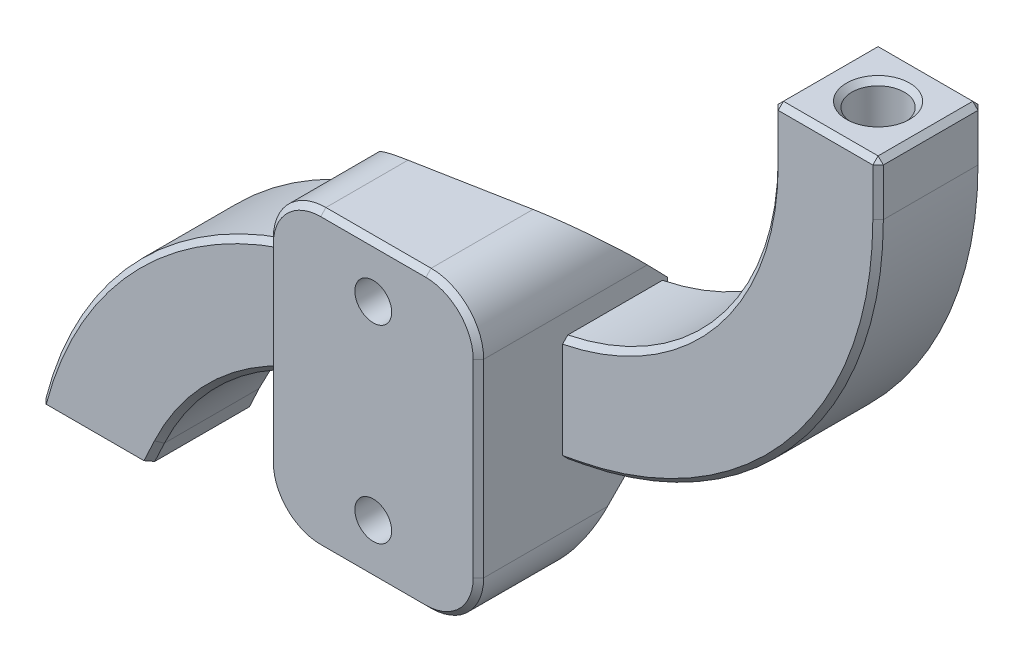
ISO-10303-21;
HEADER;
FILE_DESCRIPTION(('STEP AP214'),'2;1');
FILE_NAME('part.step','',(''),(''),'','','');
FILE_SCHEMA(('AUTOMOTIVE_DESIGN { 1 0 10303 214 1 1 1 1 }'));
ENDSEC;
DATA;
#1=APPLICATION_CONTEXT('core data for automotive mechanical design processes');
#2=APPLICATION_PROTOCOL_DEFINITION('international standard','automotive_design',2000,#1);
#3=PRODUCT_CONTEXT('',#1,'mechanical');
#4=PRODUCT('Part','Part','',(#3));
#5=PRODUCT_RELATED_PRODUCT_CATEGORY('part','',(#4));
#6=PRODUCT_DEFINITION_FORMATION('','',#4);
#7=PRODUCT_DEFINITION_CONTEXT('part definition',#1,'design');
#8=PRODUCT_DEFINITION('design','',#6,#7);
#9=PRODUCT_DEFINITION_SHAPE('','',#8);
#10=(LENGTH_UNIT() NAMED_UNIT(*) SI_UNIT(.MILLI.,.METRE.));
#11=(NAMED_UNIT(*) PLANE_ANGLE_UNIT() SI_UNIT($,.RADIAN.));
#12=(NAMED_UNIT(*) SI_UNIT($,.STERADIAN.) SOLID_ANGLE_UNIT());
#13=UNCERTAINTY_MEASURE_WITH_UNIT(LENGTH_MEASURE(1.E-05),#10,'distance_accuracy_value','');
#14=(GEOMETRIC_REPRESENTATION_CONTEXT(3) GLOBAL_UNCERTAINTY_ASSIGNED_CONTEXT((#13)) GLOBAL_UNIT_ASSIGNED_CONTEXT((#10,
#11,#12)) REPRESENTATION_CONTEXT('',''));
#15=CARTESIAN_POINT('',(0.,0.,0.));
#16=DIRECTION('',(0.,0.,1.));
#17=DIRECTION('',(1.,0.,0.));
#18=AXIS2_PLACEMENT_3D('',#15,#16,#17);
#19=CARTESIAN_POINT('',(-10.4085015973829,-13.5948580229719,-5.));
#20=DIRECTION('',(-0.188433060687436,0.982086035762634,0.));
#21=DIRECTION('',(-0.982086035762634,-0.188433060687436,0.));
#22=AXIS2_PLACEMENT_3D('',#19,#20,#21);
#23=PLANE('',#22);
#24=DIRECTION('',(0.,0.,1.));
#25=VECTOR('',#24,1.);
#26=CARTESIAN_POINT('',(-10.,-13.5164787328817,13.));
#27=LINE('',#26,#25);
#28=CARTESIAN_POINT('',(-10.,-13.5164787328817,-4.5));
#29=VERTEX_POINT('',#28);
#30=CARTESIAN_POINT('',(-10.,-13.5164787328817,4.50000000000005));
#31=VERTEX_POINT('',#30);
#32=EDGE_CURVE('E400',#29,#31,#27,.T.);
#33=ORIENTED_EDGE('',*,*,#32,.T.);
#34=DIRECTION('',(-0.982086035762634,-0.188433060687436,0.));
#35=VECTOR('',#34,1.);
#36=CARTESIAN_POINT('',(-10.4085015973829,-13.5948580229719,4.50000000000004));
#37=LINE('',#36,#35);
#38=CARTESIAN_POINT('',(-10.4085015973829,-13.5948580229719,4.50000000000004));
#39=VERTEX_POINT('',#38);
#40=EDGE_CURVE('E885',#31,#39,#37,.T.);
#41=ORIENTED_EDGE('',*,*,#40,.T.);
#42=DIRECTION('',(0.,0.,1.));
#43=VECTOR('',#42,1.);
#44=CARTESIAN_POINT('',(-10.4085015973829,-13.5948580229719,-5.));
#45=LINE('',#44,#43);
#46=CARTESIAN_POINT('',(-10.4085015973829,-13.5948580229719,-4.5));
#47=VERTEX_POINT('',#46);
#48=EDGE_CURVE('E792',#47,#39,#45,.T.);
#49=ORIENTED_EDGE('',*,*,#48,.F.);
#50=DIRECTION('',(0.982086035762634,0.188433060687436,0.));
#51=VECTOR('',#50,1.);
#52=CARTESIAN_POINT('',(-10.4085015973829,-13.5948580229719,-4.5));
#53=LINE('',#52,#51);
#54=EDGE_CURVE('E814',#47,#29,#53,.T.);
#55=ORIENTED_EDGE('',*,*,#54,.T.);
#56=EDGE_LOOP('',(#33,#41,#49,#55));
#57=FACE_BOUND('',#56,.T.);
#58=ADVANCED_FACE('F36',(#57),#23,.F.);
#59=CARTESIAN_POINT('',(0.,0.,5.));
#60=DIRECTION('',(0.,0.,1.));
#61=DIRECTION('',(1.,0.,0.));
#62=AXIS2_PLACEMENT_3D('',#59,#60,#61);
#63=PLANE('',#62);
#64=DIRECTION('',(0.,-1.,0.));
#65=VECTOR('',#64,1.);
#66=CARTESIAN_POINT('',(30.5,25.,5.));
#67=LINE('',#66,#65);
#68=CARTESIAN_POINT('',(30.5,29.5,5.));
#69=VERTEX_POINT('',#68);
#70=CARTESIAN_POINT('',(30.5,25.,5.));
#71=VERTEX_POINT('',#70);
#72=EDGE_CURVE('E828',#69,#71,#67,.T.);
#73=ORIENTED_EDGE('',*,*,#72,.T.);
#74=CARTESIAN_POINT('',(5.00000000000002,25.,5.));
#75=DIRECTION('',(0.,0.,1.));
#76=DIRECTION('',(1.,0.,0.));
#77=AXIS2_PLACEMENT_3D('',#74,#75,#76);
#78=CIRCLE('',#77,25.5);
#79=CARTESIAN_POINT('',(10.,-0.00499950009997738,5.));
#80=VERTEX_POINT('',#79);
#81=EDGE_CURVE('E835',#71,#80,#78,.F.);
#82=ORIENTED_EDGE('',*,*,#81,.T.);
#83=DIRECTION('',(0.,1.,0.));
#84=VECTOR('',#83,1.);
#85=CARTESIAN_POINT('',(10.,-20.5,5.));
#86=LINE('',#85,#84);
#87=CARTESIAN_POINT('',(10.,-9.16995403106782,5.));
#88=VERTEX_POINT('',#87);
#89=EDGE_CURVE('E380',#88,#80,#86,.T.);
#90=ORIENTED_EDGE('',*,*,#89,.F.);
#91=DIRECTION('',(0.982086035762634,0.188433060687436,0.));
#92=VECTOR('',#91,1.);
#93=CARTESIAN_POINT('',(11.5009405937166,-8.88196823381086,5.));
#94=LINE('',#93,#92);
#95=CARTESIAN_POINT('',(11.5009405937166,-8.88196823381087,5.));
#96=VERTEX_POINT('',#95);
#97=EDGE_CURVE('E826',#88,#96,#94,.T.);
#98=ORIENTED_EDGE('',*,*,#97,.T.);
#99=CARTESIAN_POINT('',(5.00000000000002,25.,5.));
#100=DIRECTION('',(0.,0.,1.));
#101=DIRECTION('',(1.,0.,0.));
#102=AXIS2_PLACEMENT_3D('',#99,#100,#101);
#103=CIRCLE('',#102,34.5);
#104=CARTESIAN_POINT('',(39.5,25.,5.));
#105=VERTEX_POINT('',#104);
#106=EDGE_CURVE('E830',#96,#105,#103,.T.);
#107=ORIENTED_EDGE('',*,*,#106,.T.);
#108=DIRECTION('',(0.,1.,0.));
#109=VECTOR('',#108,1.);
#110=CARTESIAN_POINT('',(39.5,30.,5.));
#111=LINE('',#110,#109);
#112=CARTESIAN_POINT('',(39.5,29.5,5.));
#113=VERTEX_POINT('',#112);
#114=EDGE_CURVE('E822',#105,#113,#111,.T.);
#115=ORIENTED_EDGE('',*,*,#114,.T.);
#116=DIRECTION('',(-1.,0.,0.));
#117=VECTOR('',#116,1.);
#118=CARTESIAN_POINT('',(30.,29.5,5.));
#119=LINE('',#118,#117);
#120=EDGE_CURVE('E825',#113,#69,#119,.T.);
#121=ORIENTED_EDGE('',*,*,#120,.T.);
#122=EDGE_LOOP('',(#73,#82,#90,#98,#107,#115,#121));
#123=FACE_BOUND('',#122,.T.);
#124=ADVANCED_FACE('F1064',(#123),#63,.T.);
#125=CARTESIAN_POINT('',(-5.69767508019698,-38.1470089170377,5.));
#126=DIRECTION('',(0.,0.,1.));
#127=DIRECTION('',(1.,0.,0.));
#128=AXIS2_PLACEMENT_3D('',#125,#126,#127);
#129=CIRCLE('',#128,25.5);
#130=CARTESIAN_POINT('',(-28.8085236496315,-27.3702432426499,5.));
#131=VERTEX_POINT('',#130);
#132=CARTESIAN_POINT('',(-10.5027181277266,-13.1038150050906,5.));
#133=VERTEX_POINT('',#132);
#134=EDGE_CURVE('E895',#131,#133,#129,.F.);
#135=ORIENTED_EDGE('',*,*,#134,.T.);
#136=DIRECTION('',(0.982086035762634,0.188433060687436,0.));
#137=VECTOR('',#136,1.);
#138=CARTESIAN_POINT('',(-10.0942165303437,-13.0254357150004,5.));
#139=LINE('',#138,#137);
#140=CARTESIAN_POINT('',(-10.,-13.0073583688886,5.));
#141=VERTEX_POINT('',#140);
#142=EDGE_CURVE('E897',#133,#141,#139,.T.);
#143=ORIENTED_EDGE('',*,*,#142,.T.);
#144=DIRECTION('',(0.,-1.,0.));
#145=VECTOR('',#144,1.);
#146=CARTESIAN_POINT('',(-10.,-20.5,5.));
#147=LINE('',#146,#145);
#148=CARTESIAN_POINT('',(-10.,-3.84319181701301,5.));
#149=VERTEX_POINT('',#148);
#150=EDGE_CURVE('E374',#149,#141,#147,.T.);
#151=ORIENTED_EDGE('',*,*,#150,.F.);
#152=DIRECTION('',(-0.982086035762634,-0.188433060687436,0.));
#153=VECTOR('',#152,1.);
#154=CARTESIAN_POINT('',(-12.1986156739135,-4.26504068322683,5.));
#155=LINE('',#154,#153);
#156=CARTESIAN_POINT('',(-12.1986156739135,-4.26504068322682,5.));
#157=VERTEX_POINT('',#156);
#158=EDGE_CURVE('E891',#149,#157,#155,.T.);
#159=ORIENTED_EDGE('',*,*,#158,.T.);
#160=CARTESIAN_POINT('',(-5.69767508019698,-38.1470089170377,5.));
#161=DIRECTION('',(0.,0.,1.));
#162=DIRECTION('',(1.,0.,0.));
#163=AXIS2_PLACEMENT_3D('',#160,#161,#162);
#164=CIRCLE('',#163,34.5);
#165=CARTESIAN_POINT('',(-39.0964660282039,-29.5,5.));
#166=VERTEX_POINT('',#165);
#167=EDGE_CURVE('E887',#157,#166,#164,.T.);
#168=ORIENTED_EDGE('',*,*,#167,.T.);
#169=DIRECTION('',(1.,0.,0.));
#170=VECTOR('',#169,1.);
#171=CARTESIAN_POINT('',(-29.4831104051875,-29.5,5.));
#172=LINE('',#171,#170);
#173=CARTESIAN_POINT('',(-29.8016455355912,-29.5,5.));
#174=VERTEX_POINT('',#173);
#175=EDGE_CURVE('E889',#166,#174,#172,.T.);
#176=ORIENTED_EDGE('',*,*,#175,.T.);
#177=DIRECTION('',(0.4226182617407,0.90630778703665,0.));
#178=VECTOR('',#177,1.);
#179=CARTESIAN_POINT('',(-28.8085236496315,-27.3702432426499,5.));
#180=LINE('',#179,#178);
#181=EDGE_CURVE('E893',#174,#131,#180,.T.);
#182=ORIENTED_EDGE('',*,*,#181,.T.);
#183=EDGE_LOOP('',(#135,#143,#151,#159,#168,#176,#182));
#184=FACE_BOUND('',#183,.T.);
#185=ADVANCED_FACE('F1061',(#184),#63,.T.);
#186=CARTESIAN_POINT('',(0.,0.,-5.));
#187=DIRECTION('',(0.,0.,1.));
#188=DIRECTION('',(1.,0.,0.));
#189=AXIS2_PLACEMENT_3D('',#186,#187,#188);
#190=PLANE('',#189);
#191=DIRECTION('',(-0.982086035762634,-0.188433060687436,0.));
#192=VECTOR('',#191,1.);
#193=CARTESIAN_POINT('',(2.05203874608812,-10.6949310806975,-5.));
#194=LINE('',#193,#192);
#195=CARTESIAN_POINT('',(11.5009405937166,-8.88196823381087,-5.));
#196=VERTEX_POINT('',#195);
#197=CARTESIAN_POINT('',(10.,-9.16995403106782,-5.));
#198=VERTEX_POINT('',#197);
#199=EDGE_CURVE('E868',#196,#198,#194,.T.);
#200=ORIENTED_EDGE('',*,*,#199,.T.);
#201=DIRECTION('',(0.,-1.,0.));
#202=VECTOR('',#201,1.);
#203=CARTESIAN_POINT('',(10.,0.,-5.));
#204=LINE('',#203,#202);
#205=CARTESIAN_POINT('',(10.,-9.67907439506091,-5.));
#206=VERTEX_POINT('',#205);
#207=EDGE_CURVE('E870',#198,#206,#204,.T.);
#208=ORIENTED_EDGE('',*,*,#207,.T.);
#209=DIRECTION('',(-0.982086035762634,-0.188433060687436,0.));
#210=VECTOR('',#209,1.);
#211=CARTESIAN_POINT('',(-10.4085015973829,-13.5948580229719,-5.));
#212=LINE('',#211,#210);
#213=CARTESIAN_POINT('',(-10.,-13.5164787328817,-5.));
#214=VERTEX_POINT('',#213);
#215=EDGE_CURVE('E787',#206,#214,#212,.T.);
#216=ORIENTED_EDGE('',*,*,#215,.T.);
#217=DIRECTION('',(0.,1.,0.));
#218=VECTOR('',#217,1.);
#219=CARTESIAN_POINT('',(-10.,0.,-5.));
#220=LINE('',#219,#218);
#221=CARTESIAN_POINT('',(-10.,-13.0073583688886,-5.));
#222=VERTEX_POINT('',#221);
#223=EDGE_CURVE('E62',#214,#222,#220,.T.);
#224=ORIENTED_EDGE('',*,*,#223,.T.);
#225=DIRECTION('',(-0.982086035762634,-0.188433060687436,0.));
#226=VECTOR('',#225,1.);
#227=CARTESIAN_POINT('',(2.05203874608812,-10.6949310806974,-5.));
#228=LINE('',#227,#226);
#229=CARTESIAN_POINT('',(-10.5027181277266,-13.1038150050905,-5.));
#230=VERTEX_POINT('',#229);
#231=EDGE_CURVE('E854',#222,#230,#228,.T.);
#232=ORIENTED_EDGE('',*,*,#231,.T.);
#233=CARTESIAN_POINT('',(-5.69767508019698,-38.1470089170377,-5.));
#234=DIRECTION('',(0.,0.,1.));
#235=DIRECTION('',(1.,0.,0.));
#236=AXIS2_PLACEMENT_3D('',#233,#234,#235);
#237=CIRCLE('',#236,25.5);
#238=CARTESIAN_POINT('',(-28.8085236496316,-27.3702432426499,-5.));
#239=VERTEX_POINT('',#238);
#240=EDGE_CURVE('E852',#230,#239,#237,.T.);
#241=ORIENTED_EDGE('',*,*,#240,.T.);
#242=DIRECTION('',(-0.4226182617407,-0.90630778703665,0.));
#243=VECTOR('',#242,1.);
#244=CARTESIAN_POINT('',(-13.1797314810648,6.14580972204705,-5.));
#245=LINE('',#244,#243);
#246=CARTESIAN_POINT('',(-29.8016455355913,-29.5,-5.));
#247=VERTEX_POINT('',#246);
#248=EDGE_CURVE('E849',#239,#247,#245,.T.);
#249=ORIENTED_EDGE('',*,*,#248,.T.);
#250=DIRECTION('',(-1.,0.,0.));
#251=VECTOR('',#250,1.);
#252=CARTESIAN_POINT('',(0.,-29.5,-5.));
#253=LINE('',#252,#251);
#254=CARTESIAN_POINT('',(-39.0964660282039,-29.5,-5.));
#255=VERTEX_POINT('',#254);
#256=EDGE_CURVE('E845',#247,#255,#253,.T.);
#257=ORIENTED_EDGE('',*,*,#256,.T.);
#258=CARTESIAN_POINT('',(-5.69767508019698,-38.1470089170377,-5.));
#259=DIRECTION('',(0.,0.,1.));
#260=DIRECTION('',(1.,0.,0.));
#261=AXIS2_PLACEMENT_3D('',#258,#259,#260);
#262=CIRCLE('',#261,34.5);
#263=CARTESIAN_POINT('',(-12.1986156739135,-4.26504068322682,-5.));
#264=VERTEX_POINT('',#263);
#265=EDGE_CURVE('E843',#255,#264,#262,.F.);
#266=ORIENTED_EDGE('',*,*,#265,.T.);
#267=DIRECTION('',(0.982086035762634,0.188433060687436,0.));
#268=VECTOR('',#267,1.);
#269=CARTESIAN_POINT('',(0.356141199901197,-1.85615675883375,-5.));
#270=LINE('',#269,#268);
#271=CARTESIAN_POINT('',(-10.,-3.843191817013,-5.));
#272=VERTEX_POINT('',#271);
#273=EDGE_CURVE('E847',#264,#272,#270,.T.);
#274=ORIENTED_EDGE('',*,*,#273,.T.);
#275=DIRECTION('',(0.,1.,0.));
#276=VECTOR('',#275,1.);
#277=CARTESIAN_POINT('',(-10.,0.,-5.));
#278=LINE('',#277,#276);
#279=CARTESIAN_POINT('',(-10.,-3.33407145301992,-5.));
#280=VERTEX_POINT('',#279);
#281=EDGE_CURVE('E346',#272,#280,#278,.T.);
#282=ORIENTED_EDGE('',*,*,#281,.T.);
#283=DIRECTION('',(0.982086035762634,0.188433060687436,0.));
#284=VECTOR('',#283,1.);
#285=CARTESIAN_POINT('',(-12.2928322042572,-3.77399766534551,-5.));
#286=LINE('',#285,#284);
#287=CARTESIAN_POINT('',(9.71082651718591,0.447849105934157,-5.));
#288=VERTEX_POINT('',#287);
#289=EDGE_CURVE('E338',#280,#288,#286,.T.);
#290=ORIENTED_EDGE('',*,*,#289,.T.);
#291=CARTESIAN_POINT('',(5.00000000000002,25.,-5.));
#292=DIRECTION('',(0.,0.,1.));
#293=DIRECTION('',(1.,0.,0.));
#294=AXIS2_PLACEMENT_3D('',#291,#292,#293);
#295=CIRCLE('',#294,25.);
#296=CARTESIAN_POINT('',(10.,0.505102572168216,-5.));
#297=VERTEX_POINT('',#296);
#298=EDGE_CURVE('E343',#288,#297,#295,.T.);
#299=ORIENTED_EDGE('',*,*,#298,.T.);
#300=DIRECTION('',(0.,-1.,0.));
#301=VECTOR('',#300,1.);
#302=CARTESIAN_POINT('',(10.,0.,-5.));
#303=LINE('',#302,#301);
#304=CARTESIAN_POINT('',(10.,-0.00499950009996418,-5.));
#305=VERTEX_POINT('',#304);
#306=EDGE_CURVE('E54',#297,#305,#303,.T.);
#307=ORIENTED_EDGE('',*,*,#306,.T.);
#308=CARTESIAN_POINT('',(5.00000000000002,25.,-5.));
#309=DIRECTION('',(0.,0.,1.));
#310=DIRECTION('',(1.,0.,0.));
#311=AXIS2_PLACEMENT_3D('',#308,#309,#310);
#312=CIRCLE('',#311,25.5);
#313=CARTESIAN_POINT('',(30.5,25.,-5.));
#314=VERTEX_POINT('',#313);
#315=EDGE_CURVE('E858',#305,#314,#312,.T.);
#316=ORIENTED_EDGE('',*,*,#315,.T.);
#317=DIRECTION('',(0.,1.,0.));
#318=VECTOR('',#317,1.);
#319=CARTESIAN_POINT('',(30.5,0.,-5.));
#320=LINE('',#319,#318);
#321=CARTESIAN_POINT('',(30.5,29.5,-5.));
#322=VERTEX_POINT('',#321);
#323=EDGE_CURVE('E860',#314,#322,#320,.T.);
#324=ORIENTED_EDGE('',*,*,#323,.T.);
#325=DIRECTION('',(1.,0.,0.));
#326=VECTOR('',#325,1.);
#327=CARTESIAN_POINT('',(0.,29.5,-5.));
#328=LINE('',#327,#326);
#329=CARTESIAN_POINT('',(39.5,29.5,-5.));
#330=VERTEX_POINT('',#329);
#331=EDGE_CURVE('E862',#322,#330,#328,.T.);
#332=ORIENTED_EDGE('',*,*,#331,.T.);
#333=DIRECTION('',(0.,-1.,0.));
#334=VECTOR('',#333,1.);
#335=CARTESIAN_POINT('',(39.5,0.,-5.));
#336=LINE('',#335,#334);
#337=CARTESIAN_POINT('',(39.5,25.,-5.));
#338=VERTEX_POINT('',#337);
#339=EDGE_CURVE('E864',#330,#338,#336,.T.);
#340=ORIENTED_EDGE('',*,*,#339,.T.);
#341=CARTESIAN_POINT('',(5.00000000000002,25.,-5.));
#342=DIRECTION('',(0.,0.,1.));
#343=DIRECTION('',(1.,0.,0.));
#344=AXIS2_PLACEMENT_3D('',#341,#342,#343);
#345=CIRCLE('',#344,34.5);
#346=EDGE_CURVE('E866',#338,#196,#345,.F.);
#347=ORIENTED_EDGE('',*,*,#346,.T.);
#348=EDGE_LOOP('',(#200,#208,#216,#224,#232,#241,#249,#257,#266,#274,#282,#290,#299,#307,#316,
#324,#332,#340,#347));
#349=FACE_BOUND('',#348,.T.);
#350=ADVANCED_FACE('F341',(#349),#190,.F.);
#351=CARTESIAN_POINT('',(40.,-30.,5.));
#352=DIRECTION('',(0.,1.,0.));
#353=DIRECTION('',(-1.,0.,0.));
#354=AXIS2_PLACEMENT_3D('',#351,#352,#353);
#355=PLANE('',#354);
#356=CARTESIAN_POINT('',(-31.7415552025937,-30.,0.));
#357=CARTESIAN_POINT('',(-31.7415552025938,-30.,0.0941248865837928));
#358=CARTESIAN_POINT('',(-31.7466572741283,-30.,0.188249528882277));
#359=CARTESIAN_POINT('',(-31.7670164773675,-30.,0.375592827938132));
#360=CARTESIAN_POINT('',(-31.7822735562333,-30.,0.468810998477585));
#361=CARTESIAN_POINT('',(-31.8227958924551,-30.,0.653443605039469));
#362=CARTESIAN_POINT('',(-31.8480610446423,-30.,0.744857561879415));
#363=CARTESIAN_POINT('',(-31.9083562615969,-30.,0.925001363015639));
#364=CARTESIAN_POINT('',(-31.9433861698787,-30.,1.0137307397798));
#365=CARTESIAN_POINT('',(-32.0228735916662,-30.,1.18765085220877));
#366=CARTESIAN_POINT('',(-32.0673308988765,-30.,1.27284113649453));
#367=CARTESIAN_POINT('',(-32.1652450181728,-30.,1.43886261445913));
#368=CARTESIAN_POINT('',(-32.2187015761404,-30.,1.51969337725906));
#369=CARTESIAN_POINT('',(-32.3340994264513,-30.,1.67621734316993));
#370=CARTESIAN_POINT('',(-32.3960404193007,-30.,1.75191014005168));
#371=CARTESIAN_POINT('',(-32.5278106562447,-30.,1.89742918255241));
#372=CARTESIAN_POINT('',(-32.5976395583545,-30.,1.96725505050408));
#373=CARTESIAN_POINT('',(-32.7445131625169,-30.,2.10036774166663));
#374=CARTESIAN_POINT('',(-32.8215574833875,-30.,2.1636542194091));
#375=CARTESIAN_POINT('',(-32.9821199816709,-30.,2.28307861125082));
#376=CARTESIAN_POINT('',(-33.0656377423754,-30.,2.33921621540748));
#377=CARTESIAN_POINT('',(-33.2383428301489,-30.,2.44380218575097));
#378=CARTESIAN_POINT('',(-33.3275297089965,-30.,2.4922502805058));
#379=CARTESIAN_POINT('',(-33.5107141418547,-30.,2.5809906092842));
#380=CARTESIAN_POINT('',(-33.6047112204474,-30.,2.62128261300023));
#381=CARTESIAN_POINT('',(-33.7966108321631,-30.,2.69332268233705));
#382=CARTESIAN_POINT('',(-33.8945128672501,-30.,2.72507056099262));
#383=CARTESIAN_POINT('',(-34.0932795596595,-30.,2.77971658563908));
#384=CARTESIAN_POINT('',(-34.1941437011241,-30.,2.80261458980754));
#385=CARTESIAN_POINT('',(-34.3978632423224,-30.,2.83934029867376));
#386=CARTESIAN_POINT('',(-34.5007181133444,-30.,2.85316790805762));
#387=CARTESIAN_POINT('',(-34.7074285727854,-30.,2.87161961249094));
#388=CARTESIAN_POINT('',(-34.8112836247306,-30.,2.87624365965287));
#389=CARTESIAN_POINT('',(-35.0189942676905,-30.,2.87624365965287));
#390=CARTESIAN_POINT('',(-35.1228493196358,-30.,2.87161961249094));
#391=CARTESIAN_POINT('',(-35.3295597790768,-30.,2.85316790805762));
#392=CARTESIAN_POINT('',(-35.4324146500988,-30.,2.83934029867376));
#393=CARTESIAN_POINT('',(-35.6361341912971,-30.,2.80261458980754));
#394=CARTESIAN_POINT('',(-35.7369983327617,-30.,2.77971658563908));
#395=CARTESIAN_POINT('',(-35.9357650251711,-30.,2.72507056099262));
#396=CARTESIAN_POINT('',(-36.0336670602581,-30.,2.69332268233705));
#397=CARTESIAN_POINT('',(-36.2255666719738,-30.,2.62128261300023));
#398=CARTESIAN_POINT('',(-36.3195637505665,-30.,2.5809906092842));
#399=CARTESIAN_POINT('',(-36.5027481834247,-30.,2.4922502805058));
#400=CARTESIAN_POINT('',(-36.5919350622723,-30.,2.44380218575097));
#401=CARTESIAN_POINT('',(-36.7646401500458,-30.,2.33921621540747));
#402=CARTESIAN_POINT('',(-36.8481579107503,-30.,2.28307861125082));
#403=CARTESIAN_POINT('',(-37.0087204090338,-30.,2.1636542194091));
#404=CARTESIAN_POINT('',(-37.0857647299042,-30.,2.10036774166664));
#405=CARTESIAN_POINT('',(-37.2326383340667,-30.,1.96725505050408));
#406=CARTESIAN_POINT('',(-37.3024672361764,-30.,1.89742918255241));
#407=CARTESIAN_POINT('',(-37.4342374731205,-30.,1.75191014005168));
#408=CARTESIAN_POINT('',(-37.4961784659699,-30.,1.67621734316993));
#409=CARTESIAN_POINT('',(-37.6115763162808,-30.,1.51969337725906));
#410=CARTESIAN_POINT('',(-37.6650328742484,-30.,1.43886261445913));
#411=CARTESIAN_POINT('',(-37.7629469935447,-30.,1.27284113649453));
#412=CARTESIAN_POINT('',(-37.807404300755,-30.,1.18765085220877));
#413=CARTESIAN_POINT('',(-37.8868917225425,-30.,1.0137307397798));
#414=CARTESIAN_POINT('',(-37.9219216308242,-30.,0.925001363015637));
#415=CARTESIAN_POINT('',(-37.9822168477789,-30.,0.744857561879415));
#416=CARTESIAN_POINT('',(-38.0074819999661,-30.,0.653443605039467));
#417=CARTESIAN_POINT('',(-38.0480043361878,-30.,0.468810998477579));
#418=CARTESIAN_POINT('',(-38.0632614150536,-30.,0.375592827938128));
#419=CARTESIAN_POINT('',(-38.0836206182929,-30.,0.188249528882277));
#420=CARTESIAN_POINT('',(-38.0887226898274,-30.,0.0941248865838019));
#421=CARTESIAN_POINT('',(-38.0887226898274,-30.,-0.0941248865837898));
#422=CARTESIAN_POINT('',(-38.0836206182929,-30.,-0.188249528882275));
#423=CARTESIAN_POINT('',(-38.0632614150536,-30.,-0.375592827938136));
#424=CARTESIAN_POINT('',(-38.0480043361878,-30.,-0.468810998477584));
#425=CARTESIAN_POINT('',(-38.0074819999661,-30.,-0.653443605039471));
#426=CARTESIAN_POINT('',(-37.9822168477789,-30.,-0.744857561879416));
#427=CARTESIAN_POINT('',(-37.9219216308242,-30.,-0.925001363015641));
#428=CARTESIAN_POINT('',(-37.8868917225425,-30.,-1.01373073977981));
#429=CARTESIAN_POINT('',(-37.8074043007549,-30.,-1.18765085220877));
#430=CARTESIAN_POINT('',(-37.7629469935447,-30.,-1.27284113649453));
#431=CARTESIAN_POINT('',(-37.6650328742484,-30.,-1.43886261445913));
#432=CARTESIAN_POINT('',(-37.6115763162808,-30.,-1.51969337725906));
#433=CARTESIAN_POINT('',(-37.4961784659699,-30.,-1.67621734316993));
#434=CARTESIAN_POINT('',(-37.4342374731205,-30.,-1.75191014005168));
#435=CARTESIAN_POINT('',(-37.3024672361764,-30.,-1.89742918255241));
#436=CARTESIAN_POINT('',(-37.2326383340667,-30.,-1.96725505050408));
#437=CARTESIAN_POINT('',(-37.0857647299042,-30.,-2.10036774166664));
#438=CARTESIAN_POINT('',(-37.0087204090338,-30.,-2.16365421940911));
#439=CARTESIAN_POINT('',(-36.8481579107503,-30.,-2.28307861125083));
#440=CARTESIAN_POINT('',(-36.7646401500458,-30.,-2.33921621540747));
#441=CARTESIAN_POINT('',(-36.5919350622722,-30.,-2.44380218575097));
#442=CARTESIAN_POINT('',(-36.5027481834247,-30.,-2.4922502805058));
#443=CARTESIAN_POINT('',(-36.3195637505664,-30.,-2.58099060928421));
#444=CARTESIAN_POINT('',(-36.2255666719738,-30.,-2.62128261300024));
#445=CARTESIAN_POINT('',(-36.0336670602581,-30.,-2.69332268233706));
#446=CARTESIAN_POINT('',(-35.9357650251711,-30.,-2.72507056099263));
#447=CARTESIAN_POINT('',(-35.7369983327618,-30.,-2.77971658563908));
#448=CARTESIAN_POINT('',(-35.6361341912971,-30.,-2.80261458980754));
#449=CARTESIAN_POINT('',(-35.4324146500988,-30.,-2.83934029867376));
#450=CARTESIAN_POINT('',(-35.3295597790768,-30.,-2.85316790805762));
#451=CARTESIAN_POINT('',(-35.1228493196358,-30.,-2.87161961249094));
#452=CARTESIAN_POINT('',(-35.0189942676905,-30.,-2.87624365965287));
#453=CARTESIAN_POINT('',(-34.8112836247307,-30.,-2.87624365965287));
#454=CARTESIAN_POINT('',(-34.7074285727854,-30.,-2.87161961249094));
#455=CARTESIAN_POINT('',(-34.5007181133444,-30.,-2.85316790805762));
#456=CARTESIAN_POINT('',(-34.3978632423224,-30.,-2.83934029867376));
#457=CARTESIAN_POINT('',(-34.1941437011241,-30.,-2.80261458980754));
#458=CARTESIAN_POINT('',(-34.0932795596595,-30.,-2.77971658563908));
#459=CARTESIAN_POINT('',(-33.8945128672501,-30.,-2.72507056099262));
#460=CARTESIAN_POINT('',(-33.7966108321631,-30.,-2.69332268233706));
#461=CARTESIAN_POINT('',(-33.6047112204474,-30.,-2.62128261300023));
#462=CARTESIAN_POINT('',(-33.5107141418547,-30.,-2.5809906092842));
#463=CARTESIAN_POINT('',(-33.3275297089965,-30.,-2.49225028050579));
#464=CARTESIAN_POINT('',(-33.238342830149,-30.,-2.44380218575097));
#465=CARTESIAN_POINT('',(-33.0656377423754,-30.,-2.33921621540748));
#466=CARTESIAN_POINT('',(-32.9821199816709,-30.,-2.28307861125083));
#467=CARTESIAN_POINT('',(-32.8215574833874,-30.,-2.16365421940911));
#468=CARTESIAN_POINT('',(-32.7445131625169,-30.,-2.10036774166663));
#469=CARTESIAN_POINT('',(-32.5976395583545,-30.,-1.96725505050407));
#470=CARTESIAN_POINT('',(-32.5278106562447,-30.,-1.89742918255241));
#471=CARTESIAN_POINT('',(-32.3960404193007,-30.,-1.75191014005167));
#472=CARTESIAN_POINT('',(-32.3340994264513,-30.,-1.67621734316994));
#473=CARTESIAN_POINT('',(-32.2187015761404,-30.,-1.51969337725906));
#474=CARTESIAN_POINT('',(-32.1652450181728,-30.,-1.43886261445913));
#475=CARTESIAN_POINT('',(-32.0673308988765,-30.,-1.27284113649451));
#476=CARTESIAN_POINT('',(-32.0228735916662,-30.,-1.18765085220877));
#477=CARTESIAN_POINT('',(-31.9433861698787,-30.,-1.0137307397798));
#478=CARTESIAN_POINT('',(-31.9083562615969,-30.,-0.925001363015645));
#479=CARTESIAN_POINT('',(-31.8480610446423,-30.,-0.744857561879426));
#480=CARTESIAN_POINT('',(-31.8227958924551,-30.,-0.653443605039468));
#481=CARTESIAN_POINT('',(-31.7822735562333,-30.,-0.468810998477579));
#482=CARTESIAN_POINT('',(-31.7670164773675,-30.,-0.375592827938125));
#483=CARTESIAN_POINT('',(-31.7466572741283,-30.,-0.188249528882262));
#484=CARTESIAN_POINT('',(-31.7415552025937,-30.,-0.0941248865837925));
#485=CARTESIAN_POINT('',(-31.7415552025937,-30.,0.));
#486=B_SPLINE_CURVE_WITH_KNOTS('',3,(#356,#357,#358,#359,#360,#361,#362,#363,#364,#365,#366,
#367,#368,#369,#370,#371,#372,#373,#374,#375,#376,#377,#378,#379,#380,#381,#382,#383,#384,#385,
#386,#387,#388,#389,#390,#391,#392,#393,#394,#395,#396,#397,#398,#399,#400,#401,#402,#403,#404,
#405,#406,#407,#408,#409,#410,#411,#412,#413,#414,#415,#416,#417,#418,#419,#420,#421,#422,#423,
#424,#425,#426,#427,#428,#429,#430,#431,#432,#433,#434,#435,#436,#437,#438,#439,#440,#441,#442,
#443,#444,#445,#446,#447,#448,#449,#450,#451,#452,#453,#454,#455,#456,#457,#458,#459,#460,#461,
#462,#463,#464,#465,#466,#467,#468,#469,#470,#471,#472,#473,#474,#475,#476,#477,#478,#479,#480,
#481,#482,#483,#484,#485),.UNSPECIFIED.,.T.,.F.,(4,2,2,2,2,2,2,2,2,2,2,2,2,2,2,2,2,2,2,2,2,2,2,
2,2,2,2,2,2,2,2,2,2,2,2,2,2,2,2,2,2,2,2,2,2,2,2,2,2,2,2,2,2,2,2,2,2,2,2,2,2,2,2,2,4),
(-6.28318530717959,-6.18501053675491,-6.08683576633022,-5.98866099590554,-5.89048622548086,
-5.79231145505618,-5.6941366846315,-5.59596191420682,-5.49778714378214,-5.39961237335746,
-5.30143760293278,-5.20326283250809,-5.10508806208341,-5.00691329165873,-4.90873852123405,
-4.81056375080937,-4.71238898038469,-4.61421420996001,-4.51603943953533,-4.41786466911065,
-4.31968989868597,-4.22151512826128,-4.1233403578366,-4.02516558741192,-3.92699081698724,
-3.82881604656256,-3.73064127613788,-3.6324665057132,-3.53429173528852,-3.43611696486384,
-3.33794219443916,-3.23976742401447,-3.14159265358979,-3.04341788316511,-2.94524311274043,
-2.84706834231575,-2.74889357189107,-2.65071880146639,-2.55254403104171,-2.45436926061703,
-2.35619449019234,-2.25801971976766,-2.15984494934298,-2.0616701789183,-1.96349540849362,
-1.86532063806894,-1.76714586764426,-1.66897109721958,-1.5707963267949,-1.47262155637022,
-1.37444678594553,-1.27627201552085,-1.17809724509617,-1.07992247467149,-0.981747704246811,
-0.88357293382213,-0.785398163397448,-0.687223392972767,-0.589048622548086,-0.490873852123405,
-0.392699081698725,-0.294524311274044,-0.196349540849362,-0.0981747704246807,0.),.UNSPECIFIED.);
#487=CARTESIAN_POINT('',(-31.7415552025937,-30.,0.));
#488=VERTEX_POINT('',#487);
#489=EDGE_CURVE('E988',#488,#488,#486,.F.);
#490=ORIENTED_EDGE('',*,*,#489,.T.);
#491=EDGE_LOOP('',(#490));
#492=FACE_BOUND('',#491,.T.);
#493=DIRECTION('',(0.,0.,1.));
#494=VECTOR('',#493,1.);
#495=CARTESIAN_POINT('',(-30.5168313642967,-30.,5.));
#496=LINE('',#495,#494);
#497=CARTESIAN_POINT('',(-30.5168313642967,-30.,-4.5));
#498=VERTEX_POINT('',#497);
#499=CARTESIAN_POINT('',(-30.5168313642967,-30.,4.50000000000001));
#500=VERTEX_POINT('',#499);
#501=EDGE_CURVE('E1094',#498,#500,#496,.T.);
#502=ORIENTED_EDGE('',*,*,#501,.T.);
#503=DIRECTION('',(-1.,0.,0.));
#504=VECTOR('',#503,1.);
#505=CARTESIAN_POINT('',(-39.7362744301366,-30.,4.50000000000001));
#506=LINE('',#505,#504);
#507=CARTESIAN_POINT('',(-39.3214410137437,-30.,4.50000000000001));
#508=VERTEX_POINT('',#507);
#509=EDGE_CURVE('E1091',#500,#508,#506,.T.);
#510=ORIENTED_EDGE('',*,*,#509,.T.);
#511=DIRECTION('',(0.,0.,-1.));
#512=VECTOR('',#511,1.);
#513=CARTESIAN_POINT('',(-39.3214410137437,-30.,5.));
#514=LINE('',#513,#512);
#515=CARTESIAN_POINT('',(-39.3214410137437,-30.,-4.5));
#516=VERTEX_POINT('',#515);
#517=EDGE_CURVE('E969',#508,#516,#514,.T.);
#518=ORIENTED_EDGE('',*,*,#517,.T.);
#519=DIRECTION('',(1.,0.,0.));
#520=VECTOR('',#519,1.);
#521=CARTESIAN_POINT('',(40.,-30.,-4.5));
#522=LINE('',#521,#520);
#523=EDGE_CURVE('E1096',#516,#498,#522,.T.);
#524=ORIENTED_EDGE('',*,*,#523,.T.);
#525=EDGE_LOOP('',(#502,#510,#518,#524));
#526=FACE_BOUND('',#525,.T.);
#527=ADVANCED_FACE('F1068',(#492,#526),#355,.F.);
#528=CARTESIAN_POINT('',(40.,-30.,5.));
#529=DIRECTION('',(-1.,0.,0.));
#530=DIRECTION('',(0.,0.,1.));
#531=AXIS2_PLACEMENT_3D('',#528,#529,#530);
#532=PLANE('',#531);
#533=DIRECTION('',(0.,0.,1.));
#534=VECTOR('',#533,1.);
#535=CARTESIAN_POINT('',(40.,29.5,5.));
#536=LINE('',#535,#534);
#537=CARTESIAN_POINT('',(40.,29.5,-4.5));
#538=VERTEX_POINT('',#537);
#539=CARTESIAN_POINT('',(40.,29.5,4.49999999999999));
#540=VERTEX_POINT('',#539);
#541=EDGE_CURVE('E1227',#538,#540,#536,.T.);
#542=ORIENTED_EDGE('',*,*,#541,.T.);
#543=DIRECTION('',(0.,-1.,0.));
#544=VECTOR('',#543,1.);
#545=CARTESIAN_POINT('',(40.,25.,4.49999999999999));
#546=LINE('',#545,#544);
#547=CARTESIAN_POINT('',(40.,25.,4.49999999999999));
#548=VERTEX_POINT('',#547);
#549=EDGE_CURVE('E820',#540,#548,#546,.T.);
#550=ORIENTED_EDGE('',*,*,#549,.T.);
#551=DIRECTION('',(0.,0.,1.));
#552=VECTOR('',#551,1.);
#553=CARTESIAN_POINT('',(40.,25.,-5.));
#554=LINE('',#553,#552);
#555=CARTESIAN_POINT('',(40.,25.,-4.5));
#556=VERTEX_POINT('',#555);
#557=EDGE_CURVE('E789',#556,#548,#554,.T.);
#558=ORIENTED_EDGE('',*,*,#557,.F.);
#559=DIRECTION('',(0.,1.,0.));
#560=VECTOR('',#559,1.);
#561=CARTESIAN_POINT('',(40.,-30.,-4.5));
#562=LINE('',#561,#560);
#563=EDGE_CURVE('E1225',#556,#538,#562,.T.);
#564=ORIENTED_EDGE('',*,*,#563,.T.);
#565=EDGE_LOOP('',(#542,#550,#558,#564));
#566=FACE_BOUND('',#565,.T.);
#567=ADVANCED_FACE('F1071',(#566),#532,.F.);
#568=CARTESIAN_POINT('',(40.,30.,5.));
#569=DIRECTION('',(0.,-1.,0.));
#570=DIRECTION('',(1.,0.,0.));
#571=AXIS2_PLACEMENT_3D('',#568,#569,#570);
#572=PLANE('',#571);
#573=DIRECTION('',(1.,0.,0.));
#574=VECTOR('',#573,1.);
#575=CARTESIAN_POINT('',(40.,30.,4.5));
#576=LINE('',#575,#574);
#577=CARTESIAN_POINT('',(30.5,30.,4.5));
#578=VERTEX_POINT('',#577);
#579=CARTESIAN_POINT('',(39.5,30.,4.5));
#580=VERTEX_POINT('',#579);
#581=EDGE_CURVE('E1219',#578,#580,#576,.T.);
#582=ORIENTED_EDGE('',*,*,#581,.T.);
#583=DIRECTION('',(0.,0.,-1.));
#584=VECTOR('',#583,1.);
#585=CARTESIAN_POINT('',(39.5,30.,5.));
#586=LINE('',#585,#584);
#587=CARTESIAN_POINT('',(39.5,30.,-4.5));
#588=VERTEX_POINT('',#587);
#589=EDGE_CURVE('E1223',#580,#588,#586,.T.);
#590=ORIENTED_EDGE('',*,*,#589,.T.);
#591=DIRECTION('',(-1.,0.,0.));
#592=VECTOR('',#591,1.);
#593=CARTESIAN_POINT('',(40.,30.,-4.5));
#594=LINE('',#593,#592);
#595=CARTESIAN_POINT('',(30.5,30.,-4.5));
#596=VERTEX_POINT('',#595);
#597=EDGE_CURVE('E1212',#588,#596,#594,.T.);
#598=ORIENTED_EDGE('',*,*,#597,.T.);
#599=DIRECTION('',(0.,0.,1.));
#600=VECTOR('',#599,1.);
#601=CARTESIAN_POINT('',(30.5,30.,5.));
#602=LINE('',#601,#600);
#603=EDGE_CURVE('E1215',#596,#578,#602,.T.);
#604=ORIENTED_EDGE('',*,*,#603,.T.);
#605=EDGE_LOOP('',(#582,#590,#598,#604));
#606=FACE_BOUND('',#605,.T.);
#607=CARTESIAN_POINT('',(35.,30.,0.));
#608=DIRECTION('',(0.,-1.,0.));
#609=DIRECTION('',(1.,0.,0.));
#610=AXIS2_PLACEMENT_3D('',#607,#608,#609);
#611=CIRCLE('',#610,3.);
#612=CARTESIAN_POINT('',(38.,30.,0.));
#613=VERTEX_POINT('',#612);
#614=EDGE_CURVE('E1005',#613,#613,#611,.T.);
#615=ORIENTED_EDGE('',*,*,#614,.T.);
#616=EDGE_LOOP('',(#615));
#617=FACE_BOUND('',#616,.T.);
#618=ADVANCED_FACE('F1060',(#606,#617),#572,.F.);
#619=CARTESIAN_POINT('',(-5.69767508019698,-38.1470089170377,-5.));
#620=DIRECTION('',(0.,0.,1.));
#621=DIRECTION('',(1.,0.,0.));
#622=AXIS2_PLACEMENT_3D('',#619,#620,#621);
#623=CYLINDRICAL_SURFACE('',#622,35.);
#624=DIRECTION('',(0.,0.,1.));
#625=VECTOR('',#624,1.);
#626=CARTESIAN_POINT('',(-39.6172835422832,-29.5179787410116,-5.));
#627=LINE('',#626,#625);
#628=CARTESIAN_POINT('',(-39.6172835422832,-29.5179787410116,-4.5));
#629=VERTEX_POINT('',#628);
#630=CARTESIAN_POINT('',(-39.6172835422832,-29.5179787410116,4.50000000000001));
#631=VERTEX_POINT('',#630);
#632=EDGE_CURVE('E967',#629,#631,#627,.T.);
#633=ORIENTED_EDGE('',*,*,#632,.T.);
#634=CARTESIAN_POINT('',(-5.69767508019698,-38.1470089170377,4.50000000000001));
#635=DIRECTION('',(0.,0.,1.));
#636=DIRECTION('',(1.,0.,0.));
#637=AXIS2_PLACEMENT_3D('',#634,#635,#636);
#638=CIRCLE('',#637,35.);
#639=CARTESIAN_POINT('',(-12.2928322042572,-3.77399766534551,4.50000000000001));
#640=VERTEX_POINT('',#639);
#641=EDGE_CURVE('E976',#631,#640,#638,.F.);
#642=ORIENTED_EDGE('',*,*,#641,.T.);
#643=DIRECTION('',(0.,0.,1.));
#644=VECTOR('',#643,1.);
#645=CARTESIAN_POINT('',(-12.2928322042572,-3.77399766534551,-5.));
#646=LINE('',#645,#644);
#647=CARTESIAN_POINT('',(-12.2928322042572,-3.77399766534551,-4.5));
#648=VERTEX_POINT('',#647);
#649=EDGE_CURVE('E366',#648,#640,#646,.T.);
#650=ORIENTED_EDGE('',*,*,#649,.F.);
#651=CARTESIAN_POINT('',(-5.69767508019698,-38.1470089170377,-4.5));
#652=DIRECTION('',(0.,0.,1.));
#653=DIRECTION('',(1.,0.,0.));
#654=AXIS2_PLACEMENT_3D('',#651,#652,#653);
#655=CIRCLE('',#654,35.);
#656=EDGE_CURVE('E985',#648,#629,#655,.T.);
#657=ORIENTED_EDGE('',*,*,#656,.T.);
#658=EDGE_LOOP('',(#633,#642,#650,#657));
#659=FACE_BOUND('',#658,.T.);
#660=ADVANCED_FACE('F983',(#659),#623,.T.);
#661=CARTESIAN_POINT('',(30.,25.,-5.));
#662=DIRECTION('',(1.,0.,0.));
#663=DIRECTION('',(0.,0.,-1.));
#664=AXIS2_PLACEMENT_3D('',#661,#662,#663);
#665=PLANE('',#664);
#666=DIRECTION('',(0.,0.,1.));
#667=VECTOR('',#666,1.);
#668=CARTESIAN_POINT('',(30.,25.,-5.));
#669=LINE('',#668,#667);
#670=CARTESIAN_POINT('',(30.,25.,-4.50000000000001));
#671=VERTEX_POINT('',#670);
#672=CARTESIAN_POINT('',(30.,25.,4.50000000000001));
#673=VERTEX_POINT('',#672);
#674=EDGE_CURVE('E369',#671,#673,#669,.T.);
#675=ORIENTED_EDGE('',*,*,#674,.T.);
#676=DIRECTION('',(0.,1.,0.));
#677=VECTOR('',#676,1.);
#678=CARTESIAN_POINT('',(30.,30.,4.50000000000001));
#679=LINE('',#678,#677);
#680=CARTESIAN_POINT('',(30.,29.5,4.50000000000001));
#681=VERTEX_POINT('',#680);
#682=EDGE_CURVE('E841',#673,#681,#679,.T.);
#683=ORIENTED_EDGE('',*,*,#682,.T.);
#684=DIRECTION('',(0.,0.,-1.));
#685=VECTOR('',#684,1.);
#686=CARTESIAN_POINT('',(30.,29.5,-5.));
#687=LINE('',#686,#685);
#688=CARTESIAN_POINT('',(30.,29.5,-4.50000000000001));
#689=VERTEX_POINT('',#688);
#690=EDGE_CURVE('E839',#681,#689,#687,.T.);
#691=ORIENTED_EDGE('',*,*,#690,.T.);
#692=DIRECTION('',(0.,-1.,0.));
#693=VECTOR('',#692,1.);
#694=CARTESIAN_POINT('',(30.,25.,-4.50000000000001));
#695=LINE('',#694,#693);
#696=EDGE_CURVE('E837',#689,#671,#695,.T.);
#697=ORIENTED_EDGE('',*,*,#696,.T.);
#698=EDGE_LOOP('',(#675,#683,#691,#697));
#699=FACE_BOUND('',#698,.T.);
#700=ADVANCED_FACE('F1047',(#699),#665,.F.);
#701=CARTESIAN_POINT('',(5.00000000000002,25.,-5.));
#702=DIRECTION('',(0.,0.,1.));
#703=DIRECTION('',(1.,0.,0.));
#704=AXIS2_PLACEMENT_3D('',#701,#702,#703);
#705=CYLINDRICAL_SURFACE('',#704,25.);
#706=DIRECTION('',(0.,0.,1.));
#707=VECTOR('',#706,1.);
#708=CARTESIAN_POINT('',(10.,0.505102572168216,-5.00000000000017));
#709=LINE('',#708,#707);
#710=CARTESIAN_POINT('',(10.,0.505102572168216,-4.50000000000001));
#711=VERTEX_POINT('',#710);
#712=CARTESIAN_POINT('',(10.,0.505102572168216,4.50000000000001));
#713=VERTEX_POINT('',#712);
#714=EDGE_CURVE('E403',#711,#713,#709,.T.);
#715=ORIENTED_EDGE('',*,*,#714,.T.);
#716=CARTESIAN_POINT('',(5.00000000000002,25.,4.50000000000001));
#717=DIRECTION('',(0.,0.,1.));
#718=DIRECTION('',(1.,0.,0.));
#719=AXIS2_PLACEMENT_3D('',#716,#717,#718);
#720=CIRCLE('',#719,25.);
#721=EDGE_CURVE('E877',#713,#673,#720,.T.);
#722=ORIENTED_EDGE('',*,*,#721,.T.);
#723=ORIENTED_EDGE('',*,*,#674,.F.);
#724=CARTESIAN_POINT('',(5.00000000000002,25.,-4.50000000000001));
#725=DIRECTION('',(0.,0.,1.));
#726=DIRECTION('',(1.,0.,0.));
#727=AXIS2_PLACEMENT_3D('',#724,#725,#726);
#728=CIRCLE('',#727,25.);
#729=EDGE_CURVE('E875',#671,#711,#728,.F.);
#730=ORIENTED_EDGE('',*,*,#729,.T.);
#731=EDGE_LOOP('',(#715,#722,#723,#730));
#732=FACE_BOUND('',#731,.T.);
#733=ADVANCED_FACE('F1050',(#732),#705,.F.);
#734=CARTESIAN_POINT('',(-12.2928322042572,-3.77399766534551,-5.));
#735=DIRECTION('',(0.188433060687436,-0.982086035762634,0.));
#736=DIRECTION('',(0.982086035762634,0.188433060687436,0.));
#737=AXIS2_PLACEMENT_3D('',#734,#735,#736);
#738=PLANE('',#737);
#739=ORIENTED_EDGE('',*,*,#649,.T.);
#740=DIRECTION('',(0.982086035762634,0.188433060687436,0.));
#741=VECTOR('',#740,1.);
#742=CARTESIAN_POINT('',(-10.,-3.33407145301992,4.50000000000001));
#743=LINE('',#742,#741);
#744=CARTESIAN_POINT('',(-10.,-3.33407145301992,4.50000000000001));
#745=VERTEX_POINT('',#744);
#746=EDGE_CURVE('E905',#640,#745,#743,.T.);
#747=ORIENTED_EDGE('',*,*,#746,.T.);
#748=DIRECTION('',(0.,0.,-1.));
#749=VECTOR('',#748,1.);
#750=CARTESIAN_POINT('',(-10.,-3.33407145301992,13.));
#751=LINE('',#750,#749);
#752=CARTESIAN_POINT('',(-10.,-3.33407145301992,-4.5));
#753=VERTEX_POINT('',#752);
#754=EDGE_CURVE('E406',#745,#753,#751,.T.);
#755=ORIENTED_EDGE('',*,*,#754,.T.);
#756=DIRECTION('',(-0.982086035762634,-0.188433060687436,0.));
#757=VECTOR('',#756,1.);
#758=CARTESIAN_POINT('',(-12.2928322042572,-3.77399766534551,-4.5));
#759=LINE('',#758,#757);
#760=EDGE_CURVE('E903',#753,#648,#759,.T.);
#761=ORIENTED_EDGE('',*,*,#760,.T.);
#762=EDGE_LOOP('',(#739,#747,#755,#761));
#763=FACE_BOUND('',#762,.T.);
#764=ADVANCED_FACE('F1036',(#763),#738,.F.);
#765=CARTESIAN_POINT('',(-29.4831104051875,-30.,-5.));
#766=DIRECTION('',(-0.90630778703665,0.4226182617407,0.));
#767=DIRECTION('',(-0.4226182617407,-0.90630778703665,0.));
#768=AXIS2_PLACEMENT_3D('',#765,#766,#767);
#769=PLANE('',#768);
#770=DIRECTION('',(0.,0.,1.));
#771=VECTOR('',#770,1.);
#772=CARTESIAN_POINT('',(-28.3553697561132,-27.5815523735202,-5.));
#773=LINE('',#772,#771);
#774=CARTESIAN_POINT('',(-28.3553697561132,-27.5815523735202,-4.5));
#775=VERTEX_POINT('',#774);
#776=CARTESIAN_POINT('',(-28.3553697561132,-27.5815523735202,4.50000000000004));
#777=VERTEX_POINT('',#776);
#778=EDGE_CURVE('E350',#775,#777,#773,.T.);
#779=ORIENTED_EDGE('',*,*,#778,.T.);
#780=DIRECTION('',(-0.4226182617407,-0.90630778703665,0.));
#781=VECTOR('',#780,1.);
#782=CARTESIAN_POINT('',(-29.4831104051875,-30.,4.50000000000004));
#783=LINE('',#782,#781);
#784=CARTESIAN_POINT('',(-29.2718012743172,-29.5468461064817,4.50000000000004));
#785=VERTEX_POINT('',#784);
#786=EDGE_CURVE('E995',#777,#785,#783,.T.);
#787=ORIENTED_EDGE('',*,*,#786,.T.);
#788=DIRECTION('',(0.,0.,-1.));
#789=VECTOR('',#788,1.);
#790=CARTESIAN_POINT('',(-29.2718012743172,-29.5468461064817,-5.));
#791=LINE('',#790,#789);
#792=CARTESIAN_POINT('',(-29.2718012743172,-29.5468461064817,-4.5));
#793=VERTEX_POINT('',#792);
#794=EDGE_CURVE('E993',#785,#793,#791,.T.);
#795=ORIENTED_EDGE('',*,*,#794,.T.);
#796=DIRECTION('',(0.4226182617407,0.90630778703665,0.));
#797=VECTOR('',#796,1.);
#798=CARTESIAN_POINT('',(-29.4831104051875,-30.,-4.5));
#799=LINE('',#798,#797);
#800=EDGE_CURVE('E981',#793,#775,#799,.T.);
#801=ORIENTED_EDGE('',*,*,#800,.T.);
#802=EDGE_LOOP('',(#779,#787,#795,#801));
#803=FACE_BOUND('',#802,.T.);
#804=ADVANCED_FACE('F1032',(#803),#769,.F.);
#805=CARTESIAN_POINT('',(-5.69767508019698,-38.1470089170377,-5.));
#806=DIRECTION('',(0.,0.,1.));
#807=DIRECTION('',(1.,0.,0.));
#808=AXIS2_PLACEMENT_3D('',#805,#806,#807);
#809=CYLINDRICAL_SURFACE('',#808,25.);
#810=ORIENTED_EDGE('',*,*,#48,.T.);
#811=CARTESIAN_POINT('',(-5.69767508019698,-38.1470089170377,4.50000000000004));
#812=DIRECTION('',(0.,0.,1.));
#813=DIRECTION('',(1.,0.,0.));
#814=AXIS2_PLACEMENT_3D('',#811,#812,#813);
#815=CIRCLE('',#814,25.);
#816=EDGE_CURVE('E901',#39,#777,#815,.T.);
#817=ORIENTED_EDGE('',*,*,#816,.T.);
#818=ORIENTED_EDGE('',*,*,#778,.F.);
#819=CARTESIAN_POINT('',(-5.69767508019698,-38.1470089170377,-4.5));
#820=DIRECTION('',(0.,0.,1.));
#821=DIRECTION('',(1.,0.,0.));
#822=AXIS2_PLACEMENT_3D('',#819,#820,#821);
#823=CIRCLE('',#822,25.);
#824=EDGE_CURVE('E899',#775,#47,#823,.F.);
#825=ORIENTED_EDGE('',*,*,#824,.T.);
#826=EDGE_LOOP('',(#810,#817,#818,#825));
#827=FACE_BOUND('',#826,.T.);
#828=ADVANCED_FACE('F1035',(#827),#809,.F.);
#829=DIRECTION('',(0.,0.,1.));
#830=VECTOR('',#829,1.);
#831=CARTESIAN_POINT('',(11.5951571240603,-9.37301125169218,-5.));
#832=LINE('',#831,#830);
#833=CARTESIAN_POINT('',(11.5951571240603,-9.37301125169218,-4.5));
#834=VERTEX_POINT('',#833);
#835=CARTESIAN_POINT('',(11.5951571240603,-9.37301125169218,4.49999999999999));
#836=VERTEX_POINT('',#835);
#837=EDGE_CURVE('E795',#834,#836,#832,.T.);
#838=ORIENTED_EDGE('',*,*,#837,.T.);
#839=DIRECTION('',(-0.982086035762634,-0.188433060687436,0.));
#840=VECTOR('',#839,1.);
#841=CARTESIAN_POINT('',(10.,-9.67907439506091,4.49999999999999));
#842=LINE('',#841,#840);
#843=CARTESIAN_POINT('',(10.,-9.67907439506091,4.49999999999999));
#844=VERTEX_POINT('',#843);
#845=EDGE_CURVE('E881',#836,#844,#842,.T.);
#846=ORIENTED_EDGE('',*,*,#845,.T.);
#847=DIRECTION('',(0.,0.,-1.));
#848=VECTOR('',#847,1.);
#849=CARTESIAN_POINT('',(10.,-9.67907439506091,13.));
#850=LINE('',#849,#848);
#851=CARTESIAN_POINT('',(10.,-9.67907439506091,-4.5));
#852=VERTEX_POINT('',#851);
#853=EDGE_CURVE('E397',#844,#852,#850,.T.);
#854=ORIENTED_EDGE('',*,*,#853,.T.);
#855=DIRECTION('',(0.982086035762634,0.188433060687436,0.));
#856=VECTOR('',#855,1.);
#857=CARTESIAN_POINT('',(-10.4085015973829,-13.5948580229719,-4.5));
#858=LINE('',#857,#856);
#859=EDGE_CURVE('E879',#852,#834,#858,.T.);
#860=ORIENTED_EDGE('',*,*,#859,.T.);
#861=EDGE_LOOP('',(#838,#846,#854,#860));
#862=FACE_BOUND('',#861,.T.);
#863=ADVANCED_FACE('F1040',(#862),#23,.F.);
#864=CARTESIAN_POINT('',(5.00000000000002,25.,-5.));
#865=DIRECTION('',(0.,0.,1.));
#866=DIRECTION('',(1.,0.,0.));
#867=AXIS2_PLACEMENT_3D('',#864,#865,#866);
#868=CYLINDRICAL_SURFACE('',#867,35.);
#869=ORIENTED_EDGE('',*,*,#557,.T.);
#870=CARTESIAN_POINT('',(5.00000000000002,25.,4.49999999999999));
#871=DIRECTION('',(0.,0.,1.));
#872=DIRECTION('',(1.,0.,0.));
#873=AXIS2_PLACEMENT_3D('',#870,#871,#872);
#874=CIRCLE('',#873,35.);
#875=EDGE_CURVE('E803',#548,#836,#874,.F.);
#876=ORIENTED_EDGE('',*,*,#875,.T.);
#877=ORIENTED_EDGE('',*,*,#837,.F.);
#878=CARTESIAN_POINT('',(5.00000000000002,25.,-4.5));
#879=DIRECTION('',(0.,0.,1.));
#880=DIRECTION('',(1.,0.,0.));
#881=AXIS2_PLACEMENT_3D('',#878,#879,#880);
#882=CIRCLE('',#881,35.);
#883=EDGE_CURVE('E805',#834,#556,#882,.T.);
#884=ORIENTED_EDGE('',*,*,#883,.T.);
#885=EDGE_LOOP('',(#869,#876,#877,#884));
#886=FACE_BOUND('',#885,.T.);
#887=ADVANCED_FACE('F801',(#886),#868,.T.);
#888=CARTESIAN_POINT('',(-35.9608978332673,-32.0606520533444,0.));
#889=DIRECTION('',(0.4226182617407,0.90630778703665,0.));
#890=DIRECTION('',(-0.90630778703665,0.4226182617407,0.));
#891=AXIS2_PLACEMENT_3D('',#888,#889,#890);
#892=CYLINDRICAL_SURFACE('',#891,2.5);
#893=CARTESIAN_POINT('',(-32.0825477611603,-29.6590074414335,0.));
#894=CARTESIAN_POINT('',(-32.0825477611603,-29.6590074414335,-0.0818123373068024));
#895=CARTESIAN_POINT('',(-32.0871016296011,-29.6592630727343,-0.163624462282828));
#896=CARTESIAN_POINT('',(-32.1052732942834,-29.660283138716,-0.326461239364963));
#897=CARTESIAN_POINT('',(-32.1188910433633,-29.6610475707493,-0.407485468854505));
#898=CARTESIAN_POINT('',(-32.1550593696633,-29.6630778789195,-0.567966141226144));
#899=CARTESIAN_POINT('',(-32.1776098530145,-29.6643437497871,-0.647422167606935));
#900=CARTESIAN_POINT('',(-32.2314265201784,-29.6673647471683,-0.804001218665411));
#901=CARTESIAN_POINT('',(-32.2626925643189,-29.6691198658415,-0.881123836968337));
#902=CARTESIAN_POINT('',(-32.3336392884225,-29.6731024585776,-1.03229332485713));
#903=CARTESIAN_POINT('',(-32.3733197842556,-29.6753299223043,-1.10633980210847));
#904=CARTESIAN_POINT('',(-32.4607133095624,-29.68023575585,-1.25064388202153));
#905=CARTESIAN_POINT('',(-32.5084261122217,-29.6829141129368,-1.32090111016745));
#906=CARTESIAN_POINT('',(-32.6114247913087,-29.6886959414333,-1.45695005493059));
#907=CARTESIAN_POINT('',(-32.6667104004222,-29.6917993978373,-1.5227414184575));
#908=CARTESIAN_POINT('',(-32.7843222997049,-29.6984015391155,-1.64922500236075));
#909=CARTESIAN_POINT('',(-32.8466482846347,-29.7019002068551,-1.70991689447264));
#910=CARTESIAN_POINT('',(-32.9777407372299,-29.7092590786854,-1.82561701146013));
#911=CARTESIAN_POINT('',(-33.0465068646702,-29.7131192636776,-1.88062493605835));
#912=CARTESIAN_POINT('',(-33.1898173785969,-29.7211639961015,-1.98442733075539));
#913=CARTESIAN_POINT('',(-33.2643613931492,-29.7253485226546,-2.0332215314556));
#914=CARTESIAN_POINT('',(-33.4185098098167,-29.7340016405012,-2.12412653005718));
#915=CARTESIAN_POINT('',(-33.4981138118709,-29.7384702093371,-2.16623709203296));
#916=CARTESIAN_POINT('',(-33.6616155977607,-29.7476483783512,-2.24336922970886));
#917=CARTESIAN_POINT('',(-33.7455129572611,-29.7523579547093,-2.27839060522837));
#918=CARTESIAN_POINT('',(-33.9167935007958,-29.7619727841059,-2.34100705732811));
#919=CARTESIAN_POINT('',(-34.0041762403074,-29.7668780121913,-2.36860197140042));
#920=CARTESIAN_POINT('',(-34.1815860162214,-29.7768369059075,-2.41609970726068));
#921=CARTESIAN_POINT('',(-34.2716125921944,-29.7818905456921,-2.43600240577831));
#922=CARTESIAN_POINT('',(-34.4534430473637,-29.7920975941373,-2.4679239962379));
#923=CARTESIAN_POINT('',(-34.5452464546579,-29.7972509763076,-2.47994280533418));
#924=CARTESIAN_POINT('',(-34.7297464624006,-29.8076078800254,-2.49598082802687));
#925=CARTESIAN_POINT('',(-34.8224425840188,-29.8128113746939,-2.50000000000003));
#926=CARTESIAN_POINT('',(-35.0078353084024,-29.82321839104,-2.50000000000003));
#927=CARTESIAN_POINT('',(-35.1005314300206,-29.8284218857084,-2.49598082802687));
#928=CARTESIAN_POINT('',(-35.2850314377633,-29.8387787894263,-2.47994280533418));
#929=CARTESIAN_POINT('',(-35.3768348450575,-29.8439321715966,-2.4679239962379));
#930=CARTESIAN_POINT('',(-35.5586653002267,-29.8541392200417,-2.43600240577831));
#931=CARTESIAN_POINT('',(-35.6486918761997,-29.8591928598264,-2.41609970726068));
#932=CARTESIAN_POINT('',(-35.8261016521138,-29.8691517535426,-2.36860197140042));
#933=CARTESIAN_POINT('',(-35.9134843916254,-29.8740569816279,-2.34100705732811));
#934=CARTESIAN_POINT('',(-36.0847649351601,-29.8836718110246,-2.27839060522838));
#935=CARTESIAN_POINT('',(-36.1686622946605,-29.8883813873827,-2.24336922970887));
#936=CARTESIAN_POINT('',(-36.3321640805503,-29.8975595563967,-2.16623709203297));
#937=CARTESIAN_POINT('',(-36.4117680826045,-29.9020281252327,-2.12412653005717));
#938=CARTESIAN_POINT('',(-36.565916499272,-29.9106812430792,-2.0332215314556));
#939=CARTESIAN_POINT('',(-36.6404605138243,-29.9148657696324,-1.98442733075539));
#940=CARTESIAN_POINT('',(-36.783771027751,-29.9229105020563,-1.88062493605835));
#941=CARTESIAN_POINT('',(-36.8525371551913,-29.9267706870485,-1.82561701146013));
#942=CARTESIAN_POINT('',(-36.9836296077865,-29.9341295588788,-1.70991689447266));
#943=CARTESIAN_POINT('',(-37.0459555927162,-29.9376282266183,-1.64922500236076));
#944=CARTESIAN_POINT('',(-37.163567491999,-29.9442303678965,-1.52274141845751));
#945=CARTESIAN_POINT('',(-37.2188531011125,-29.9473338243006,-1.45695005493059));
#946=CARTESIAN_POINT('',(-37.3218517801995,-29.953115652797,-1.32090111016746));
#947=CARTESIAN_POINT('',(-37.3695645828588,-29.9557940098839,-1.25064388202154));
#948=CARTESIAN_POINT('',(-37.4569581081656,-29.9606998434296,-1.10633980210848));
#949=CARTESIAN_POINT('',(-37.4966386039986,-29.9629273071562,-1.03229332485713));
#950=CARTESIAN_POINT('',(-37.5675853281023,-29.9669098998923,-0.881123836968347));
#951=CARTESIAN_POINT('',(-37.5988513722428,-29.9686650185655,-0.80400121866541));
#952=CARTESIAN_POINT('',(-37.6526680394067,-29.9716860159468,-0.647422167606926));
#953=CARTESIAN_POINT('',(-37.6752185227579,-29.9729518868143,-0.567966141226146));
#954=CARTESIAN_POINT('',(-37.7113868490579,-29.9749821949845,-0.407485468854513));
#955=CARTESIAN_POINT('',(-37.7250045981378,-29.9757466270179,-0.326461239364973));
#956=CARTESIAN_POINT('',(-37.7431762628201,-29.9767666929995,-0.16362446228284));
#957=CARTESIAN_POINT('',(-37.7477301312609,-29.9770223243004,-0.0818123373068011));
#958=CARTESIAN_POINT('',(-37.7477301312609,-29.9770223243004,0.0818123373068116));
#959=CARTESIAN_POINT('',(-37.7431762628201,-29.9767666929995,0.163624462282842));
#960=CARTESIAN_POINT('',(-37.7250045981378,-29.9757466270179,0.326461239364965));
#961=CARTESIAN_POINT('',(-37.7113868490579,-29.9749821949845,0.407485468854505));
#962=CARTESIAN_POINT('',(-37.6752185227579,-29.9729518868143,0.567966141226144));
#963=CARTESIAN_POINT('',(-37.6526680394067,-29.9716860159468,0.647422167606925));
#964=CARTESIAN_POINT('',(-37.5988513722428,-29.9686650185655,0.804001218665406));
#965=CARTESIAN_POINT('',(-37.5675853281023,-29.9669098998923,0.881123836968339));
#966=CARTESIAN_POINT('',(-37.4966386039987,-29.9629273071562,1.03229332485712));
#967=CARTESIAN_POINT('',(-37.4569581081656,-29.9606998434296,1.10633980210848));
#968=CARTESIAN_POINT('',(-37.3695645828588,-29.9557940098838,1.25064388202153));
#969=CARTESIAN_POINT('',(-37.3218517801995,-29.9531156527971,1.32090111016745));
#970=CARTESIAN_POINT('',(-37.2188531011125,-29.9473338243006,1.45695005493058));
#971=CARTESIAN_POINT('',(-37.163567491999,-29.9442303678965,1.5227414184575));
#972=CARTESIAN_POINT('',(-37.0459555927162,-29.9376282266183,1.64922500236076));
#973=CARTESIAN_POINT('',(-36.9836296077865,-29.9341295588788,1.70991689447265));
#974=CARTESIAN_POINT('',(-36.8525371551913,-29.9267706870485,1.82561701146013));
#975=CARTESIAN_POINT('',(-36.783771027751,-29.9229105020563,1.88062493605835));
#976=CARTESIAN_POINT('',(-36.6404605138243,-29.9148657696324,1.98442733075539));
#977=CARTESIAN_POINT('',(-36.565916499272,-29.9106812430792,2.03322153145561));
#978=CARTESIAN_POINT('',(-36.4117680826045,-29.9020281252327,2.12412653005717));
#979=CARTESIAN_POINT('',(-36.3321640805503,-29.8975595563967,2.16623709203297));
#980=CARTESIAN_POINT('',(-36.1686622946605,-29.8883813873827,2.24336922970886));
#981=CARTESIAN_POINT('',(-36.0847649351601,-29.8836718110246,2.27839060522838));
#982=CARTESIAN_POINT('',(-35.9134843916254,-29.8740569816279,2.34100705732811));
#983=CARTESIAN_POINT('',(-35.8261016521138,-29.8691517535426,2.36860197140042));
#984=CARTESIAN_POINT('',(-35.6486918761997,-29.8591928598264,2.41609970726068));
#985=CARTESIAN_POINT('',(-35.5586653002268,-29.8541392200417,2.43600240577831));
#986=CARTESIAN_POINT('',(-35.3768348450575,-29.8439321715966,2.4679239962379));
#987=CARTESIAN_POINT('',(-35.2850314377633,-29.8387787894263,2.47994280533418));
#988=CARTESIAN_POINT('',(-35.1005314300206,-29.8284218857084,2.49598082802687));
#989=CARTESIAN_POINT('',(-35.0078353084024,-29.82321839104,2.50000000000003));
#990=CARTESIAN_POINT('',(-34.8224425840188,-29.8128113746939,2.50000000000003));
#991=CARTESIAN_POINT('',(-34.7297464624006,-29.8076078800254,2.49598082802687));
#992=CARTESIAN_POINT('',(-34.5452464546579,-29.7972509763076,2.47994280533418));
#993=CARTESIAN_POINT('',(-34.4534430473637,-29.7920975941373,2.4679239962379));
#994=CARTESIAN_POINT('',(-34.2716125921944,-29.7818905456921,2.43600240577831));
#995=CARTESIAN_POINT('',(-34.1815860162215,-29.7768369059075,2.41609970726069));
#996=CARTESIAN_POINT('',(-34.0041762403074,-29.7668780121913,2.36860197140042));
#997=CARTESIAN_POINT('',(-33.9167935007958,-29.7619727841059,2.34100705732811));
#998=CARTESIAN_POINT('',(-33.7455129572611,-29.7523579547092,2.27839060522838));
#999=CARTESIAN_POINT('',(-33.6616155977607,-29.7476483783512,2.24336922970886));
#1000=CARTESIAN_POINT('',(-33.4981138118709,-29.7384702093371,2.16623709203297));
#1001=CARTESIAN_POINT('',(-33.4185098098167,-29.7340016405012,2.12412653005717));
#1002=CARTESIAN_POINT('',(-33.2643613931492,-29.7253485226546,2.0332215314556));
#1003=CARTESIAN_POINT('',(-33.1898173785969,-29.7211639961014,1.98442733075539));
#1004=CARTESIAN_POINT('',(-33.0465068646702,-29.7131192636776,1.88062493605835));
#1005=CARTESIAN_POINT('',(-32.9777407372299,-29.7092590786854,1.82561701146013));
#1006=CARTESIAN_POINT('',(-32.8466482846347,-29.7019002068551,1.70991689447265));
#1007=CARTESIAN_POINT('',(-32.7843222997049,-29.6984015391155,1.64922500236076));
#1008=CARTESIAN_POINT('',(-32.6667104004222,-29.6917993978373,1.52274141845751));
#1009=CARTESIAN_POINT('',(-32.6114247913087,-29.6886959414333,1.45695005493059));
#1010=CARTESIAN_POINT('',(-32.5084261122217,-29.6829141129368,1.32090111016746));
#1011=CARTESIAN_POINT('',(-32.4607133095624,-29.68023575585,1.25064388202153));
#1012=CARTESIAN_POINT('',(-32.3733197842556,-29.6753299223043,1.10633980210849));
#1013=CARTESIAN_POINT('',(-32.3336392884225,-29.6731024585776,1.03229332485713));
#1014=CARTESIAN_POINT('',(-32.2626925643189,-29.6691198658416,0.881123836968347));
#1015=CARTESIAN_POINT('',(-32.2314265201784,-29.6673647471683,0.804001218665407));
#1016=CARTESIAN_POINT('',(-32.1776098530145,-29.6643437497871,0.647422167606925));
#1017=CARTESIAN_POINT('',(-32.1550593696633,-29.6630778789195,0.567966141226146));
#1018=CARTESIAN_POINT('',(-32.1188910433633,-29.6610475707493,0.407485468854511));
#1019=CARTESIAN_POINT('',(-32.1052732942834,-29.660283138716,0.326461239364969));
#1020=CARTESIAN_POINT('',(-32.0871016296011,-29.6592630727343,0.16362446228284));
#1021=CARTESIAN_POINT('',(-32.0825477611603,-29.6590074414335,0.0818123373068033));
#1022=CARTESIAN_POINT('',(-32.0825477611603,-29.6590074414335,0.));
#1023=B_SPLINE_CURVE_WITH_KNOTS('',3,(#893,#894,#895,#896,#897,#898,#899,#900,#901,#902,#903,
#904,#905,#906,#907,#908,#909,#910,#911,#912,#913,#914,#915,#916,#917,#918,#919,#920,#921,#922,
#923,#924,#925,#926,#927,#928,#929,#930,#931,#932,#933,#934,#935,#936,#937,#938,#939,#940,#941,
#942,#943,#944,#945,#946,#947,#948,#949,#950,#951,#952,#953,#954,#955,#956,#957,#958,#959,#960,
#961,#962,#963,#964,#965,#966,#967,#968,#969,#970,#971,#972,#973,#974,#975,#976,#977,#978,#979,
#980,#981,#982,#983,#984,#985,#986,#987,#988,#989,#990,#991,#992,#993,#994,#995,#996,#997,#998,
#999,#1000,#1001,#1002,#1003,#1004,#1005,#1006,#1007,#1008,#1009,#1010,#1011,#1012,#1013,#1014,
#1015,#1016,#1017,#1018,#1019,#1020,#1021,#1022),.UNSPECIFIED.,.T.,.F.,(4,2,2,2,2,2,2,2,2,2,2,2,
2,2,2,2,2,2,2,2,2,2,2,2,2,2,2,2,2,2,2,2,2,2,2,2,2,2,2,2,2,2,2,2,2,2,2,2,2,2,2,2,2,2,2,2,2,2,2,2,
2,2,2,2,4),(-6.28318530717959,-6.18501053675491,-6.08683576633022,-5.98866099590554,
-5.89048622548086,-5.79231145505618,-5.6941366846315,-5.59596191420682,-5.49778714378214,
-5.39961237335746,-5.30143760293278,-5.20326283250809,-5.10508806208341,-5.00691329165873,
-4.90873852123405,-4.81056375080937,-4.71238898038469,-4.61421420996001,-4.51603943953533,
-4.41786466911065,-4.31968989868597,-4.22151512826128,-4.1233403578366,-4.02516558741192,
-3.92699081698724,-3.82881604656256,-3.73064127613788,-3.6324665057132,-3.53429173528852,
-3.43611696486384,-3.33794219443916,-3.23976742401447,-3.14159265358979,-3.04341788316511,
-2.94524311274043,-2.84706834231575,-2.74889357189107,-2.65071880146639,-2.55254403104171,
-2.45436926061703,-2.35619449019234,-2.25801971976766,-2.15984494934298,-2.0616701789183,
-1.96349540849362,-1.86532063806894,-1.76714586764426,-1.66897109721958,-1.5707963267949,
-1.47262155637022,-1.37444678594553,-1.27627201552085,-1.17809724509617,-1.07992247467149,
-0.98174770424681,-0.883572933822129,-0.785398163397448,-0.687223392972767,-0.589048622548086,
-0.490873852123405,-0.392699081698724,-0.294524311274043,-0.196349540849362,-0.098174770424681,
0.),.UNSPECIFIED.);
#1024=CARTESIAN_POINT('',(-32.0825477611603,-29.6590074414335,0.));
#1025=VERTEX_POINT('',#1024);
#1026=EDGE_CURVE('E997',#1025,#1025,#1023,.F.);
#1027=ORIENTED_EDGE('',*,*,#1026,.T.);
#1028=EDGE_LOOP('',(#1027));
#1029=FACE_BOUND('',#1028,.T.);
#1030=CARTESIAN_POINT('',(-32.8869086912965,-25.4684610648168,0.));
#1031=DIRECTION('',(0.422618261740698,0.90630778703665,0.));
#1032=DIRECTION('',(-0.90630778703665,0.422618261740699,0.));
#1033=AXIS2_PLACEMENT_3D('',#1030,#1031,#1032);
#1034=CIRCLE('',#1033,2.5);
#1035=CARTESIAN_POINT('',(-35.1526781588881,-24.411915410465,0.));
#1036=VERTEX_POINT('',#1035);
#1037=EDGE_CURVE('E361',#1036,#1036,#1034,.T.);
#1038=ORIENTED_EDGE('',*,*,#1037,.T.);
#1039=EDGE_LOOP('',(#1038));
#1040=FACE_BOUND('',#1039,.T.);
#1041=ADVANCED_FACE('F1007',(#1029,#1040),#892,.F.);
#1042=CARTESIAN_POINT('',(-5.69767508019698,-38.1470089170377,0.));
#1043=DIRECTION('',(0.,0.,-1.));
#1044=DIRECTION('',(-1.,0.,0.));
#1045=AXIS2_PLACEMENT_3D('',#1042,#1043,#1044);
#1046=TOROIDAL_SURFACE('',#1045,30.,2.5);
#1047=CARTESIAN_POINT('',(-11.35066690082,-8.68442784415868,0.));
#1048=DIRECTION('',(0.982086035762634,0.188433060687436,0.));
#1049=DIRECTION('',(-0.188433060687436,0.982086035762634,0.));
#1050=AXIS2_PLACEMENT_3D('',#1047,#1048,#1049);
#1051=CIRCLE('',#1050,2.5);
#1052=CARTESIAN_POINT('',(-11.8217495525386,-6.22921275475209,0.));
#1053=VERTEX_POINT('',#1052);
#1054=EDGE_CURVE('E778',#1053,#1053,#1051,.T.);
#1055=CARTESIAN_POINT('',(-5.69767508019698,-38.1470089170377,0.));
#1056=DIRECTION('',(0.,0.,-1.));
#1057=DIRECTION('',(-1.,0.,0.));
#1058=AXIS2_PLACEMENT_3D('',#1055,#1056,#1057);
#1059=CIRCLE('',#1058,32.5);
#1060=EDGE_CURVE('',#1036,#1053,#1059,.T.);
#1061=ORIENTED_EDGE('',*,*,#1037,.F.);
#1062=ORIENTED_EDGE('',*,*,#1054,.T.);
#1063=ORIENTED_EDGE('',*,*,#1060,.T.);
#1064=ORIENTED_EDGE('',*,*,#1060,.F.);
#1065=EDGE_LOOP('',(#1061,#1063,#1062,#1064));
#1066=FACE_BOUND('',#1065,.T.);
#1067=ADVANCED_FACE('F1016',(#1066),#1046,.F.);
#1068=CARTESIAN_POINT('',(-11.35066690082,-8.68442784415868,0.));
#1069=DIRECTION('',(0.982086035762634,0.188433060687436,0.));
#1070=DIRECTION('',(-0.188433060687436,0.982086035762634,0.));
#1071=AXIS2_PLACEMENT_3D('',#1068,#1069,#1070);
#1072=CYLINDRICAL_SURFACE('',#1071,2.5);
#1073=CARTESIAN_POINT('',(10.6529918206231,-4.46258107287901,0.));
#1074=DIRECTION('',(0.982086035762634,0.188433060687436,0.));
#1075=DIRECTION('',(-0.188433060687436,0.982086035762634,0.));
#1076=AXIS2_PLACEMENT_3D('',#1073,#1074,#1075);
#1077=CIRCLE('',#1076,2.5);
#1078=CARTESIAN_POINT('',(11.1240744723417,-6.9177961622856,0.));
#1079=VERTEX_POINT('',#1078);
#1080=EDGE_CURVE('E781',#1079,#1079,#1077,.T.);
#1081=ORIENTED_EDGE('',*,*,#1080,.T.);
#1082=EDGE_LOOP('',(#1081));
#1083=FACE_BOUND('',#1082,.T.);
#1084=ORIENTED_EDGE('',*,*,#1054,.F.);
#1085=EDGE_LOOP('',(#1084));
#1086=FACE_BOUND('',#1085,.T.);
#1087=ADVANCED_FACE('F1019',(#1083,#1086),#1072,.F.);
#1088=CARTESIAN_POINT('',(5.00000000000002,25.,0.));
#1089=DIRECTION('',(0.,0.,1.));
#1090=DIRECTION('',(1.,0.,0.));
#1091=AXIS2_PLACEMENT_3D('',#1088,#1089,#1090);
#1092=TOROIDAL_SURFACE('',#1091,30.,2.5);
#1093=CARTESIAN_POINT('',(35.,25.,0.));
#1094=DIRECTION('',(0.,1.,0.));
#1095=DIRECTION('',(-1.,0.,0.));
#1096=AXIS2_PLACEMENT_3D('',#1093,#1094,#1095);
#1097=CIRCLE('',#1096,2.5);
#1098=CARTESIAN_POINT('',(37.5,25.,0.));
#1099=VERTEX_POINT('',#1098);
#1100=EDGE_CURVE('E784',#1099,#1099,#1097,.T.);
#1101=CARTESIAN_POINT('',(5.00000000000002,25.,0.));
#1102=DIRECTION('',(0.,0.,1.));
#1103=DIRECTION('',(1.,0.,0.));
#1104=AXIS2_PLACEMENT_3D('',#1101,#1102,#1103);
#1105=CIRCLE('',#1104,32.5);
#1106=EDGE_CURVE('',#1079,#1099,#1105,.T.);
#1107=ORIENTED_EDGE('',*,*,#1080,.F.);
#1108=ORIENTED_EDGE('',*,*,#1100,.T.);
#1109=ORIENTED_EDGE('',*,*,#1106,.T.);
#1110=ORIENTED_EDGE('',*,*,#1106,.F.);
#1111=EDGE_LOOP('',(#1107,#1109,#1108,#1110));
#1112=FACE_BOUND('',#1111,.T.);
#1113=ADVANCED_FACE('F1023',(#1112),#1092,.F.);
#1114=CARTESIAN_POINT('',(35.,25.,0.));
#1115=DIRECTION('',(0.,1.,0.));
#1116=DIRECTION('',(0.,0.,1.));
#1117=AXIS2_PLACEMENT_3D('',#1114,#1115,#1116);
#1118=CYLINDRICAL_SURFACE('',#1117,2.5);
#1119=CARTESIAN_POINT('',(35.,29.5,0.));
#1120=DIRECTION('',(0.,-1.,0.));
#1121=DIRECTION('',(0.,0.,-1.));
#1122=AXIS2_PLACEMENT_3D('',#1119,#1120,#1121);
#1123=CIRCLE('',#1122,2.5);
#1124=CARTESIAN_POINT('',(35.,29.5,-2.5));
#1125=VERTEX_POINT('',#1124);
#1126=EDGE_CURVE('E872',#1125,#1125,#1123,.F.);
#1127=ORIENTED_EDGE('',*,*,#1126,.T.);
#1128=EDGE_LOOP('',(#1127));
#1129=FACE_BOUND('',#1128,.T.);
#1130=ORIENTED_EDGE('',*,*,#1100,.F.);
#1131=EDGE_LOOP('',(#1130));
#1132=FACE_BOUND('',#1131,.T.);
#1133=ADVANCED_FACE('F1027',(#1129,#1132),#1118,.F.);
#1134=CARTESIAN_POINT('',(10.,-20.5,13.));
#1135=DIRECTION('',(-1.,0.,0.));
#1136=DIRECTION('',(0.,0.,1.));
#1137=AXIS2_PLACEMENT_3D('',#1134,#1135,#1136);
#1138=PLANE('',#1137);
#1139=DIRECTION('',(0.,0.,-1.));
#1140=VECTOR('',#1139,1.);
#1141=CARTESIAN_POINT('',(10.,2.5,13.));
#1142=LINE('',#1141,#1140);
#1143=CARTESIAN_POINT('',(10.,2.5,-3.04886114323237));
#1144=VERTEX_POINT('',#1143);
#1145=CARTESIAN_POINT('',(10.,2.5,12.5));
#1146=VERTEX_POINT('',#1145);
#1147=EDGE_CURVE('E376',#1144,#1146,#1142,.F.);
#1148=ORIENTED_EDGE('',*,*,#1147,.T.);
#1149=DIRECTION('',(0.,-1.,0.));
#1150=VECTOR('',#1149,1.);
#1151=CARTESIAN_POINT('',(10.,-20.5,12.5));
#1152=LINE('',#1151,#1150);
#1153=CARTESIAN_POINT('',(10.,-15.5,12.5));
#1154=VERTEX_POINT('',#1153);
#1155=EDGE_CURVE('E1102',#1146,#1154,#1152,.T.);
#1156=ORIENTED_EDGE('',*,*,#1155,.T.);
#1157=DIRECTION('',(0.,0.,-1.));
#1158=VECTOR('',#1157,1.);
#1159=CARTESIAN_POINT('',(10.,-15.5,13.));
#1160=LINE('',#1159,#1158);
#1161=CARTESIAN_POINT('',(10.,-15.5,0.716649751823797));
#1162=VERTEX_POINT('',#1161);
#1163=EDGE_CURVE('E379',#1154,#1162,#1160,.T.);
#1164=ORIENTED_EDGE('',*,*,#1163,.T.);
#1165=DIRECTION('',(0.,0.71346842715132,-0.700687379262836));
#1166=VECTOR('',#1165,1.);
#1167=CARTESIAN_POINT('',(10.,-24.1858578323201,9.2469094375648));
#1168=LINE('',#1167,#1166);
#1169=EDGE_CURVE('E420',#1162,#206,#1168,.T.);
#1170=ORIENTED_EDGE('',*,*,#1169,.T.);
#1171=ORIENTED_EDGE('',*,*,#207,.F.);
#1172=DIRECTION('',(0.,0.713468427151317,-0.700687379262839));
#1173=VECTOR('',#1172,1.);
#1174=CARTESIAN_POINT('',(10.,-23.9358986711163,9.50142803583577));
#1175=LINE('',#1174,#1173);
#1176=EDGE_CURVE('E1237',#198,#852,#1175,.F.);
#1177=ORIENTED_EDGE('',*,*,#1176,.T.);
#1178=ORIENTED_EDGE('',*,*,#853,.F.);
#1179=DIRECTION('',(0.,0.713468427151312,0.700687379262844));
#1180=VECTOR('',#1179,1.);
#1181=CARTESIAN_POINT('',(10.,-10.9380222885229,3.26360485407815));
#1182=LINE('',#1181,#1180);
#1183=EDGE_CURVE('E913',#844,#88,#1182,.T.);
#1184=ORIENTED_EDGE('',*,*,#1183,.T.);
#1185=ORIENTED_EDGE('',*,*,#89,.T.);
#1186=CARTESIAN_POINT('',(10.,-0.00499950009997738,5.));
#1187=CARTESIAN_POINT('',(10.,0.0800006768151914,4.91664949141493));
#1188=CARTESIAN_POINT('',(10.,0.16500927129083,4.83330757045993));
#1189=CARTESIAN_POINT('',(10.,0.335043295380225,4.66664090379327));
#1190=CARTESIAN_POINT('',(10.,0.420068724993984,4.58331615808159));
#1191=CARTESIAN_POINT('',(10.,0.505102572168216,4.50000000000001));
#1192=B_SPLINE_CURVE_WITH_KNOTS('',3,(#1186,#1187,#1188,#1189,#1190,#1191),.UNSPECIFIED.,.F.,
.F.,(4,2,4),(0.,0.357142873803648,0.714285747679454),.UNSPECIFIED.);
#1193=EDGE_CURVE('E907',#80,#713,#1192,.T.);
#1194=ORIENTED_EDGE('',*,*,#1193,.T.);
#1195=ORIENTED_EDGE('',*,*,#714,.F.);
#1196=CARTESIAN_POINT('',(10.,0.505102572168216,-4.50000000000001));
#1197=CARTESIAN_POINT('',(10.,0.420068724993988,-4.5833161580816));
#1198=CARTESIAN_POINT('',(10.,0.335043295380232,-4.66664090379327));
#1199=CARTESIAN_POINT('',(10.,0.165009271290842,-4.83330757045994));
#1200=CARTESIAN_POINT('',(10.,0.0800006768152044,-4.91664949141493));
#1201=CARTESIAN_POINT('',(10.,-0.0049995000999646,-5.));
#1202=B_SPLINE_CURVE_WITH_KNOTS('',3,(#1196,#1197,#1198,#1199,#1200,#1201),.UNSPECIFIED.,.F.,
.F.,(4,2,4),(0.,0.357142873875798,0.714285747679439),.UNSPECIFIED.);
#1203=EDGE_CURVE('E46',#711,#305,#1202,.T.);
#1204=ORIENTED_EDGE('',*,*,#1203,.T.);
#1205=ORIENTED_EDGE('',*,*,#306,.F.);
#1206=CARTESIAN_POINT('',(10.,0.505102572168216,-5.00000000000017));
#1207=CARTESIAN_POINT('',(10.,0.837286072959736,-4.67450407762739));
#1208=CARTESIAN_POINT('',(10.,1.16961927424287,-4.3491612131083));
#1209=CARTESIAN_POINT('',(10.,1.83458508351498,-3.69878159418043));
#1210=CARTESIAN_POINT('',(10.,2.1672176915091,-3.37374483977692));
#1211=CARTESIAN_POINT('',(10.,2.5,-3.04886114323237));
#1212=B_SPLINE_CURVE_WITH_KNOTS('',3,(#1206,#1207,#1208,#1209,#1210,#1211),.UNSPECIFIED.,.F.,
.F.,(4,2,4),(0.,1.39522042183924,2.79044086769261),.UNSPECIFIED.);
#1213=EDGE_CURVE('E365',#297,#1144,#1212,.T.);
#1214=ORIENTED_EDGE('',*,*,#1213,.T.);
#1215=EDGE_LOOP('',(#1148,#1156,#1164,#1170,#1171,#1177,#1178,#1184,#1185,#1194,#1195,#1204,
#1205,#1214));
#1216=FACE_BOUND('',#1215,.T.);
#1217=ADVANCED_FACE('F437',(#1216),#1138,.F.);
#1218=CARTESIAN_POINT('',(-10.,7.5,13.));
#1219=DIRECTION('',(0.,-1.,0.));
#1220=DIRECTION('',(0.,0.,-1.));
#1221=AXIS2_PLACEMENT_3D('',#1218,#1219,#1220);
#1222=PLANE('',#1221);
#1223=DIRECTION('',(0.,0.,-1.));
#1224=VECTOR('',#1223,1.);
#1225=CARTESIAN_POINT('',(-5.,7.5,13.));
#1226=LINE('',#1225,#1224);
#1227=CARTESIAN_POINT('',(-5.,7.5,4.6978249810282));
#1228=VERTEX_POINT('',#1227);
#1229=CARTESIAN_POINT('',(-5.,7.5,12.5));
#1230=VERTEX_POINT('',#1229);
#1231=EDGE_CURVE('E392',#1228,#1230,#1226,.F.);
#1232=ORIENTED_EDGE('',*,*,#1231,.T.);
#1233=DIRECTION('',(1.,0.,0.));
#1234=VECTOR('',#1233,1.);
#1235=CARTESIAN_POINT('',(-10.,7.5,12.5));
#1236=LINE('',#1235,#1234);
#1237=CARTESIAN_POINT('',(5.,7.5,12.5));
#1238=VERTEX_POINT('',#1237);
#1239=EDGE_CURVE('E1106',#1230,#1238,#1236,.T.);
#1240=ORIENTED_EDGE('',*,*,#1239,.T.);
#1241=DIRECTION('',(0.,0.,-1.));
#1242=VECTOR('',#1241,1.);
#1243=CARTESIAN_POINT('',(5.,7.5,13.));
#1244=LINE('',#1243,#1242);
#1245=CARTESIAN_POINT('',(5.,7.5,2.81349437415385));
#1246=VERTEX_POINT('',#1245);
#1247=EDGE_CURVE('E395',#1238,#1246,#1244,.T.);
#1248=ORIENTED_EDGE('',*,*,#1247,.T.);
#1249=DIRECTION('',(-0.982705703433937,0.,0.185174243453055));
#1250=VECTOR('',#1249,1.);
#1251=CARTESIAN_POINT('',(-11.3393141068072,7.5,5.89236134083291));
#1252=LINE('',#1251,#1250);
#1253=EDGE_CURVE('E1137',#1246,#1228,#1252,.T.);
#1254=ORIENTED_EDGE('',*,*,#1253,.T.);
#1255=EDGE_LOOP('',(#1232,#1240,#1248,#1254));
#1256=FACE_BOUND('',#1255,.T.);
#1257=ADVANCED_FACE('F1145',(#1256),#1222,.F.);
#1258=CARTESIAN_POINT('',(-10.,-20.5,13.));
#1259=DIRECTION('',(1.,0.,0.));
#1260=DIRECTION('',(0.,0.,-1.));
#1261=AXIS2_PLACEMENT_3D('',#1258,#1259,#1260);
#1262=PLANE('',#1261);
#1263=DIRECTION('',(0.,0.,-1.));
#1264=VECTOR('',#1263,1.);
#1265=CARTESIAN_POINT('',(-10.,-15.5,13.));
#1266=LINE('',#1265,#1264);
#1267=CARTESIAN_POINT('',(-10.,-15.5,-3.05201146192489));
#1268=VERTEX_POINT('',#1267);
#1269=CARTESIAN_POINT('',(-10.,-15.5,12.5));
#1270=VERTEX_POINT('',#1269);
#1271=EDGE_CURVE('E389',#1268,#1270,#1266,.F.);
#1272=ORIENTED_EDGE('',*,*,#1271,.T.);
#1273=DIRECTION('',(0.,1.,0.));
#1274=VECTOR('',#1273,1.);
#1275=CARTESIAN_POINT('',(-10.,-20.5,12.5));
#1276=LINE('',#1275,#1274);
#1277=CARTESIAN_POINT('',(-10.,2.5,12.5));
#1278=VERTEX_POINT('',#1277);
#1279=EDGE_CURVE('E1110',#1270,#1278,#1276,.T.);
#1280=ORIENTED_EDGE('',*,*,#1279,.T.);
#1281=DIRECTION('',(0.,0.,-1.));
#1282=VECTOR('',#1281,1.);
#1283=CARTESIAN_POINT('',(-10.,2.5,13.));
#1284=LINE('',#1283,#1282);
#1285=CARTESIAN_POINT('',(-10.,2.5,0.729560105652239));
#1286=VERTEX_POINT('',#1285);
#1287=EDGE_CURVE('E387',#1278,#1286,#1284,.T.);
#1288=ORIENTED_EDGE('',*,*,#1287,.T.);
#1289=DIRECTION('',(0.,-0.71346842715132,-0.700687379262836));
#1290=VECTOR('',#1289,1.);
#1291=CARTESIAN_POINT('',(-10.,-3.0736377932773,-4.74423173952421));
#1292=LINE('',#1291,#1290);
#1293=EDGE_CURVE('E1131',#1286,#280,#1292,.T.);
#1294=ORIENTED_EDGE('',*,*,#1293,.T.);
#1295=ORIENTED_EDGE('',*,*,#281,.F.);
#1296=DIRECTION('',(0.,-0.713468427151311,-0.700687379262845));
#1297=VECTOR('',#1296,1.);
#1298=CARTESIAN_POINT('',(-10.,-3.32359695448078,-4.4897131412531));
#1299=LINE('',#1298,#1297);
#1300=EDGE_CURVE('E11',#272,#753,#1299,.F.);
#1301=ORIENTED_EDGE('',*,*,#1300,.T.);
#1302=ORIENTED_EDGE('',*,*,#754,.F.);
#1303=DIRECTION('',(0.,-0.713468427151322,0.700687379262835));
#1304=VECTOR('',#1303,1.);
#1305=CARTESIAN_POINT('',(-10.,-16.3214733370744,17.2547460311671));
#1306=LINE('',#1305,#1304);
#1307=EDGE_CURVE('E1240',#745,#149,#1306,.T.);
#1308=ORIENTED_EDGE('',*,*,#1307,.T.);
#1309=ORIENTED_EDGE('',*,*,#150,.T.);
#1310=DIRECTION('',(0.,-0.713468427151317,-0.70068737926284));
#1311=VECTOR('',#1310,1.);
#1312=CARTESIAN_POINT('',(-10.,-12.8220450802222,5.1819935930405));
#1313=LINE('',#1312,#1311);
#1314=EDGE_CURVE('E1164',#141,#31,#1313,.T.);
#1315=ORIENTED_EDGE('',*,*,#1314,.T.);
#1316=ORIENTED_EDGE('',*,*,#32,.F.);
#1317=DIRECTION('',(0.,-0.713468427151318,0.700687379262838));
#1318=VECTOR('',#1317,1.);
#1319=CARTESIAN_POINT('',(-10.,-25.8199214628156,7.58303929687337));
#1320=LINE('',#1319,#1318);
#1321=EDGE_CURVE('E938',#29,#222,#1320,.F.);
#1322=ORIENTED_EDGE('',*,*,#1321,.T.);
#1323=ORIENTED_EDGE('',*,*,#223,.F.);
#1324=DIRECTION('',(0.,-0.71346842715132,0.700687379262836));
#1325=VECTOR('',#1324,1.);
#1326=CARTESIAN_POINT('',(-10.,-26.0698806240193,7.32852069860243));
#1327=LINE('',#1326,#1325);
#1328=EDGE_CURVE('E409',#214,#1268,#1327,.T.);
#1329=ORIENTED_EDGE('',*,*,#1328,.T.);
#1330=EDGE_LOOP('',(#1272,#1280,#1288,#1294,#1295,#1301,#1302,#1308,#1309,#1315,#1316,#1322,
#1323,#1329));
#1331=FACE_BOUND('',#1330,.T.);
#1332=ADVANCED_FACE('F1149',(#1331),#1262,.F.);
#1333=CARTESIAN_POINT('',(-10.,-20.5,13.));
#1334=DIRECTION('',(0.,1.,0.));
#1335=DIRECTION('',(0.,0.,1.));
#1336=AXIS2_PLACEMENT_3D('',#1333,#1334,#1335);
#1337=PLANE('',#1336);
#1338=DIRECTION('',(0.,0.,-1.));
#1339=VECTOR('',#1338,1.);
#1340=CARTESIAN_POINT('',(5.,-20.5,13.));
#1341=LINE('',#1340,#1339);
#1342=CARTESIAN_POINT('',(5.,-20.5,4.68491462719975));
#1343=VERTEX_POINT('',#1342);
#1344=CARTESIAN_POINT('',(5.,-20.5,12.5));
#1345=VERTEX_POINT('',#1344);
#1346=EDGE_CURVE('E384',#1343,#1345,#1341,.F.);
#1347=ORIENTED_EDGE('',*,*,#1346,.T.);
#1348=DIRECTION('',(-1.,0.,0.));
#1349=VECTOR('',#1348,1.);
#1350=CARTESIAN_POINT('',(-10.,-20.5,12.5));
#1351=LINE('',#1350,#1349);
#1352=CARTESIAN_POINT('',(-5.,-20.5,12.5));
#1353=VERTEX_POINT('',#1352);
#1354=EDGE_CURVE('E1098',#1345,#1353,#1351,.T.);
#1355=ORIENTED_EDGE('',*,*,#1354,.T.);
#1356=DIRECTION('',(0.,0.,-1.));
#1357=VECTOR('',#1356,1.);
#1358=CARTESIAN_POINT('',(-5.,-20.5,13.));
#1359=LINE('',#1358,#1357);
#1360=CARTESIAN_POINT('',(-5.,-20.5,2.80058402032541));
#1361=VERTEX_POINT('',#1360);
#1362=EDGE_CURVE('E382',#1353,#1361,#1359,.T.);
#1363=ORIENTED_EDGE('',*,*,#1362,.T.);
#1364=DIRECTION('',(0.982705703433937,0.,0.185174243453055));
#1365=VECTOR('',#1364,1.);
#1366=CARTESIAN_POINT('',(-7.97254656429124,-20.5,2.24045797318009));
#1367=LINE('',#1366,#1365);
#1368=EDGE_CURVE('E414',#1361,#1343,#1367,.T.);
#1369=ORIENTED_EDGE('',*,*,#1368,.T.);
#1370=EDGE_LOOP('',(#1347,#1355,#1363,#1369));
#1371=FACE_BOUND('',#1370,.T.);
#1372=ADVANCED_FACE('F1306',(#1371),#1337,.F.);
#1373=CARTESIAN_POINT('',(0.,0.,13.));
#1374=DIRECTION('',(0.,0.,-1.));
#1375=DIRECTION('',(-1.,0.,0.));
#1376=AXIS2_PLACEMENT_3D('',#1373,#1374,#1375);
#1377=PLANE('',#1376);
#1378=CARTESIAN_POINT('',(0.,2.5,13.));
#1379=DIRECTION('',(0.,0.,1.));
#1380=DIRECTION('',(1.,0.,0.));
#1381=AXIS2_PLACEMENT_3D('',#1378,#1379,#1380);
#1382=CIRCLE('',#1381,1.75);
#1383=CARTESIAN_POINT('',(1.75,2.5,13.));
#1384=VERTEX_POINT('',#1383);
#1385=EDGE_CURVE('E759',#1384,#1384,#1382,.T.);
#1386=ORIENTED_EDGE('',*,*,#1385,.F.);
#1387=EDGE_LOOP('',(#1386));
#1388=FACE_BOUND('',#1387,.T.);
#1389=CARTESIAN_POINT('',(0.,-15.5,13.));
#1390=DIRECTION('',(0.,0.,1.));
#1391=DIRECTION('',(1.,0.,0.));
#1392=AXIS2_PLACEMENT_3D('',#1389,#1390,#1391);
#1393=CIRCLE('',#1392,1.75);
#1394=CARTESIAN_POINT('',(1.75,-15.5,13.));
#1395=VERTEX_POINT('',#1394);
#1396=EDGE_CURVE('E698',#1395,#1395,#1393,.T.);
#1397=ORIENTED_EDGE('',*,*,#1396,.F.);
#1398=EDGE_LOOP('',(#1397));
#1399=FACE_BOUND('',#1398,.T.);
#1400=DIRECTION('',(0.,-1.,0.));
#1401=VECTOR('',#1400,1.);
#1402=CARTESIAN_POINT('',(-9.49999999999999,0.,13.));
#1403=LINE('',#1402,#1401);
#1404=CARTESIAN_POINT('',(-9.49999999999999,2.5,13.));
#1405=VERTEX_POINT('',#1404);
#1406=CARTESIAN_POINT('',(-9.49999999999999,-15.5,13.));
#1407=VERTEX_POINT('',#1406);
#1408=EDGE_CURVE('E1118',#1405,#1407,#1403,.T.);
#1409=ORIENTED_EDGE('',*,*,#1408,.T.);
#1410=CARTESIAN_POINT('',(-5.,-15.5,13.));
#1411=DIRECTION('',(0.,0.,-1.));
#1412=DIRECTION('',(-1.,0.,0.));
#1413=AXIS2_PLACEMENT_3D('',#1410,#1411,#1412);
#1414=CIRCLE('',#1413,4.49999999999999);
#1415=CARTESIAN_POINT('',(-5.,-20.,13.));
#1416=VERTEX_POINT('',#1415);
#1417=EDGE_CURVE('E1115',#1407,#1416,#1414,.F.);
#1418=ORIENTED_EDGE('',*,*,#1417,.T.);
#1419=DIRECTION('',(1.,0.,0.));
#1420=VECTOR('',#1419,1.);
#1421=CARTESIAN_POINT('',(0.,-20.,13.));
#1422=LINE('',#1421,#1420);
#1423=CARTESIAN_POINT('',(5.,-20.,13.));
#1424=VERTEX_POINT('',#1423);
#1425=EDGE_CURVE('E1130',#1416,#1424,#1422,.T.);
#1426=ORIENTED_EDGE('',*,*,#1425,.T.);
#1427=CARTESIAN_POINT('',(5.,-15.5,13.));
#1428=DIRECTION('',(0.,0.,-1.));
#1429=DIRECTION('',(-1.,0.,0.));
#1430=AXIS2_PLACEMENT_3D('',#1427,#1428,#1429);
#1431=CIRCLE('',#1430,4.49999999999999);
#1432=CARTESIAN_POINT('',(9.49999999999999,-15.5,13.));
#1433=VERTEX_POINT('',#1432);
#1434=EDGE_CURVE('E1128',#1424,#1433,#1431,.F.);
#1435=ORIENTED_EDGE('',*,*,#1434,.T.);
#1436=DIRECTION('',(0.,1.,0.));
#1437=VECTOR('',#1436,1.);
#1438=CARTESIAN_POINT('',(9.49999999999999,0.,13.));
#1439=LINE('',#1438,#1437);
#1440=CARTESIAN_POINT('',(9.49999999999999,2.5,13.));
#1441=VERTEX_POINT('',#1440);
#1442=EDGE_CURVE('E1126',#1433,#1441,#1439,.T.);
#1443=ORIENTED_EDGE('',*,*,#1442,.T.);
#1444=CARTESIAN_POINT('',(5.,2.5,13.));
#1445=DIRECTION('',(0.,0.,-1.));
#1446=DIRECTION('',(-1.,0.,0.));
#1447=AXIS2_PLACEMENT_3D('',#1444,#1445,#1446);
#1448=CIRCLE('',#1447,4.49999999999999);
#1449=CARTESIAN_POINT('',(5.,6.99999999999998,13.));
#1450=VERTEX_POINT('',#1449);
#1451=EDGE_CURVE('E1124',#1441,#1450,#1448,.F.);
#1452=ORIENTED_EDGE('',*,*,#1451,.T.);
#1453=DIRECTION('',(-1.,0.,0.));
#1454=VECTOR('',#1453,1.);
#1455=CARTESIAN_POINT('',(0.,6.99999999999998,13.));
#1456=LINE('',#1455,#1454);
#1457=CARTESIAN_POINT('',(-5.,6.99999999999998,13.));
#1458=VERTEX_POINT('',#1457);
#1459=EDGE_CURVE('E1122',#1450,#1458,#1456,.T.);
#1460=ORIENTED_EDGE('',*,*,#1459,.T.);
#1461=CARTESIAN_POINT('',(-5.,2.5,13.));
#1462=DIRECTION('',(0.,0.,-1.));
#1463=DIRECTION('',(-1.,0.,0.));
#1464=AXIS2_PLACEMENT_3D('',#1461,#1462,#1463);
#1465=CIRCLE('',#1464,4.49999999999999);
#1466=EDGE_CURVE('E1120',#1458,#1405,#1465,.F.);
#1467=ORIENTED_EDGE('',*,*,#1466,.T.);
#1468=EDGE_LOOP('',(#1409,#1418,#1426,#1435,#1443,#1452,#1460,#1467));
#1469=FACE_BOUND('',#1468,.T.);
#1470=ADVANCED_FACE('F1286',(#1388,#1399,#1469),#1377,.F.);
#1471=CARTESIAN_POINT('',(5.,-15.5,13.));
#1472=DIRECTION('',(0.,0.,-1.));
#1473=DIRECTION('',(-1.,0.,0.));
#1474=AXIS2_PLACEMENT_3D('',#1471,#1472,#1473);
#1475=CYLINDRICAL_SURFACE('',#1474,5.);
#1476=ORIENTED_EDGE('',*,*,#1163,.F.);
#1477=CARTESIAN_POINT('',(5.,-15.5,12.5));
#1478=DIRECTION('',(0.,0.,-1.));
#1479=DIRECTION('',(-1.,0.,0.));
#1480=AXIS2_PLACEMENT_3D('',#1477,#1478,#1479);
#1481=CIRCLE('',#1480,5.);
#1482=EDGE_CURVE('E1100',#1154,#1345,#1481,.T.);
#1483=ORIENTED_EDGE('',*,*,#1482,.T.);
#1484=ORIENTED_EDGE('',*,*,#1346,.F.);
#1485=CARTESIAN_POINT('',(5.,-15.5,-0.225515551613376));
#1486=DIRECTION('',(-0.133242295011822,0.69443969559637,0.70710678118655));
#1487=DIRECTION('',(-0.133242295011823,0.694439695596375,-0.707106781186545));
#1488=AXIS2_PLACEMENT_3D('',#1485,#1486,#1487);
#1489=ELLIPSE('',#1488,7.07106781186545,5.);
#1490=EDGE_CURVE('E417',#1343,#1162,#1489,.T.);
#1491=ORIENTED_EDGE('',*,*,#1490,.T.);
#1492=EDGE_LOOP('',(#1476,#1483,#1484,#1491));
#1493=FACE_BOUND('',#1492,.T.);
#1494=ADVANCED_FACE('F1079',(#1493),#1475,.T.);
#1495=CARTESIAN_POINT('',(-5.,-15.5,13.));
#1496=DIRECTION('',(0.,0.,-1.));
#1497=DIRECTION('',(-1.,0.,0.));
#1498=AXIS2_PLACEMENT_3D('',#1495,#1496,#1497);
#1499=CYLINDRICAL_SURFACE('',#1498,5.);
#1500=ORIENTED_EDGE('',*,*,#1362,.F.);
#1501=CARTESIAN_POINT('',(-5.,-15.5,12.5));
#1502=DIRECTION('',(0.,0.,-1.));
#1503=DIRECTION('',(-1.,0.,0.));
#1504=AXIS2_PLACEMENT_3D('',#1501,#1502,#1503);
#1505=CIRCLE('',#1504,5.);
#1506=EDGE_CURVE('E1112',#1353,#1270,#1505,.T.);
#1507=ORIENTED_EDGE('',*,*,#1506,.T.);
#1508=ORIENTED_EDGE('',*,*,#1271,.F.);
#1509=CARTESIAN_POINT('',(-5.,-15.5,-2.10984615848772));
#1510=DIRECTION('',(-0.133242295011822,0.69443969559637,0.70710678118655));
#1511=DIRECTION('',(-0.133242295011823,0.694439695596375,-0.707106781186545));
#1512=AXIS2_PLACEMENT_3D('',#1509,#1510,#1511);
#1513=ELLIPSE('',#1512,7.07106781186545,5.);
#1514=EDGE_CURVE('E411',#1268,#1361,#1513,.T.);
#1515=ORIENTED_EDGE('',*,*,#1514,.T.);
#1516=EDGE_LOOP('',(#1500,#1507,#1508,#1515));
#1517=FACE_BOUND('',#1516,.T.);
#1518=ADVANCED_FACE('F1276',(#1517),#1499,.T.);
#1519=CARTESIAN_POINT('',(5.,2.5,13.));
#1520=DIRECTION('',(0.,0.,-1.));
#1521=DIRECTION('',(-1.,0.,0.));
#1522=AXIS2_PLACEMENT_3D('',#1519,#1520,#1521);
#1523=CYLINDRICAL_SURFACE('',#1522,5.);
#1524=ORIENTED_EDGE('',*,*,#1247,.F.);
#1525=CARTESIAN_POINT('',(5.,2.5,12.5));
#1526=DIRECTION('',(0.,0.,-1.));
#1527=DIRECTION('',(-1.,0.,0.));
#1528=AXIS2_PLACEMENT_3D('',#1525,#1526,#1527);
#1529=CIRCLE('',#1528,5.);
#1530=EDGE_CURVE('E1104',#1238,#1146,#1529,.T.);
#1531=ORIENTED_EDGE('',*,*,#1530,.T.);
#1532=ORIENTED_EDGE('',*,*,#1147,.F.);
#1533=CARTESIAN_POINT('',(10.,2.5,-3.04886114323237));
#1534=CARTESIAN_POINT('',(9.99999626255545,2.59923346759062,-2.95199145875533));
#1535=CARTESIAN_POINT('',(9.99704596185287,2.69814647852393,-2.85482222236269));
#1536=CARTESIAN_POINT('',(9.98533744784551,2.89516748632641,-2.66002967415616));
#1537=CARTESIAN_POINT('',(9.97657958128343,2.99327553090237,-2.56240638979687));
#1538=CARTESIAN_POINT('',(9.94171521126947,3.28622004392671,-2.26899925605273));
#1539=CARTESIAN_POINT('',(9.90701803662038,3.47961956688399,-2.07273406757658));
#1540=CARTESIAN_POINT('',(9.81477323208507,3.8627676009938,-1.67866771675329));
#1541=CARTESIAN_POINT('',(9.75703081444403,4.05247014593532,-1.48086793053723));
#1542=CARTESIAN_POINT('',(9.61880654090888,4.42512585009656,-1.08691754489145));
#1543=CARTESIAN_POINT('',(9.53833164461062,4.60808105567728,-0.890766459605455));
#1544=CARTESIAN_POINT('',(9.37467885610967,4.92625723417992,-0.544862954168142));
#1545=CARTESIAN_POINT('',(9.29603049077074,5.06309029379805,-0.394438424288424));
#1546=CARTESIAN_POINT('',(9.12440572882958,5.33100405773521,-0.0966903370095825));
#1547=CARTESIAN_POINT('',(9.0314322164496,5.46208591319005,0.0506338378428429));
#1548=CARTESIAN_POINT('',(8.83088341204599,5.71723388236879,0.340513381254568));
#1549=CARTESIAN_POINT('',(8.7233489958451,5.84131830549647,0.483080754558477));
#1550=CARTESIAN_POINT('',(8.49281287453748,6.08161516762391,0.762100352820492));
#1551=CARTESIAN_POINT('',(8.3698184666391,6.19783128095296,0.898555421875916));
#1552=CARTESIAN_POINT('',(8.07224039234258,6.45083017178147,1.1986520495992));
#1553=CARTESIAN_POINT('',(7.89265814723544,6.58479699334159,1.35980007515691));
#1554=CARTESIAN_POINT('',(7.50520215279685,6.83322559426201,1.66212578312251));
#1555=CARTESIAN_POINT('',(7.29735761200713,6.94770723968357,1.80332378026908));
#1556=CARTESIAN_POINT('',(6.90511565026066,7.12657796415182,2.02603650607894));
#1557=CARTESIAN_POINT('',(6.72683196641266,7.19640886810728,2.11376557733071));
#1558=CARTESIAN_POINT('',(6.44795879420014,7.28674802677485,2.22789292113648));
#1559=CARTESIAN_POINT('',(6.35319670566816,7.31443872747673,2.26299709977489));
#1560=CARTESIAN_POINT('',(6.16017859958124,7.3645562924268,2.32668733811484));
#1561=CARTESIAN_POINT('',(6.06192471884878,7.3869863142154,2.35527730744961));
#1562=CARTESIAN_POINT('',(5.88480714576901,7.42172151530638,2.39963329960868));
#1563=CARTESIAN_POINT('',(5.80652392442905,7.43516919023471,2.41683735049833));
#1564=CARTESIAN_POINT('',(5.64855232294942,7.4584021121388,2.44659220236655));
#1565=CARTESIAN_POINT('',(5.56886428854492,7.46818824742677,2.45914413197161));
#1566=CARTESIAN_POINT('',(5.40793936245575,7.48399014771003,2.47942485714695));
#1567=CARTESIAN_POINT('',(5.32669558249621,7.48997947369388,2.48711982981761));
#1568=CARTESIAN_POINT('',(5.1636380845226,7.49799193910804,2.49741825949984));
#1569=CARTESIAN_POINT('',(5.08182402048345,7.50001241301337,2.50001829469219));
#1570=CARTESIAN_POINT('',(5.,7.5,2.4999999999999));
#1571=B_SPLINE_CURVE_WITH_KNOTS('',3,(#1533,#1534,#1535,#1536,#1537,#1538,#1539,#1540,#1541,
#1542,#1543,#1544,#1545,#1546,#1547,#1548,#1549,#1550,#1551,#1552,#1553,#1554,#1555,#1556,#1557,
#1558,#1559,#1560,#1561,#1562,#1563,#1564,#1565,#1566,#1567,#1568,#1569,#1570),.UNSPECIFIED.,
.F.,.F.,(4,2,2,2,2,2,2,2,2,2,2,2,2,2,2,2,2,2,4),(0.,0.415957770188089,0.83189070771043,
1.66399610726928,2.50328902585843,3.34232527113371,3.99589745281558,4.64933821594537,
5.30098124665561,5.95231784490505,6.77791123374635,7.60265778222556,8.23198022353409,
8.54599461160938,8.85982003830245,9.10342655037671,9.34697392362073,9.59219912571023,
9.83758896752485),.UNSPECIFIED.);
#1572=CARTESIAN_POINT('',(8.66437197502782,5.9018198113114,0.553455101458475));
#1573=VERTEX_POINT('',#1572);
#1574=EDGE_CURVE('E430',#1144,#1573,#1571,.T.);
#1575=ORIENTED_EDGE('',*,*,#1574,.T.);
#1576=CARTESIAN_POINT('',(5.,2.5,-2.09693580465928));
#1577=DIRECTION('',(0.133242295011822,-0.69443969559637,0.70710678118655));
#1578=DIRECTION('',(0.133242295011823,-0.694439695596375,-0.707106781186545));
#1579=AXIS2_PLACEMENT_3D('',#1576,#1577,#1578);
#1580=ELLIPSE('',#1579,7.07106781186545,5.);
#1581=EDGE_CURVE('E358',#1573,#1246,#1580,.T.);
#1582=ORIENTED_EDGE('',*,*,#1581,.T.);
#1583=EDGE_LOOP('',(#1524,#1531,#1532,#1575,#1582));
#1584=FACE_BOUND('',#1583,.T.);
#1585=ADVANCED_FACE('F1141',(#1584),#1523,.T.);
#1586=CARTESIAN_POINT('',(-5.,2.5,13.));
#1587=DIRECTION('',(0.,0.,-1.));
#1588=DIRECTION('',(-1.,0.,0.));
#1589=AXIS2_PLACEMENT_3D('',#1586,#1587,#1588);
#1590=CYLINDRICAL_SURFACE('',#1589,5.);
#1591=ORIENTED_EDGE('',*,*,#1287,.F.);
#1592=CARTESIAN_POINT('',(-5.,2.5,12.5));
#1593=DIRECTION('',(0.,0.,-1.));
#1594=DIRECTION('',(-1.,0.,0.));
#1595=AXIS2_PLACEMENT_3D('',#1592,#1593,#1594);
#1596=CIRCLE('',#1595,5.);
#1597=EDGE_CURVE('E1108',#1278,#1230,#1596,.T.);
#1598=ORIENTED_EDGE('',*,*,#1597,.T.);
#1599=ORIENTED_EDGE('',*,*,#1231,.F.);
#1600=CARTESIAN_POINT('',(-5.,2.5,-0.212605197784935));
#1601=DIRECTION('',(0.133242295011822,-0.69443969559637,0.70710678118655));
#1602=DIRECTION('',(0.133242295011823,-0.694439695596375,-0.707106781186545));
#1603=AXIS2_PLACEMENT_3D('',#1600,#1601,#1602);
#1604=ELLIPSE('',#1603,7.07106781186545,5.);
#1605=EDGE_CURVE('E1134',#1228,#1286,#1604,.T.);
#1606=ORIENTED_EDGE('',*,*,#1605,.T.);
#1607=EDGE_LOOP('',(#1591,#1598,#1599,#1606));
#1608=FACE_BOUND('',#1607,.T.);
#1609=ADVANCED_FACE('F1293',(#1608),#1590,.T.);
#1610=CARTESIAN_POINT('',(-10.4085015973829,-13.5948580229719,-5.));
#1611=DIRECTION('',(-0.133242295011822,0.69443969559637,0.70710678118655));
#1612=DIRECTION('',(-0.982086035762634,-0.188433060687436,0.));
#1613=AXIS2_PLACEMENT_3D('',#1610,#1611,#1612);
#1614=PLANE('',#1613);
#1615=CARTESIAN_POINT('',(0.,-15.5,-1.16768085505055));
#1616=DIRECTION('',(-0.133242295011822,0.69443969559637,0.70710678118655));
#1617=DIRECTION('',(0.133242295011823,-0.694439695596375,0.707106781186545));
#1618=AXIS2_PLACEMENT_3D('',#1615,#1616,#1617);
#1619=ELLIPSE('',#1618,4.94974746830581,3.5);
#1620=CARTESIAN_POINT('',(0.659515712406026,-18.9373011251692,2.33231914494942));
#1621=VERTEX_POINT('',#1620);
#1622=EDGE_CURVE('E41',#1621,#1621,#1619,.T.);
#1623=ORIENTED_EDGE('',*,*,#1622,.T.);
#1624=EDGE_LOOP('',(#1623));
#1625=FACE_BOUND('',#1624,.T.);
#1626=ORIENTED_EDGE('',*,*,#1490,.F.);
#1627=ORIENTED_EDGE('',*,*,#1368,.F.);
#1628=ORIENTED_EDGE('',*,*,#1514,.F.);
#1629=ORIENTED_EDGE('',*,*,#1328,.F.);
#1630=ORIENTED_EDGE('',*,*,#215,.F.);
#1631=ORIENTED_EDGE('',*,*,#1169,.F.);
#1632=EDGE_LOOP('',(#1626,#1627,#1628,#1629,#1630,#1631));
#1633=FACE_BOUND('',#1632,.T.);
#1634=ADVANCED_FACE('F452',(#1625,#1633),#1614,.F.);
#1635=CARTESIAN_POINT('',(-12.2928322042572,-3.77399766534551,-5.));
#1636=DIRECTION('',(0.133242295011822,-0.69443969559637,0.70710678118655));
#1637=DIRECTION('',(0.982086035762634,0.188433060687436,0.));
#1638=AXIS2_PLACEMENT_3D('',#1635,#1636,#1637);
#1639=PLANE('',#1638);
#1640=CARTESIAN_POINT('',(0.,2.5,-1.15477050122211));
#1641=DIRECTION('',(0.133242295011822,-0.69443969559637,0.70710678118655));
#1642=DIRECTION('',(-0.133242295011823,0.694439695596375,0.707106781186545));
#1643=AXIS2_PLACEMENT_3D('',#1640,#1641,#1642);
#1644=ELLIPSE('',#1643,4.94974746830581,3.5);
#1645=CARTESIAN_POINT('',(-0.659515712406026,5.93730112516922,2.34522949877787));
#1646=VERTEX_POINT('',#1645);
#1647=EDGE_CURVE('E755',#1646,#1646,#1644,.T.);
#1648=ORIENTED_EDGE('',*,*,#1647,.T.);
#1649=EDGE_LOOP('',(#1648));
#1650=FACE_BOUND('',#1649,.T.);
#1651=DIRECTION('',(-0.133242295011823,0.694439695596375,0.707106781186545));
#1652=VECTOR('',#1651,1.);
#1653=CARTESIAN_POINT('',(9.71082651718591,0.447849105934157,-5.));
#1654=LINE('',#1653,#1652);
#1655=EDGE_CURVE('E354',#288,#1573,#1654,.T.);
#1656=ORIENTED_EDGE('',*,*,#1655,.F.);
#1657=ORIENTED_EDGE('',*,*,#289,.F.);
#1658=ORIENTED_EDGE('',*,*,#1293,.F.);
#1659=ORIENTED_EDGE('',*,*,#1605,.F.);
#1660=ORIENTED_EDGE('',*,*,#1253,.F.);
#1661=ORIENTED_EDGE('',*,*,#1581,.F.);
#1662=EDGE_LOOP('',(#1656,#1657,#1658,#1659,#1660,#1661));
#1663=FACE_BOUND('',#1662,.T.);
#1664=ADVANCED_FACE('F355',(#1650,#1663),#1639,.F.);
#1665=CARTESIAN_POINT('',(5.00000000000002,25.,-5.00000000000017));
#1666=DIRECTION('',(0.,0.,-1.));
#1667=DIRECTION('',(-1.,0.,0.));
#1668=AXIS2_PLACEMENT_3D('',#1665,#1666,#1667);
#1669=CONICAL_SURFACE('',#1668,25.,0.785398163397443);
#1670=ORIENTED_EDGE('',*,*,#298,.F.);
#1671=ORIENTED_EDGE('',*,*,#1655,.T.);
#1672=ORIENTED_EDGE('',*,*,#1574,.F.);
#1673=ORIENTED_EDGE('',*,*,#1213,.F.);
#1674=EDGE_LOOP('',(#1670,#1671,#1672,#1673));
#1675=FACE_BOUND('',#1674,.T.);
#1676=ADVANCED_FACE('F364',(#1675),#1669,.F.);
#1677=CARTESIAN_POINT('',(5.,2.5,13.));
#1678=DIRECTION('',(0.,0.,-1.));
#1679=DIRECTION('',(-1.,0.,0.));
#1680=AXIS2_PLACEMENT_3D('',#1677,#1678,#1679);
#1681=CONICAL_SURFACE('',#1680,4.49999999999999,0.785398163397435);
#1682=DIRECTION('',(-0.707106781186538,0.,0.707106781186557));
#1683=VECTOR('',#1682,1.);
#1684=CARTESIAN_POINT('',(10.,2.5,12.5));
#1685=LINE('',#1684,#1683);
#1686=EDGE_CURVE('E958',#1146,#1441,#1685,.T.);
#1687=ORIENTED_EDGE('',*,*,#1686,.F.);
#1688=ORIENTED_EDGE('',*,*,#1530,.F.);
#1689=DIRECTION('',(0.,0.707106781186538,-0.707106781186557));
#1690=VECTOR('',#1689,1.);
#1691=CARTESIAN_POINT('',(5.,6.99999999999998,13.));
#1692=LINE('',#1691,#1690);
#1693=EDGE_CURVE('E362',#1450,#1238,#1692,.T.);
#1694=ORIENTED_EDGE('',*,*,#1693,.F.);
#1695=ORIENTED_EDGE('',*,*,#1451,.F.);
#1696=EDGE_LOOP('',(#1687,#1688,#1694,#1695));
#1697=FACE_BOUND('',#1696,.T.);
#1698=ADVANCED_FACE('F450',(#1697),#1681,.T.);
#1699=CARTESIAN_POINT('',(0.,6.99999999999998,13.));
#1700=DIRECTION('',(0.,-0.707106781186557,-0.707106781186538));
#1701=DIRECTION('',(-1.,0.,0.));
#1702=AXIS2_PLACEMENT_3D('',#1699,#1700,#1701);
#1703=PLANE('',#1702);
#1704=ORIENTED_EDGE('',*,*,#1693,.T.);
#1705=ORIENTED_EDGE('',*,*,#1239,.F.);
#1706=DIRECTION('',(0.,0.707106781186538,-0.707106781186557));
#1707=VECTOR('',#1706,1.);
#1708=CARTESIAN_POINT('',(-5.,6.99999999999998,13.));
#1709=LINE('',#1708,#1707);
#1710=EDGE_CURVE('E955',#1458,#1230,#1709,.T.);
#1711=ORIENTED_EDGE('',*,*,#1710,.F.);
#1712=ORIENTED_EDGE('',*,*,#1459,.F.);
#1713=EDGE_LOOP('',(#1704,#1705,#1711,#1712));
#1714=FACE_BOUND('',#1713,.T.);
#1715=ADVANCED_FACE('F504',(#1714),#1703,.F.);
#1716=CARTESIAN_POINT('',(9.49999999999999,0.,13.));
#1717=DIRECTION('',(-0.707106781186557,0.,-0.707106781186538));
#1718=DIRECTION('',(0.,1.,0.));
#1719=AXIS2_PLACEMENT_3D('',#1716,#1717,#1718);
#1720=PLANE('',#1719);
#1721=ORIENTED_EDGE('',*,*,#1686,.T.);
#1722=ORIENTED_EDGE('',*,*,#1442,.F.);
#1723=DIRECTION('',(-0.707106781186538,0.,0.707106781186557));
#1724=VECTOR('',#1723,1.);
#1725=CARTESIAN_POINT('',(10.,-15.5,12.5));
#1726=LINE('',#1725,#1724);
#1727=EDGE_CURVE('E952',#1154,#1433,#1726,.T.);
#1728=ORIENTED_EDGE('',*,*,#1727,.F.);
#1729=ORIENTED_EDGE('',*,*,#1155,.F.);
#1730=EDGE_LOOP('',(#1721,#1722,#1728,#1729));
#1731=FACE_BOUND('',#1730,.T.);
#1732=ADVANCED_FACE('F497',(#1731),#1720,.F.);
#1733=CARTESIAN_POINT('',(-5.,2.5,13.));
#1734=DIRECTION('',(0.,0.,-1.));
#1735=DIRECTION('',(-1.,0.,0.));
#1736=AXIS2_PLACEMENT_3D('',#1733,#1734,#1735);
#1737=CONICAL_SURFACE('',#1736,4.49999999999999,0.785398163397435);
#1738=ORIENTED_EDGE('',*,*,#1710,.T.);
#1739=ORIENTED_EDGE('',*,*,#1597,.F.);
#1740=DIRECTION('',(-0.707106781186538,0.,-0.707106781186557));
#1741=VECTOR('',#1740,1.);
#1742=CARTESIAN_POINT('',(-9.49999999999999,2.5,13.));
#1743=LINE('',#1742,#1741);
#1744=EDGE_CURVE('E949',#1405,#1278,#1743,.T.);
#1745=ORIENTED_EDGE('',*,*,#1744,.F.);
#1746=ORIENTED_EDGE('',*,*,#1466,.F.);
#1747=EDGE_LOOP('',(#1738,#1739,#1745,#1746));
#1748=FACE_BOUND('',#1747,.T.);
#1749=ADVANCED_FACE('F490',(#1748),#1737,.T.);
#1750=CARTESIAN_POINT('',(5.,-15.5,13.));
#1751=DIRECTION('',(0.,0.,-1.));
#1752=DIRECTION('',(-1.,0.,0.));
#1753=AXIS2_PLACEMENT_3D('',#1750,#1751,#1752);
#1754=CONICAL_SURFACE('',#1753,4.49999999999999,0.785398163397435);
#1755=ORIENTED_EDGE('',*,*,#1727,.T.);
#1756=ORIENTED_EDGE('',*,*,#1434,.F.);
#1757=DIRECTION('',(0.,0.707106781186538,0.707106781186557));
#1758=VECTOR('',#1757,1.);
#1759=CARTESIAN_POINT('',(5.,-20.5,12.5));
#1760=LINE('',#1759,#1758);
#1761=EDGE_CURVE('E946',#1345,#1424,#1760,.T.);
#1762=ORIENTED_EDGE('',*,*,#1761,.F.);
#1763=ORIENTED_EDGE('',*,*,#1482,.F.);
#1764=EDGE_LOOP('',(#1755,#1756,#1762,#1763));
#1765=FACE_BOUND('',#1764,.T.);
#1766=ADVANCED_FACE('F483',(#1765),#1754,.T.);
#1767=CARTESIAN_POINT('',(-9.49999999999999,0.,13.));
#1768=DIRECTION('',(0.707106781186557,0.,-0.707106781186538));
#1769=DIRECTION('',(0.,-1.,0.));
#1770=AXIS2_PLACEMENT_3D('',#1767,#1768,#1769);
#1771=PLANE('',#1770);
#1772=ORIENTED_EDGE('',*,*,#1744,.T.);
#1773=ORIENTED_EDGE('',*,*,#1279,.F.);
#1774=DIRECTION('',(-0.707106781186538,0.,-0.707106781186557));
#1775=VECTOR('',#1774,1.);
#1776=CARTESIAN_POINT('',(-9.49999999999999,-15.5,13.));
#1777=LINE('',#1776,#1775);
#1778=EDGE_CURVE('E943',#1407,#1270,#1777,.T.);
#1779=ORIENTED_EDGE('',*,*,#1778,.F.);
#1780=ORIENTED_EDGE('',*,*,#1408,.F.);
#1781=EDGE_LOOP('',(#1772,#1773,#1779,#1780));
#1782=FACE_BOUND('',#1781,.T.);
#1783=ADVANCED_FACE('F476',(#1782),#1771,.F.);
#1784=CARTESIAN_POINT('',(0.,-20.,13.));
#1785=DIRECTION('',(0.,0.707106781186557,-0.707106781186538));
#1786=DIRECTION('',(1.,0.,0.));
#1787=AXIS2_PLACEMENT_3D('',#1784,#1785,#1786);
#1788=PLANE('',#1787);
#1789=ORIENTED_EDGE('',*,*,#1761,.T.);
#1790=ORIENTED_EDGE('',*,*,#1425,.F.);
#1791=DIRECTION('',(0.,0.707106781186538,0.707106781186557));
#1792=VECTOR('',#1791,1.);
#1793=CARTESIAN_POINT('',(-5.,-20.5,12.5));
#1794=LINE('',#1793,#1792);
#1795=EDGE_CURVE('E941',#1353,#1416,#1794,.T.);
#1796=ORIENTED_EDGE('',*,*,#1795,.F.);
#1797=ORIENTED_EDGE('',*,*,#1354,.F.);
#1798=EDGE_LOOP('',(#1789,#1790,#1796,#1797));
#1799=FACE_BOUND('',#1798,.T.);
#1800=ADVANCED_FACE('F469',(#1799),#1788,.F.);
#1801=CARTESIAN_POINT('',(-5.,-15.5,13.));
#1802=DIRECTION('',(0.,0.,-1.));
#1803=DIRECTION('',(-1.,0.,0.));
#1804=AXIS2_PLACEMENT_3D('',#1801,#1802,#1803);
#1805=CONICAL_SURFACE('',#1804,4.49999999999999,0.785398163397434);
#1806=ORIENTED_EDGE('',*,*,#1778,.T.);
#1807=ORIENTED_EDGE('',*,*,#1506,.F.);
#1808=ORIENTED_EDGE('',*,*,#1795,.T.);
#1809=ORIENTED_EDGE('',*,*,#1417,.F.);
#1810=EDGE_LOOP('',(#1806,#1807,#1808,#1809));
#1811=FACE_BOUND('',#1810,.T.);
#1812=ADVANCED_FACE('F461',(#1811),#1805,.T.);
#1813=CARTESIAN_POINT('',(-10.4085015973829,-13.5948580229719,4.50000000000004));
#1814=DIRECTION('',(0.133242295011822,-0.694439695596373,0.707106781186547));
#1815=DIRECTION('',(0.982086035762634,0.188433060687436,0.));
#1816=AXIS2_PLACEMENT_3D('',#1813,#1814,#1815);
#1817=PLANE('',#1816);
#1818=ORIENTED_EDGE('',*,*,#1314,.F.);
#1819=ORIENTED_EDGE('',*,*,#142,.F.);
#1820=DIRECTION('',(-0.133242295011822,0.694439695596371,0.707106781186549));
#1821=VECTOR('',#1820,1.);
#1822=CARTESIAN_POINT('',(-10.4085015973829,-13.5948580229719,4.50000000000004));
#1823=LINE('',#1822,#1821);
#1824=EDGE_CURVE('E944',#39,#133,#1823,.T.);
#1825=ORIENTED_EDGE('',*,*,#1824,.F.);
#1826=ORIENTED_EDGE('',*,*,#40,.F.);
#1827=EDGE_LOOP('',(#1818,#1819,#1825,#1826));
#1828=FACE_BOUND('',#1827,.T.);
#1829=ADVANCED_FACE('F468',(#1828),#1817,.T.);
#1830=CARTESIAN_POINT('',(2.05203874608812,-10.6949310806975,-5.));
#1831=DIRECTION('',(-0.133242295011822,0.694439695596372,0.707106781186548));
#1832=DIRECTION('',(-0.982086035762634,-0.188433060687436,0.));
#1833=AXIS2_PLACEMENT_3D('',#1830,#1831,#1832);
#1834=PLANE('',#1833);
#1835=ORIENTED_EDGE('',*,*,#1321,.F.);
#1836=ORIENTED_EDGE('',*,*,#54,.F.);
#1837=DIRECTION('',(0.133242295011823,-0.694439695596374,0.707106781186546));
#1838=VECTOR('',#1837,1.);
#1839=CARTESIAN_POINT('',(-10.5027181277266,-13.1038150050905,-5.));
#1840=LINE('',#1839,#1838);
#1841=EDGE_CURVE('E1168',#230,#47,#1840,.T.);
#1842=ORIENTED_EDGE('',*,*,#1841,.F.);
#1843=ORIENTED_EDGE('',*,*,#231,.F.);
#1844=EDGE_LOOP('',(#1835,#1836,#1842,#1843));
#1845=FACE_BOUND('',#1844,.T.);
#1846=ADVANCED_FACE('F649',(#1845),#1834,.F.);
#1847=CARTESIAN_POINT('',(-5.69767508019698,-38.1470089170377,4.50000000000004));
#1848=DIRECTION('',(0.,0.,1.));
#1849=DIRECTION('',(1.,0.,0.));
#1850=AXIS2_PLACEMENT_3D('',#1847,#1848,#1849);
#1851=CONICAL_SURFACE('',#1850,25.,0.785398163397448);
#1852=ORIENTED_EDGE('',*,*,#1824,.T.);
#1853=ORIENTED_EDGE('',*,*,#134,.F.);
#1854=DIRECTION('',(-0.640856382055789,0.298836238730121,0.707106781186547));
#1855=VECTOR('',#1854,1.);
#1856=CARTESIAN_POINT('',(-28.3553697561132,-27.5815523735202,4.50000000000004));
#1857=LINE('',#1856,#1855);
#1858=EDGE_CURVE('E1172',#777,#131,#1857,.T.);
#1859=ORIENTED_EDGE('',*,*,#1858,.F.);
#1860=ORIENTED_EDGE('',*,*,#816,.F.);
#1861=EDGE_LOOP('',(#1852,#1853,#1859,#1860));
#1862=FACE_BOUND('',#1861,.T.);
#1863=ADVANCED_FACE('F642',(#1862),#1851,.F.);
#1864=CARTESIAN_POINT('',(-5.69767508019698,-38.1470089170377,-5.));
#1865=DIRECTION('',(0.,0.,-1.));
#1866=DIRECTION('',(-1.,0.,0.));
#1867=AXIS2_PLACEMENT_3D('',#1864,#1865,#1866);
#1868=CONICAL_SURFACE('',#1867,25.5,0.785398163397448);
#1869=ORIENTED_EDGE('',*,*,#1841,.T.);
#1870=ORIENTED_EDGE('',*,*,#824,.F.);
#1871=DIRECTION('',(0.64085638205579,-0.298836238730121,0.707106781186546));
#1872=VECTOR('',#1871,1.);
#1873=CARTESIAN_POINT('',(-28.8085236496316,-27.3702432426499,-5.));
#1874=LINE('',#1873,#1872);
#1875=EDGE_CURVE('E1186',#239,#775,#1874,.T.);
#1876=ORIENTED_EDGE('',*,*,#1875,.F.);
#1877=ORIENTED_EDGE('',*,*,#240,.F.);
#1878=EDGE_LOOP('',(#1869,#1870,#1876,#1877));
#1879=FACE_BOUND('',#1878,.T.);
#1880=ADVANCED_FACE('F635',(#1879),#1868,.F.);
#1881=CARTESIAN_POINT('',(-29.4831104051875,-30.,4.50000000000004));
#1882=DIRECTION('',(0.640856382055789,-0.298836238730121,0.707106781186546));
#1883=DIRECTION('',(0.4226182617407,0.90630778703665,0.));
#1884=AXIS2_PLACEMENT_3D('',#1881,#1882,#1883);
#1885=PLANE('',#1884);
#1886=ORIENTED_EDGE('',*,*,#1858,.T.);
#1887=ORIENTED_EDGE('',*,*,#181,.F.);
#1888=DIRECTION('',(-0.725793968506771,0.0641709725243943,0.684912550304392));
#1889=VECTOR('',#1888,1.);
#1890=CARTESIAN_POINT('',(-29.9065487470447,-29.4907249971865,5.09899438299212));
#1891=LINE('',#1890,#1889);
#1892=EDGE_CURVE('E1204',#785,#174,#1891,.T.);
#1893=ORIENTED_EDGE('',*,*,#1892,.F.);
#1894=ORIENTED_EDGE('',*,*,#786,.F.);
#1895=EDGE_LOOP('',(#1886,#1887,#1893,#1894));
#1896=FACE_BOUND('',#1895,.T.);
#1897=ADVANCED_FACE('F628',(#1896),#1885,.T.);
#1898=CARTESIAN_POINT('',(-30.5168313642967,-30.,5.));
#1899=DIRECTION('',(-0.342020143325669,0.939692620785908,0.));
#1900=DIRECTION('',(0.,0.,1.));
#1901=AXIS2_PLACEMENT_3D('',#1898,#1899,#1900);
#1902=PLANE('',#1901);
#1903=DIRECTION('',(0.939692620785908,0.342020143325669,0.));
#1904=VECTOR('',#1903,1.);
#1905=CARTESIAN_POINT('',(-29.2718012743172,-29.5468461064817,-4.5));
#1906=LINE('',#1905,#1904);
#1907=EDGE_CURVE('E1189',#793,#498,#1906,.F.);
#1908=ORIENTED_EDGE('',*,*,#1907,.F.);
#1909=ORIENTED_EDGE('',*,*,#794,.F.);
#1910=DIRECTION('',(-0.939692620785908,-0.342020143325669,0.));
#1911=VECTOR('',#1910,1.);
#1912=CARTESIAN_POINT('',(-30.5168313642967,-30.,4.50000000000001));
#1913=LINE('',#1912,#1911);
#1914=EDGE_CURVE('E1193',#500,#785,#1913,.F.);
#1915=ORIENTED_EDGE('',*,*,#1914,.F.);
#1916=ORIENTED_EDGE('',*,*,#501,.F.);
#1917=EDGE_LOOP('',(#1908,#1909,#1915,#1916));
#1918=FACE_BOUND('',#1917,.T.);
#1919=ADVANCED_FACE('F621',(#1918),#1902,.F.);
#1920=CARTESIAN_POINT('',(-13.1797314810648,6.14580972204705,-5.));
#1921=DIRECTION('',(-0.640856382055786,0.298836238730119,0.70710678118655));
#1922=DIRECTION('',(-0.4226182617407,-0.90630778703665,0.));
#1923=AXIS2_PLACEMENT_3D('',#1920,#1921,#1922);
#1924=PLANE('',#1923);
#1925=ORIENTED_EDGE('',*,*,#1875,.T.);
#1926=ORIENTED_EDGE('',*,*,#800,.F.);
#1927=DIRECTION('',(-0.72579396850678,0.0641709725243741,-0.684912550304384));
#1928=VECTOR('',#1927,1.);
#1929=CARTESIAN_POINT('',(-29.2718012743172,-29.5468461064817,-4.5));
#1930=LINE('',#1929,#1928);
#1931=EDGE_CURVE('E1183',#247,#793,#1930,.F.);
#1932=ORIENTED_EDGE('',*,*,#1931,.F.);
#1933=ORIENTED_EDGE('',*,*,#248,.F.);
#1934=EDGE_LOOP('',(#1925,#1926,#1932,#1933));
#1935=FACE_BOUND('',#1934,.T.);
#1936=ADVANCED_FACE('F614',(#1935),#1924,.F.);
#1937=CARTESIAN_POINT('',(-12.2928322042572,-3.77399766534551,4.50000000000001));
#1938=DIRECTION('',(-0.133242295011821,0.694439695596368,0.707106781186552));
#1939=DIRECTION('',(-0.982086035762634,-0.188433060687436,0.));
#1940=AXIS2_PLACEMENT_3D('',#1937,#1938,#1939);
#1941=PLANE('',#1940);
#1942=ORIENTED_EDGE('',*,*,#1307,.F.);
#1943=ORIENTED_EDGE('',*,*,#746,.F.);
#1944=DIRECTION('',(-0.133242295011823,0.694439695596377,-0.707106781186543));
#1945=VECTOR('',#1944,1.);
#1946=CARTESIAN_POINT('',(-12.1986156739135,-4.26504068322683,5.));
#1947=LINE('',#1946,#1945);
#1948=EDGE_CURVE('E978',#157,#640,#1947,.T.);
#1949=ORIENTED_EDGE('',*,*,#1948,.F.);
#1950=ORIENTED_EDGE('',*,*,#158,.F.);
#1951=EDGE_LOOP('',(#1942,#1943,#1949,#1950));
#1952=FACE_BOUND('',#1951,.T.);
#1953=ADVANCED_FACE('F607',(#1952),#1941,.T.);
#1954=CARTESIAN_POINT('',(-30.5168313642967,-30.,4.50000000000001));
#1955=DIRECTION('',(0.311839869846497,-0.85677300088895,0.410726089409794));
#1956=DIRECTION('',(0.,-0.432281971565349,-0.901738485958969));
#1957=AXIS2_PLACEMENT_3D('',#1954,#1955,#1956);
#1958=PLANE('',#1957);
#1959=ORIENTED_EDGE('',*,*,#1914,.T.);
#1960=ORIENTED_EDGE('',*,*,#1892,.T.);
#1961=DIRECTION('',(-0.71111188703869,-0.497151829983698,-0.497151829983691));
#1962=VECTOR('',#1961,1.);
#1963=CARTESIAN_POINT('',(-30.5168313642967,-30.,4.50000000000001));
#1964=LINE('',#1963,#1962);
#1965=EDGE_CURVE('E1198',#500,#174,#1964,.F.);
#1966=ORIENTED_EDGE('',*,*,#1965,.F.);
#1967=EDGE_LOOP('',(#1959,#1960,#1966));
#1968=FACE_BOUND('',#1967,.T.);
#1969=ADVANCED_FACE('F601',(#1968),#1958,.T.);
#1970=CARTESIAN_POINT('',(-29.2718012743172,-29.5468461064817,-4.5));
#1971=DIRECTION('',(0.311839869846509,-0.856773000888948,-0.41072608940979));
#1972=DIRECTION('',(0.,0.432281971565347,-0.901738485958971));
#1973=AXIS2_PLACEMENT_3D('',#1970,#1971,#1972);
#1974=PLANE('',#1973);
#1975=ORIENTED_EDGE('',*,*,#1931,.T.);
#1976=ORIENTED_EDGE('',*,*,#1907,.T.);
#1977=DIRECTION('',(-0.711111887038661,-0.497151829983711,0.497151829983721));
#1978=VECTOR('',#1977,1.);
#1979=CARTESIAN_POINT('',(-29.7270406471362,-29.447842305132,-5.05215769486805));
#1980=LINE('',#1979,#1978);
#1981=EDGE_CURVE('E1195',#247,#498,#1980,.T.);
#1982=ORIENTED_EDGE('',*,*,#1981,.F.);
#1983=EDGE_LOOP('',(#1975,#1976,#1982));
#1984=FACE_BOUND('',#1983,.T.);
#1985=ADVANCED_FACE('F595',(#1984),#1974,.T.);
#1986=CARTESIAN_POINT('',(0.356141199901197,-1.85615675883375,-5.));
#1987=DIRECTION('',(0.133242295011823,-0.694439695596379,0.707106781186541));
#1988=DIRECTION('',(0.982086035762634,0.188433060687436,0.));
#1989=AXIS2_PLACEMENT_3D('',#1986,#1987,#1988);
#1990=PLANE('',#1989);
#1991=ORIENTED_EDGE('',*,*,#1300,.F.);
#1992=ORIENTED_EDGE('',*,*,#273,.F.);
#1993=DIRECTION('',(0.133242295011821,-0.694439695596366,-0.707106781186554));
#1994=VECTOR('',#1993,1.);
#1995=CARTESIAN_POINT('',(-12.2928322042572,-3.77399766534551,-4.5));
#1996=LINE('',#1995,#1994);
#1997=EDGE_CURVE('E562',#648,#264,#1996,.T.);
#1998=ORIENTED_EDGE('',*,*,#1997,.F.);
#1999=ORIENTED_EDGE('',*,*,#760,.F.);
#2000=EDGE_LOOP('',(#1991,#1992,#1998,#1999));
#2001=FACE_BOUND('',#2000,.T.);
#2002=ADVANCED_FACE('F575',(#2001),#1990,.F.);
#2003=CARTESIAN_POINT('',(-5.69767508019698,-38.1470089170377,4.50000000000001));
#2004=DIRECTION('',(0.,0.,-1.));
#2005=DIRECTION('',(-1.,0.,0.));
#2006=AXIS2_PLACEMENT_3D('',#2003,#2004,#2005);
#2007=CONICAL_SURFACE('',#2006,35.,0.785398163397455);
#2008=ORIENTED_EDGE('',*,*,#1948,.T.);
#2009=ORIENTED_EDGE('',*,*,#641,.F.);
#2010=CARTESIAN_POINT('',(-39.0964660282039,-29.5,5.));
#2011=CARTESIAN_POINT('',(-39.1832881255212,-29.502934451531,4.91668441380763));
#2012=CARTESIAN_POINT('',(-39.2701006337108,-29.5058999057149,4.83335995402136));
#2013=CARTESIAN_POINT('',(-39.4437064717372,-29.5118928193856,4.66669328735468));
#2014=CARTESIAN_POINT('',(-39.530499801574,-29.5149202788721,4.58335108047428));
#2015=CARTESIAN_POINT('',(-39.6172835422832,-29.5179787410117,4.50000000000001));
#2016=B_SPLINE_CURVE_WITH_KNOTS('',3,(#2010,#2011,#2012,#2013,#2014,#2015),.UNSPECIFIED.,.F.,
.F.,(4,2,4),(0.,0.361100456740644,0.722200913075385),.UNSPECIFIED.);
#2017=EDGE_CURVE('E554',#166,#631,#2016,.T.);
#2018=ORIENTED_EDGE('',*,*,#2017,.F.);
#2019=ORIENTED_EDGE('',*,*,#167,.F.);
#2020=EDGE_LOOP('',(#2008,#2009,#2018,#2019));
#2021=FACE_BOUND('',#2020,.T.);
#2022=ADVANCED_FACE('F567',(#2021),#2007,.T.);
#2023=CARTESIAN_POINT('',(0.,-29.5,5.));
#2024=DIRECTION('',(0.,-0.707106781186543,0.707106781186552));
#2025=DIRECTION('',(-1.,0.,0.));
#2026=AXIS2_PLACEMENT_3D('',#2023,#2024,#2025);
#2027=PLANE('',#2026);
#2028=ORIENTED_EDGE('',*,*,#1965,.T.);
#2029=ORIENTED_EDGE('',*,*,#175,.F.);
#2030=DIRECTION('',(0.303187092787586,0.673824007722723,0.673824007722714));
#2031=VECTOR('',#2030,1.);
#2032=CARTESIAN_POINT('',(-39.2501611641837,-29.8415827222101,4.6584172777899));
#2033=LINE('',#2032,#2031);
#2034=EDGE_CURVE('E551',#508,#166,#2033,.T.);
#2035=ORIENTED_EDGE('',*,*,#2034,.F.);
#2036=ORIENTED_EDGE('',*,*,#509,.F.);
#2037=EDGE_LOOP('',(#2028,#2029,#2035,#2036));
#2038=FACE_BOUND('',#2037,.T.);
#2039=ADVANCED_FACE('F574',(#2038),#2027,.T.);
#2040=CARTESIAN_POINT('',(40.,-30.,-4.5));
#2041=DIRECTION('',(0.,0.707106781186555,0.70710678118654));
#2042=DIRECTION('',(1.,0.,0.));
#2043=AXIS2_PLACEMENT_3D('',#2040,#2041,#2042);
#2044=PLANE('',#2043);
#2045=ORIENTED_EDGE('',*,*,#1981,.T.);
#2046=ORIENTED_EDGE('',*,*,#523,.F.);
#2047=DIRECTION('',(0.303187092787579,0.673824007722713,-0.673824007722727));
#2048=VECTOR('',#2047,1.);
#2049=CARTESIAN_POINT('',(-39.3214410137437,-30.,-4.5));
#2050=LINE('',#2049,#2048);
#2051=EDGE_CURVE('E546',#255,#516,#2050,.F.);
#2052=ORIENTED_EDGE('',*,*,#2051,.F.);
#2053=ORIENTED_EDGE('',*,*,#256,.F.);
#2054=EDGE_LOOP('',(#2045,#2046,#2052,#2053));
#2055=FACE_BOUND('',#2054,.T.);
#2056=ADVANCED_FACE('F577',(#2055),#2044,.F.);
#2057=CARTESIAN_POINT('',(-5.69767508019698,-38.1470089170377,-5.));
#2058=DIRECTION('',(0.,0.,1.));
#2059=DIRECTION('',(1.,0.,0.));
#2060=AXIS2_PLACEMENT_3D('',#2057,#2058,#2059);
#2061=CONICAL_SURFACE('',#2060,34.5,0.785398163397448);
#2062=ORIENTED_EDGE('',*,*,#1997,.T.);
#2063=ORIENTED_EDGE('',*,*,#265,.F.);
#2064=CARTESIAN_POINT('',(-39.6172835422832,-29.5179787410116,-4.5));
#2065=CARTESIAN_POINT('',(-39.530499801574,-29.5149202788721,-4.58335108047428));
#2066=CARTESIAN_POINT('',(-39.4437064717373,-29.5118928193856,-4.66669328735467));
#2067=CARTESIAN_POINT('',(-39.2701006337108,-29.5058999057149,-4.83335995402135));
#2068=CARTESIAN_POINT('',(-39.1832881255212,-29.502934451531,-4.91668441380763));
#2069=CARTESIAN_POINT('',(-39.0964660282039,-29.5,-5.));
#2070=B_SPLINE_CURVE_WITH_KNOTS('',3,(#2064,#2065,#2066,#2067,#2068,#2069),.UNSPECIFIED.,.F.,
.F.,(4,2,4),(0.,0.361100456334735,0.722200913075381),.UNSPECIFIED.);
#2071=EDGE_CURVE('E538',#629,#255,#2070,.T.);
#2072=ORIENTED_EDGE('',*,*,#2071,.F.);
#2073=ORIENTED_EDGE('',*,*,#656,.F.);
#2074=EDGE_LOOP('',(#2062,#2063,#2072,#2073));
#2075=FACE_BOUND('',#2074,.T.);
#2076=ADVANCED_FACE('F534',(#2075),#2061,.T.);
#2077=CARTESIAN_POINT('',(-39.6172835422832,-29.5179787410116,4.50000000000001));
#2078=DIRECTION('',(-0.631425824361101,-0.387540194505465,0.67165022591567));
#2079=DIRECTION('',(0.728587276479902,0.,0.684952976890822));
#2080=AXIS2_PLACEMENT_3D('',#2077,#2078,#2079);
#2081=PLANE('',#2080);
#2082=ORIENTED_EDGE('',*,*,#2034,.T.);
#2083=ORIENTED_EDGE('',*,*,#2017,.T.);
#2084=DIRECTION('',(0.523089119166,-0.852277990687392,0.));
#2085=VECTOR('',#2084,1.);
#2086=CARTESIAN_POINT('',(-39.6172835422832,-29.5179787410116,4.50000000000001));
#2087=LINE('',#2086,#2085);
#2088=EDGE_CURVE('E547',#508,#631,#2087,.F.);
#2089=ORIENTED_EDGE('',*,*,#2088,.F.);
#2090=EDGE_LOOP('',(#2082,#2083,#2089));
#2091=FACE_BOUND('',#2090,.T.);
#2092=ADVANCED_FACE('F532',(#2091),#2081,.T.);
#2093=CARTESIAN_POINT('',(-39.3214410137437,-30.,-4.5));
#2094=DIRECTION('',(-0.631425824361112,-0.387540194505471,-0.671650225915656));
#2095=DIRECTION('',(-0.728587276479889,0.,0.684952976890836));
#2096=AXIS2_PLACEMENT_3D('',#2093,#2094,#2095);
#2097=PLANE('',#2096);
#2098=ORIENTED_EDGE('',*,*,#2071,.T.);
#2099=ORIENTED_EDGE('',*,*,#2051,.T.);
#2100=DIRECTION('',(-0.523089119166,0.852277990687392,0.));
#2101=VECTOR('',#2100,1.);
#2102=CARTESIAN_POINT('',(-39.3214410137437,-30.,-4.5));
#2103=LINE('',#2102,#2101);
#2104=EDGE_CURVE('E748',#629,#516,#2103,.F.);
#2105=ORIENTED_EDGE('',*,*,#2104,.F.);
#2106=EDGE_LOOP('',(#2098,#2099,#2105));
#2107=FACE_BOUND('',#2106,.T.);
#2108=ADVANCED_FACE('F525',(#2107),#2097,.T.);
#2109=CARTESIAN_POINT('',(-39.3214410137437,-30.,-5.));
#2110=DIRECTION('',(-0.852277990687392,-0.523089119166,0.));
#2111=DIRECTION('',(0.,0.,1.));
#2112=AXIS2_PLACEMENT_3D('',#2109,#2110,#2111);
#2113=PLANE('',#2112);
#2114=ORIENTED_EDGE('',*,*,#2088,.T.);
#2115=ORIENTED_EDGE('',*,*,#632,.F.);
#2116=ORIENTED_EDGE('',*,*,#2104,.T.);
#2117=ORIENTED_EDGE('',*,*,#517,.F.);
#2118=EDGE_LOOP('',(#2114,#2115,#2116,#2117));
#2119=FACE_BOUND('',#2118,.T.);
#2120=ADVANCED_FACE('F517',(#2119),#2113,.T.);
#2121=CARTESIAN_POINT('',(-31.7415552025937,-30.,0.));
#2122=CARTESIAN_POINT('',(-31.7415552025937,-30.,-0.0941248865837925));
#2123=CARTESIAN_POINT('',(-31.7466572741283,-30.,-0.188249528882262));
#2124=CARTESIAN_POINT('',(-31.7670164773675,-30.,-0.375592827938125));
#2125=CARTESIAN_POINT('',(-31.7822735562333,-30.,-0.468810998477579));
#2126=CARTESIAN_POINT('',(-31.8227958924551,-30.,-0.653443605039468));
#2127=CARTESIAN_POINT('',(-31.8480610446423,-30.,-0.744857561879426));
#2128=CARTESIAN_POINT('',(-31.9083562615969,-30.,-0.925001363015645));
#2129=CARTESIAN_POINT('',(-31.9433861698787,-30.,-1.0137307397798));
#2130=CARTESIAN_POINT('',(-32.0228735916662,-30.,-1.18765085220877));
#2131=CARTESIAN_POINT('',(-32.0673308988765,-30.,-1.27284113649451));
#2132=CARTESIAN_POINT('',(-32.1652450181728,-30.,-1.43886261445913));
#2133=CARTESIAN_POINT('',(-32.2187015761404,-30.,-1.51969337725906));
#2134=CARTESIAN_POINT('',(-32.3340994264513,-30.,-1.67621734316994));
#2135=CARTESIAN_POINT('',(-32.3960404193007,-30.,-1.75191014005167));
#2136=CARTESIAN_POINT('',(-32.5278106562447,-30.,-1.89742918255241));
#2137=CARTESIAN_POINT('',(-32.5976395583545,-30.,-1.96725505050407));
#2138=CARTESIAN_POINT('',(-32.7445131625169,-30.,-2.10036774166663));
#2139=CARTESIAN_POINT('',(-32.8215574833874,-30.,-2.16365421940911));
#2140=CARTESIAN_POINT('',(-32.9821199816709,-30.,-2.28307861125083));
#2141=CARTESIAN_POINT('',(-33.0656377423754,-30.,-2.33921621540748));
#2142=CARTESIAN_POINT('',(-33.238342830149,-30.,-2.44380218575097));
#2143=CARTESIAN_POINT('',(-33.3275297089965,-30.,-2.49225028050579));
#2144=CARTESIAN_POINT('',(-33.5107141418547,-30.,-2.5809906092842));
#2145=CARTESIAN_POINT('',(-33.6047112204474,-30.,-2.62128261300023));
#2146=CARTESIAN_POINT('',(-33.7966108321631,-30.,-2.69332268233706));
#2147=CARTESIAN_POINT('',(-33.8945128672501,-30.,-2.72507056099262));
#2148=CARTESIAN_POINT('',(-34.0932795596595,-30.,-2.77971658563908));
#2149=CARTESIAN_POINT('',(-34.1941437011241,-30.,-2.80261458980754));
#2150=CARTESIAN_POINT('',(-34.3978632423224,-30.,-2.83934029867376));
#2151=CARTESIAN_POINT('',(-34.5007181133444,-30.,-2.85316790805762));
#2152=CARTESIAN_POINT('',(-34.7074285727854,-30.,-2.87161961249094));
#2153=CARTESIAN_POINT('',(-34.8112836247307,-30.,-2.87624365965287));
#2154=CARTESIAN_POINT('',(-35.0189942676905,-30.,-2.87624365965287));
#2155=CARTESIAN_POINT('',(-35.1228493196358,-30.,-2.87161961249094));
#2156=CARTESIAN_POINT('',(-35.3295597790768,-30.,-2.85316790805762));
#2157=CARTESIAN_POINT('',(-35.4324146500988,-30.,-2.83934029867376));
#2158=CARTESIAN_POINT('',(-35.6361341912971,-30.,-2.80261458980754));
#2159=CARTESIAN_POINT('',(-35.7369983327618,-30.,-2.77971658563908));
#2160=CARTESIAN_POINT('',(-35.9357650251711,-30.,-2.72507056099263));
#2161=CARTESIAN_POINT('',(-36.0336670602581,-30.,-2.69332268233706));
#2162=CARTESIAN_POINT('',(-36.2255666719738,-30.,-2.62128261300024));
#2163=CARTESIAN_POINT('',(-36.3195637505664,-30.,-2.58099060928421));
#2164=CARTESIAN_POINT('',(-36.5027481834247,-30.,-2.4922502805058));
#2165=CARTESIAN_POINT('',(-36.5919350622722,-30.,-2.44380218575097));
#2166=CARTESIAN_POINT('',(-36.7646401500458,-30.,-2.33921621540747));
#2167=CARTESIAN_POINT('',(-36.8481579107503,-30.,-2.28307861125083));
#2168=CARTESIAN_POINT('',(-37.0087204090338,-30.,-2.16365421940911));
#2169=CARTESIAN_POINT('',(-37.0857647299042,-30.,-2.10036774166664));
#2170=CARTESIAN_POINT('',(-37.2326383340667,-30.,-1.96725505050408));
#2171=CARTESIAN_POINT('',(-37.3024672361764,-30.,-1.89742918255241));
#2172=CARTESIAN_POINT('',(-37.4342374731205,-30.,-1.75191014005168));
#2173=CARTESIAN_POINT('',(-37.4961784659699,-30.,-1.67621734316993));
#2174=CARTESIAN_POINT('',(-37.6115763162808,-30.,-1.51969337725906));
#2175=CARTESIAN_POINT('',(-37.6650328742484,-30.,-1.43886261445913));
#2176=CARTESIAN_POINT('',(-37.7629469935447,-30.,-1.27284113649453));
#2177=CARTESIAN_POINT('',(-37.8074043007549,-30.,-1.18765085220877));
#2178=CARTESIAN_POINT('',(-37.8868917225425,-30.,-1.01373073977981));
#2179=CARTESIAN_POINT('',(-37.9219216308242,-30.,-0.925001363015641));
#2180=CARTESIAN_POINT('',(-37.9822168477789,-30.,-0.744857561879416));
#2181=CARTESIAN_POINT('',(-38.0074819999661,-30.,-0.653443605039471));
#2182=CARTESIAN_POINT('',(-38.0480043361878,-30.,-0.468810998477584));
#2183=CARTESIAN_POINT('',(-38.0632614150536,-30.,-0.375592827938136));
#2184=CARTESIAN_POINT('',(-38.0836206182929,-30.,-0.188249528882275));
#2185=CARTESIAN_POINT('',(-38.0887226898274,-30.,-0.0941248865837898));
#2186=CARTESIAN_POINT('',(-38.0887226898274,-30.,0.0941248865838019));
#2187=CARTESIAN_POINT('',(-38.0836206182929,-30.,0.188249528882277));
#2188=CARTESIAN_POINT('',(-38.0632614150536,-30.,0.375592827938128));
#2189=CARTESIAN_POINT('',(-38.0480043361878,-30.,0.468810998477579));
#2190=CARTESIAN_POINT('',(-38.0074819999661,-30.,0.653443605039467));
#2191=CARTESIAN_POINT('',(-37.9822168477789,-30.,0.744857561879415));
#2192=CARTESIAN_POINT('',(-37.9219216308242,-30.,0.925001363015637));
#2193=CARTESIAN_POINT('',(-37.8868917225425,-30.,1.0137307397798));
#2194=CARTESIAN_POINT('',(-37.807404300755,-30.,1.18765085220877));
#2195=CARTESIAN_POINT('',(-37.7629469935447,-30.,1.27284113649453));
#2196=CARTESIAN_POINT('',(-37.6650328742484,-30.,1.43886261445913));
#2197=CARTESIAN_POINT('',(-37.6115763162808,-30.,1.51969337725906));
#2198=CARTESIAN_POINT('',(-37.4961784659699,-30.,1.67621734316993));
#2199=CARTESIAN_POINT('',(-37.4342374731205,-30.,1.75191014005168));
#2200=CARTESIAN_POINT('',(-37.3024672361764,-30.,1.89742918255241));
#2201=CARTESIAN_POINT('',(-37.2326383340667,-30.,1.96725505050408));
#2202=CARTESIAN_POINT('',(-37.0857647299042,-30.,2.10036774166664));
#2203=CARTESIAN_POINT('',(-37.0087204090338,-30.,2.1636542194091));
#2204=CARTESIAN_POINT('',(-36.8481579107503,-30.,2.28307861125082));
#2205=CARTESIAN_POINT('',(-36.7646401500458,-30.,2.33921621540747));
#2206=CARTESIAN_POINT('',(-36.5919350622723,-30.,2.44380218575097));
#2207=CARTESIAN_POINT('',(-36.5027481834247,-30.,2.4922502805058));
#2208=CARTESIAN_POINT('',(-36.3195637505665,-30.,2.5809906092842));
#2209=CARTESIAN_POINT('',(-36.2255666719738,-30.,2.62128261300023));
#2210=CARTESIAN_POINT('',(-36.0336670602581,-30.,2.69332268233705));
#2211=CARTESIAN_POINT('',(-35.9357650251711,-30.,2.72507056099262));
#2212=CARTESIAN_POINT('',(-35.7369983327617,-30.,2.77971658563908));
#2213=CARTESIAN_POINT('',(-35.6361341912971,-30.,2.80261458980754));
#2214=CARTESIAN_POINT('',(-35.4324146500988,-30.,2.83934029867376));
#2215=CARTESIAN_POINT('',(-35.3295597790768,-30.,2.85316790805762));
#2216=CARTESIAN_POINT('',(-35.1228493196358,-30.,2.87161961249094));
#2217=CARTESIAN_POINT('',(-35.0189942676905,-30.,2.87624365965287));
#2218=CARTESIAN_POINT('',(-34.8112836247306,-30.,2.87624365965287));
#2219=CARTESIAN_POINT('',(-34.7074285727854,-30.,2.87161961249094));
#2220=CARTESIAN_POINT('',(-34.5007181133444,-30.,2.85316790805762));
#2221=CARTESIAN_POINT('',(-34.3978632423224,-30.,2.83934029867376));
#2222=CARTESIAN_POINT('',(-34.1941437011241,-30.,2.80261458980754));
#2223=CARTESIAN_POINT('',(-34.0932795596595,-30.,2.77971658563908));
#2224=CARTESIAN_POINT('',(-33.8945128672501,-30.,2.72507056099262));
#2225=CARTESIAN_POINT('',(-33.7966108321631,-30.,2.69332268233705));
#2226=CARTESIAN_POINT('',(-33.6047112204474,-30.,2.62128261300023));
#2227=CARTESIAN_POINT('',(-33.5107141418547,-30.,2.5809906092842));
#2228=CARTESIAN_POINT('',(-33.3275297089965,-30.,2.4922502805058));
#2229=CARTESIAN_POINT('',(-33.2383428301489,-30.,2.44380218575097));
#2230=CARTESIAN_POINT('',(-33.0656377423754,-30.,2.33921621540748));
#2231=CARTESIAN_POINT('',(-32.9821199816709,-30.,2.28307861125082));
#2232=CARTESIAN_POINT('',(-32.8215574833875,-30.,2.1636542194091));
#2233=CARTESIAN_POINT('',(-32.7445131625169,-30.,2.10036774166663));
#2234=CARTESIAN_POINT('',(-32.5976395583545,-30.,1.96725505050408));
#2235=CARTESIAN_POINT('',(-32.5278106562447,-30.,1.89742918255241));
#2236=CARTESIAN_POINT('',(-32.3960404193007,-30.,1.75191014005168));
#2237=CARTESIAN_POINT('',(-32.3340994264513,-30.,1.67621734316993));
#2238=CARTESIAN_POINT('',(-32.2187015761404,-30.,1.51969337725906));
#2239=CARTESIAN_POINT('',(-32.1652450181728,-30.,1.43886261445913));
#2240=CARTESIAN_POINT('',(-32.0673308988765,-30.,1.27284113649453));
#2241=CARTESIAN_POINT('',(-32.0228735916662,-30.,1.18765085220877));
#2242=CARTESIAN_POINT('',(-31.9433861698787,-30.,1.0137307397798));
#2243=CARTESIAN_POINT('',(-31.9083562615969,-30.,0.925001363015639));
#2244=CARTESIAN_POINT('',(-31.8480610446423,-30.,0.744857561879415));
#2245=CARTESIAN_POINT('',(-31.8227958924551,-30.,0.653443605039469));
#2246=CARTESIAN_POINT('',(-31.7822735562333,-30.,0.468810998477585));
#2247=CARTESIAN_POINT('',(-31.7670164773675,-30.,0.375592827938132));
#2248=CARTESIAN_POINT('',(-31.7466572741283,-30.,0.188249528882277));
#2249=CARTESIAN_POINT('',(-31.7415552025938,-30.,0.0941248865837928));
#2250=CARTESIAN_POINT('',(-31.7415552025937,-30.,0.));
#2251=CARTESIAN_POINT('',(-32.0825477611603,-29.6590074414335,0.));
#2252=CARTESIAN_POINT('',(-32.0825477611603,-29.6590074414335,-0.0818123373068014));
#2253=CARTESIAN_POINT('',(-32.0871016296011,-29.6592630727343,-0.163624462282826));
#2254=CARTESIAN_POINT('',(-32.1052732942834,-29.6602831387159,-0.326461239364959));
#2255=CARTESIAN_POINT('',(-32.1188910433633,-29.6610475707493,-0.4074854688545));
#2256=CARTESIAN_POINT('',(-32.1550593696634,-29.6630778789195,-0.567966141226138));
#2257=CARTESIAN_POINT('',(-32.1776098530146,-29.664343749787,-0.647422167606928));
#2258=CARTESIAN_POINT('',(-32.2314265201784,-29.6673647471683,-0.804001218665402));
#2259=CARTESIAN_POINT('',(-32.2626925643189,-29.6691198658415,-0.881123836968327));
#2260=CARTESIAN_POINT('',(-32.3336392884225,-29.6731024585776,-1.03229332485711));
#2261=CARTESIAN_POINT('',(-32.3733197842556,-29.6753299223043,-1.10633980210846));
#2262=CARTESIAN_POINT('',(-32.4607133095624,-29.68023575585,-1.25064388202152));
#2263=CARTESIAN_POINT('',(-32.5084261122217,-29.6829141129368,-1.32090111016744));
#2264=CARTESIAN_POINT('',(-32.6114247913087,-29.6886959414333,-1.45695005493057));
#2265=CARTESIAN_POINT('',(-32.6667104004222,-29.6917993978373,-1.52274141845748));
#2266=CARTESIAN_POINT('',(-32.784322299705,-29.6984015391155,-1.64922500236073));
#2267=CARTESIAN_POINT('',(-32.8466482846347,-29.7019002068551,-1.70991689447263));
#2268=CARTESIAN_POINT('',(-32.9777407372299,-29.7092590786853,-1.82561701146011));
#2269=CARTESIAN_POINT('',(-33.0465068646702,-29.7131192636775,-1.88062493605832));
#2270=CARTESIAN_POINT('',(-33.1898173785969,-29.7211639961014,-1.98442733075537));
#2271=CARTESIAN_POINT('',(-33.2643613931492,-29.7253485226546,-2.03322153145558));
#2272=CARTESIAN_POINT('',(-33.4185098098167,-29.7340016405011,-2.12412653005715));
#2273=CARTESIAN_POINT('',(-33.4981138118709,-29.7384702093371,-2.16623709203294));
#2274=CARTESIAN_POINT('',(-33.6616155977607,-29.7476483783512,-2.24336922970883));
#2275=CARTESIAN_POINT('',(-33.7455129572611,-29.7523579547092,-2.27839060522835));
#2276=CARTESIAN_POINT('',(-33.9167935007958,-29.7619727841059,-2.34100705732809));
#2277=CARTESIAN_POINT('',(-34.0041762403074,-29.7668780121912,-2.36860197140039));
#2278=CARTESIAN_POINT('',(-34.1815860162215,-29.7768369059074,-2.41609970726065));
#2279=CARTESIAN_POINT('',(-34.2716125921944,-29.7818905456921,-2.43600240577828));
#2280=CARTESIAN_POINT('',(-34.4534430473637,-29.7920975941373,-2.46792399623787));
#2281=CARTESIAN_POINT('',(-34.5452464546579,-29.7972509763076,-2.47994280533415));
#2282=CARTESIAN_POINT('',(-34.7297464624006,-29.8076078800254,-2.49598082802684));
#2283=CARTESIAN_POINT('',(-34.8224425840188,-29.8128113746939,-2.5));
#2284=CARTESIAN_POINT('',(-35.0078353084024,-29.82321839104,-2.5));
#2285=CARTESIAN_POINT('',(-35.1005314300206,-29.8284218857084,-2.49598082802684));
#2286=CARTESIAN_POINT('',(-35.2850314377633,-29.8387787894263,-2.47994280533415));
#2287=CARTESIAN_POINT('',(-35.3768348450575,-29.8439321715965,-2.46792399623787));
#2288=CARTESIAN_POINT('',(-35.5586653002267,-29.8541392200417,-2.43600240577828));
#2289=CARTESIAN_POINT('',(-35.6486918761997,-29.8591928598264,-2.41609970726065));
#2290=CARTESIAN_POINT('',(-35.8261016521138,-29.8691517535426,-2.36860197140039));
#2291=CARTESIAN_POINT('',(-35.9134843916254,-29.8740569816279,-2.34100705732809));
#2292=CARTESIAN_POINT('',(-36.0847649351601,-29.8836718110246,-2.27839060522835));
#2293=CARTESIAN_POINT('',(-36.1686622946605,-29.8883813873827,-2.24336922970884));
#2294=CARTESIAN_POINT('',(-36.3321640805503,-29.8975595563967,-2.16623709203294));
#2295=CARTESIAN_POINT('',(-36.4117680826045,-29.9020281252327,-2.12412653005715));
#2296=CARTESIAN_POINT('',(-36.565916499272,-29.9106812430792,-2.03322153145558));
#2297=CARTESIAN_POINT('',(-36.6404605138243,-29.9148657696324,-1.98442733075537));
#2298=CARTESIAN_POINT('',(-36.783771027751,-29.9229105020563,-1.88062493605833));
#2299=CARTESIAN_POINT('',(-36.8525371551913,-29.9267706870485,-1.82561701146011));
#2300=CARTESIAN_POINT('',(-36.9836296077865,-29.9341295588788,-1.70991689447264));
#2301=CARTESIAN_POINT('',(-37.0459555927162,-29.9376282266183,-1.64922500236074));
#2302=CARTESIAN_POINT('',(-37.163567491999,-29.9442303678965,-1.52274141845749));
#2303=CARTESIAN_POINT('',(-37.2188531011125,-29.9473338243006,-1.45695005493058));
#2304=CARTESIAN_POINT('',(-37.3218517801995,-29.953115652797,-1.32090111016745));
#2305=CARTESIAN_POINT('',(-37.3695645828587,-29.9557940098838,-1.25064388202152));
#2306=CARTESIAN_POINT('',(-37.4569581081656,-29.9606998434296,-1.10633980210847));
#2307=CARTESIAN_POINT('',(-37.4966386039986,-29.9629273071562,-1.03229332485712));
#2308=CARTESIAN_POINT('',(-37.5675853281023,-29.9669098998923,-0.881123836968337));
#2309=CARTESIAN_POINT('',(-37.5988513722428,-29.9686650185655,-0.804001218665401));
#2310=CARTESIAN_POINT('',(-37.6526680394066,-29.9716860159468,-0.647422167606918));
#2311=CARTESIAN_POINT('',(-37.6752185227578,-29.9729518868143,-0.567966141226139));
#2312=CARTESIAN_POINT('',(-37.7113868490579,-29.9749821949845,-0.407485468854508));
#2313=CARTESIAN_POINT('',(-37.7250045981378,-29.9757466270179,-0.326461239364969));
#2314=CARTESIAN_POINT('',(-37.7431762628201,-29.9767666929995,-0.163624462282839));
#2315=CARTESIAN_POINT('',(-37.7477301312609,-29.9770223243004,-0.0818123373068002));
#2316=CARTESIAN_POINT('',(-37.7477301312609,-29.9770223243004,0.0818123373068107));
#2317=CARTESIAN_POINT('',(-37.7431762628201,-29.9767666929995,0.16362446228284));
#2318=CARTESIAN_POINT('',(-37.7250045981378,-29.9757466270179,0.326461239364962));
#2319=CARTESIAN_POINT('',(-37.7113868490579,-29.9749821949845,0.4074854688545));
#2320=CARTESIAN_POINT('',(-37.6752185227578,-29.9729518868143,0.567966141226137));
#2321=CARTESIAN_POINT('',(-37.6526680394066,-29.9716860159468,0.647422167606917));
#2322=CARTESIAN_POINT('',(-37.5988513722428,-29.9686650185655,0.804001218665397));
#2323=CARTESIAN_POINT('',(-37.5675853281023,-29.9669098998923,0.881123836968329));
#2324=CARTESIAN_POINT('',(-37.4966386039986,-29.9629273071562,1.03229332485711));
#2325=CARTESIAN_POINT('',(-37.4569581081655,-29.9606998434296,1.10633980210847));
#2326=CARTESIAN_POINT('',(-37.3695645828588,-29.9557940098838,1.25064388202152));
#2327=CARTESIAN_POINT('',(-37.3218517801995,-29.9531156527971,1.32090111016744));
#2328=CARTESIAN_POINT('',(-37.2188531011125,-29.9473338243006,1.45695005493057));
#2329=CARTESIAN_POINT('',(-37.163567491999,-29.9442303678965,1.52274141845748));
#2330=CARTESIAN_POINT('',(-37.0459555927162,-29.9376282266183,1.64922500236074));
#2331=CARTESIAN_POINT('',(-36.9836296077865,-29.9341295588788,1.70991689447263));
#2332=CARTESIAN_POINT('',(-36.8525371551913,-29.9267706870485,1.82561701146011));
#2333=CARTESIAN_POINT('',(-36.783771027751,-29.9229105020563,1.88062493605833));
#2334=CARTESIAN_POINT('',(-36.6404605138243,-29.9148657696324,1.98442733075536));
#2335=CARTESIAN_POINT('',(-36.565916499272,-29.9106812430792,2.03322153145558));
#2336=CARTESIAN_POINT('',(-36.4117680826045,-29.9020281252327,2.12412653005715));
#2337=CARTESIAN_POINT('',(-36.3321640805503,-29.8975595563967,2.16623709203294));
#2338=CARTESIAN_POINT('',(-36.1686622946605,-29.8883813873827,2.24336922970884));
#2339=CARTESIAN_POINT('',(-36.0847649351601,-29.8836718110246,2.27839060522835));
#2340=CARTESIAN_POINT('',(-35.9134843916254,-29.8740569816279,2.34100705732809));
#2341=CARTESIAN_POINT('',(-35.8261016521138,-29.8691517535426,2.36860197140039));
#2342=CARTESIAN_POINT('',(-35.6486918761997,-29.8591928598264,2.41609970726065));
#2343=CARTESIAN_POINT('',(-35.5586653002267,-29.8541392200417,2.43600240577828));
#2344=CARTESIAN_POINT('',(-35.3768348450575,-29.8439321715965,2.46792399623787));
#2345=CARTESIAN_POINT('',(-35.2850314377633,-29.8387787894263,2.47994280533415));
#2346=CARTESIAN_POINT('',(-35.1005314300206,-29.8284218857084,2.49598082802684));
#2347=CARTESIAN_POINT('',(-35.0078353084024,-29.82321839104,2.5));
#2348=CARTESIAN_POINT('',(-34.8224425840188,-29.8128113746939,2.5));
#2349=CARTESIAN_POINT('',(-34.7297464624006,-29.8076078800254,2.49598082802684));
#2350=CARTESIAN_POINT('',(-34.5452464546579,-29.7972509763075,2.47994280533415));
#2351=CARTESIAN_POINT('',(-34.4534430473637,-29.7920975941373,2.46792399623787));
#2352=CARTESIAN_POINT('',(-34.2716125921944,-29.7818905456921,2.43600240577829));
#2353=CARTESIAN_POINT('',(-34.1815860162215,-29.7768369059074,2.41609970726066));
#2354=CARTESIAN_POINT('',(-34.0041762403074,-29.7668780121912,2.36860197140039));
#2355=CARTESIAN_POINT('',(-33.9167935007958,-29.7619727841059,2.34100705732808));
#2356=CARTESIAN_POINT('',(-33.7455129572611,-29.7523579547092,2.27839060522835));
#2357=CARTESIAN_POINT('',(-33.6616155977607,-29.7476483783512,2.24336922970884));
#2358=CARTESIAN_POINT('',(-33.4981138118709,-29.7384702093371,2.16623709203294));
#2359=CARTESIAN_POINT('',(-33.4185098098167,-29.7340016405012,2.12412653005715));
#2360=CARTESIAN_POINT('',(-33.2643613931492,-29.7253485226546,2.03322153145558));
#2361=CARTESIAN_POINT('',(-33.1898173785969,-29.7211639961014,1.98442733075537));
#2362=CARTESIAN_POINT('',(-33.0465068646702,-29.7131192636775,1.88062493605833));
#2363=CARTESIAN_POINT('',(-32.9777407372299,-29.7092590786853,1.82561701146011));
#2364=CARTESIAN_POINT('',(-32.8466482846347,-29.7019002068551,1.70991689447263));
#2365=CARTESIAN_POINT('',(-32.784322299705,-29.6984015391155,1.64922500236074));
#2366=CARTESIAN_POINT('',(-32.6667104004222,-29.6917993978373,1.52274141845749));
#2367=CARTESIAN_POINT('',(-32.6114247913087,-29.6886959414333,1.45695005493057));
#2368=CARTESIAN_POINT('',(-32.5084261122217,-29.6829141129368,1.32090111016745));
#2369=CARTESIAN_POINT('',(-32.4607133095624,-29.68023575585,1.25064388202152));
#2370=CARTESIAN_POINT('',(-32.3733197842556,-29.6753299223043,1.10633980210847));
#2371=CARTESIAN_POINT('',(-32.3336392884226,-29.6731024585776,1.03229332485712));
#2372=CARTESIAN_POINT('',(-32.2626925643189,-29.6691198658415,0.881123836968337));
#2373=CARTESIAN_POINT('',(-32.2314265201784,-29.6673647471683,0.804001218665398));
#2374=CARTESIAN_POINT('',(-32.1776098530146,-29.664343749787,0.647422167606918));
#2375=CARTESIAN_POINT('',(-32.1550593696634,-29.6630778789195,0.567966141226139));
#2376=CARTESIAN_POINT('',(-32.1188910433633,-29.6610475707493,0.407485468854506));
#2377=CARTESIAN_POINT('',(-32.1052732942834,-29.6602831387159,0.326461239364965));
#2378=CARTESIAN_POINT('',(-32.0871016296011,-29.6592630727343,0.163624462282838));
#2379=CARTESIAN_POINT('',(-32.0825477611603,-29.6590074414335,0.0818123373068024));
#2380=CARTESIAN_POINT('',(-32.0825477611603,-29.6590074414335,0.));
#2381=B_SPLINE_SURFACE_WITH_KNOTS('',1,3,((#2121,#2122,#2123,#2124,#2125,#2126,#2127,#2128,
#2129,#2130,#2131,#2132,#2133,#2134,#2135,#2136,#2137,#2138,#2139,#2140,#2141,#2142,#2143,#2144,
#2145,#2146,#2147,#2148,#2149,#2150,#2151,#2152,#2153,#2154,#2155,#2156,#2157,#2158,#2159,#2160,
#2161,#2162,#2163,#2164,#2165,#2166,#2167,#2168,#2169,#2170,#2171,#2172,#2173,#2174,#2175,#2176,
#2177,#2178,#2179,#2180,#2181,#2182,#2183,#2184,#2185,#2186,#2187,#2188,#2189,#2190,#2191,#2192,
#2193,#2194,#2195,#2196,#2197,#2198,#2199,#2200,#2201,#2202,#2203,#2204,#2205,#2206,#2207,#2208,
#2209,#2210,#2211,#2212,#2213,#2214,#2215,#2216,#2217,#2218,#2219,#2220,#2221,#2222,#2223,#2224,
#2225,#2226,#2227,#2228,#2229,#2230,#2231,#2232,#2233,#2234,#2235,#2236,#2237,#2238,#2239,#2240,
#2241,#2242,#2243,#2244,#2245,#2246,#2247,#2248,#2249,#2250),(#2251,#2252,#2253,#2254,#2255,
#2256,#2257,#2258,#2259,#2260,#2261,#2262,#2263,#2264,#2265,#2266,#2267,#2268,#2269,#2270,#2271,
#2272,#2273,#2274,#2275,#2276,#2277,#2278,#2279,#2280,#2281,#2282,#2283,#2284,#2285,#2286,#2287,
#2288,#2289,#2290,#2291,#2292,#2293,#2294,#2295,#2296,#2297,#2298,#2299,#2300,#2301,#2302,#2303,
#2304,#2305,#2306,#2307,#2308,#2309,#2310,#2311,#2312,#2313,#2314,#2315,#2316,#2317,#2318,#2319,
#2320,#2321,#2322,#2323,#2324,#2325,#2326,#2327,#2328,#2329,#2330,#2331,#2332,#2333,#2334,#2335,
#2336,#2337,#2338,#2339,#2340,#2341,#2342,#2343,#2344,#2345,#2346,#2347,#2348,#2349,#2350,#2351,
#2352,#2353,#2354,#2355,#2356,#2357,#2358,#2359,#2360,#2361,#2362,#2363,#2364,#2365,#2366,#2367,
#2368,#2369,#2370,#2371,#2372,#2373,#2374,#2375,#2376,#2377,#2378,#2379,#2380)),.UNSPECIFIED.,
.F.,.T.,.F.,(2,2),(4,2,2,2,2,2,2,2,2,2,2,2,2,2,2,2,2,2,2,2,2,2,2,2,2,2,2,2,2,2,2,2,2,2,2,2,2,2,
2,2,2,2,2,2,2,2,2,2,2,2,2,2,2,2,2,2,2,2,2,2,2,2,2,2,4),(0.,1.),(-6.28318530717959,
-6.18501053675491,-6.08683576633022,-5.98866099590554,-5.89048622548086,-5.79231145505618,
-5.6941366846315,-5.59596191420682,-5.49778714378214,-5.39961237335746,-5.30143760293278,
-5.20326283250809,-5.10508806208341,-5.00691329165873,-4.90873852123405,-4.81056375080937,
-4.71238898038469,-4.61421420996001,-4.51603943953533,-4.41786466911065,-4.31968989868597,
-4.22151512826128,-4.1233403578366,-4.02516558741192,-3.92699081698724,-3.82881604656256,
-3.73064127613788,-3.6324665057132,-3.53429173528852,-3.43611696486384,-3.33794219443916,
-3.23976742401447,-3.14159265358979,-3.04341788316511,-2.94524311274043,-2.84706834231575,
-2.74889357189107,-2.65071880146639,-2.55254403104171,-2.45436926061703,-2.35619449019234,
-2.25801971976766,-2.15984494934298,-2.0616701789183,-1.96349540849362,-1.86532063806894,
-1.76714586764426,-1.66897109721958,-1.5707963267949,-1.47262155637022,-1.37444678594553,
-1.27627201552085,-1.17809724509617,-1.07992247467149,-0.98174770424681,-0.883572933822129,
-0.785398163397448,-0.687223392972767,-0.589048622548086,-0.490873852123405,-0.392699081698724,
-0.294524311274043,-0.196349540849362,-0.098174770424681,0.),.UNSPECIFIED.);
#2382=ORIENTED_EDGE('',*,*,#489,.F.);
#2383=EDGE_LOOP('',(#2382));
#2384=FACE_BOUND('',#2383,.T.);
#2385=ORIENTED_EDGE('',*,*,#1026,.F.);
#2386=EDGE_LOOP('',(#2385));
#2387=FACE_BOUND('',#2386,.T.);
#2388=ADVANCED_FACE('F524',(#2384,#2387),#2381,.T.);
#2389=CARTESIAN_POINT('',(5.00000000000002,25.,4.50000000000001));
#2390=DIRECTION('',(0.,0.,1.));
#2391=DIRECTION('',(1.,0.,0.));
#2392=AXIS2_PLACEMENT_3D('',#2389,#2390,#2391);
#2393=CONICAL_SURFACE('',#2392,25.,0.785398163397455);
#2394=ORIENTED_EDGE('',*,*,#1193,.F.);
#2395=ORIENTED_EDGE('',*,*,#81,.F.);
#2396=DIRECTION('',(0.707106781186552,0.,0.707106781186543));
#2397=VECTOR('',#2396,1.);
#2398=CARTESIAN_POINT('',(30.,25.,4.50000000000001));
#2399=LINE('',#2398,#2397);
#2400=EDGE_CURVE('E745',#673,#71,#2399,.T.);
#2401=ORIENTED_EDGE('',*,*,#2400,.F.);
#2402=ORIENTED_EDGE('',*,*,#721,.F.);
#2403=EDGE_LOOP('',(#2394,#2395,#2401,#2402));
#2404=FACE_BOUND('',#2403,.T.);
#2405=ADVANCED_FACE('F669',(#2404),#2393,.F.);
#2406=CARTESIAN_POINT('',(5.00000000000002,25.,-5.));
#2407=DIRECTION('',(0.,0.,-1.));
#2408=DIRECTION('',(-1.,0.,0.));
#2409=AXIS2_PLACEMENT_3D('',#2406,#2407,#2408);
#2410=CONICAL_SURFACE('',#2409,25.5,0.785398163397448);
#2411=ORIENTED_EDGE('',*,*,#1203,.F.);
#2412=ORIENTED_EDGE('',*,*,#729,.F.);
#2413=DIRECTION('',(-0.707106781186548,0.,0.707106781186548));
#2414=VECTOR('',#2413,1.);
#2415=CARTESIAN_POINT('',(30.5,25.,-5.));
#2416=LINE('',#2415,#2414);
#2417=EDGE_CURVE('E742',#314,#671,#2416,.T.);
#2418=ORIENTED_EDGE('',*,*,#2417,.F.);
#2419=ORIENTED_EDGE('',*,*,#315,.F.);
#2420=EDGE_LOOP('',(#2411,#2412,#2418,#2419));
#2421=FACE_BOUND('',#2420,.T.);
#2422=ADVANCED_FACE('F921',(#2421),#2410,.F.);
#2423=CARTESIAN_POINT('',(-10.4085015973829,-13.5948580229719,4.49999999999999));
#2424=DIRECTION('',(0.133242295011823,-0.694439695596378,0.707106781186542));
#2425=DIRECTION('',(0.982086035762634,0.188433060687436,0.));
#2426=AXIS2_PLACEMENT_3D('',#2423,#2424,#2425);
#2427=PLANE('',#2426);
#2428=ORIENTED_EDGE('',*,*,#1183,.F.);
#2429=ORIENTED_EDGE('',*,*,#845,.F.);
#2430=DIRECTION('',(0.133242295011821,-0.694439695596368,-0.707106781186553));
#2431=VECTOR('',#2430,1.);
#2432=CARTESIAN_POINT('',(11.5009405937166,-8.88196823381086,5.));
#2433=LINE('',#2432,#2431);
#2434=EDGE_CURVE('E739',#96,#836,#2433,.T.);
#2435=ORIENTED_EDGE('',*,*,#2434,.F.);
#2436=ORIENTED_EDGE('',*,*,#97,.F.);
#2437=EDGE_LOOP('',(#2428,#2429,#2435,#2436));
#2438=FACE_BOUND('',#2437,.T.);
#2439=ADVANCED_FACE('F929',(#2438),#2427,.T.);
#2440=CARTESIAN_POINT('',(30.,25.,4.50000000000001));
#2441=DIRECTION('',(-0.707106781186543,0.,0.707106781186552));
#2442=DIRECTION('',(0.,-1.,0.));
#2443=AXIS2_PLACEMENT_3D('',#2440,#2441,#2442);
#2444=PLANE('',#2443);
#2445=ORIENTED_EDGE('',*,*,#2400,.T.);
#2446=ORIENTED_EDGE('',*,*,#72,.F.);
#2447=DIRECTION('',(0.707106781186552,0.,0.707106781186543));
#2448=VECTOR('',#2447,1.);
#2449=CARTESIAN_POINT('',(30.5,29.5,5.));
#2450=LINE('',#2449,#2448);
#2451=EDGE_CURVE('E736',#681,#69,#2450,.T.);
#2452=ORIENTED_EDGE('',*,*,#2451,.F.);
#2453=ORIENTED_EDGE('',*,*,#682,.F.);
#2454=EDGE_LOOP('',(#2445,#2446,#2452,#2453));
#2455=FACE_BOUND('',#2454,.T.);
#2456=ADVANCED_FACE('F1512',(#2455),#2444,.T.);
#2457=CARTESIAN_POINT('',(30.5,30.,5.));
#2458=DIRECTION('',(0.707106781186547,-0.707106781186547,0.));
#2459=DIRECTION('',(0.,0.,1.));
#2460=AXIS2_PLACEMENT_3D('',#2457,#2458,#2459);
#2461=PLANE('',#2460);
#2462=DIRECTION('',(-0.707106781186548,-0.707106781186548,0.));
#2463=VECTOR('',#2462,1.);
#2464=CARTESIAN_POINT('',(30.,29.5,-4.50000000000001));
#2465=LINE('',#2464,#2463);
#2466=EDGE_CURVE('E730',#689,#596,#2465,.F.);
#2467=ORIENTED_EDGE('',*,*,#2466,.F.);
#2468=ORIENTED_EDGE('',*,*,#690,.F.);
#2469=DIRECTION('',(0.707106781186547,0.707106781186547,0.));
#2470=VECTOR('',#2469,1.);
#2471=CARTESIAN_POINT('',(30.25,29.75,4.5));
#2472=LINE('',#2471,#2470);
#2473=EDGE_CURVE('E733',#578,#681,#2472,.F.);
#2474=ORIENTED_EDGE('',*,*,#2473,.F.);
#2475=ORIENTED_EDGE('',*,*,#603,.F.);
#2476=EDGE_LOOP('',(#2467,#2468,#2474,#2475));
#2477=FACE_BOUND('',#2476,.T.);
#2478=ADVANCED_FACE('F1503',(#2477),#2461,.F.);
#2479=CARTESIAN_POINT('',(30.5,0.,-5.));
#2480=DIRECTION('',(0.707106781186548,0.,0.707106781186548));
#2481=DIRECTION('',(0.,1.,0.));
#2482=AXIS2_PLACEMENT_3D('',#2479,#2480,#2481);
#2483=PLANE('',#2482);
#2484=ORIENTED_EDGE('',*,*,#2417,.T.);
#2485=ORIENTED_EDGE('',*,*,#696,.F.);
#2486=DIRECTION('',(0.707106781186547,0.,-0.707106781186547));
#2487=VECTOR('',#2486,1.);
#2488=CARTESIAN_POINT('',(30.,29.5,-4.50000000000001));
#2489=LINE('',#2488,#2487);
#2490=EDGE_CURVE('E727',#322,#689,#2489,.F.);
#2491=ORIENTED_EDGE('',*,*,#2490,.F.);
#2492=ORIENTED_EDGE('',*,*,#323,.F.);
#2493=EDGE_LOOP('',(#2484,#2485,#2491,#2492));
#2494=FACE_BOUND('',#2493,.T.);
#2495=ADVANCED_FACE('F1495',(#2494),#2483,.F.);
#2496=CARTESIAN_POINT('',(2.05203874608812,-10.6949310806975,-5.));
#2497=DIRECTION('',(-0.133242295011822,0.694439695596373,0.707106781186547));
#2498=DIRECTION('',(-0.982086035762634,-0.188433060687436,0.));
#2499=AXIS2_PLACEMENT_3D('',#2496,#2497,#2498);
#2500=PLANE('',#2499);
#2501=ORIENTED_EDGE('',*,*,#1176,.F.);
#2502=ORIENTED_EDGE('',*,*,#199,.F.);
#2503=DIRECTION('',(-0.133242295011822,0.694439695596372,-0.707106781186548));
#2504=VECTOR('',#2503,1.);
#2505=CARTESIAN_POINT('',(11.5951571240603,-9.37301125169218,-4.5));
#2506=LINE('',#2505,#2504);
#2507=EDGE_CURVE('E724',#834,#196,#2506,.T.);
#2508=ORIENTED_EDGE('',*,*,#2507,.F.);
#2509=ORIENTED_EDGE('',*,*,#859,.F.);
#2510=EDGE_LOOP('',(#2501,#2502,#2508,#2509));
#2511=FACE_BOUND('',#2510,.T.);
#2512=ADVANCED_FACE('F1487',(#2511),#2500,.F.);
#2513=CARTESIAN_POINT('',(5.00000000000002,25.,4.49999999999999));
#2514=DIRECTION('',(0.,0.,-1.));
#2515=DIRECTION('',(-1.,0.,0.));
#2516=AXIS2_PLACEMENT_3D('',#2513,#2514,#2515);
#2517=CONICAL_SURFACE('',#2516,35.,0.785398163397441);
#2518=ORIENTED_EDGE('',*,*,#2434,.T.);
#2519=ORIENTED_EDGE('',*,*,#875,.F.);
#2520=DIRECTION('',(0.707106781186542,0.,-0.707106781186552));
#2521=VECTOR('',#2520,1.);
#2522=CARTESIAN_POINT('',(39.5,25.,5.));
#2523=LINE('',#2522,#2521);
#2524=EDGE_CURVE('E721',#105,#548,#2523,.T.);
#2525=ORIENTED_EDGE('',*,*,#2524,.F.);
#2526=ORIENTED_EDGE('',*,*,#106,.F.);
#2527=EDGE_LOOP('',(#2518,#2519,#2525,#2526));
#2528=FACE_BOUND('',#2527,.T.);
#2529=ADVANCED_FACE('F810',(#2528),#2517,.T.);
#2530=CARTESIAN_POINT('',(30.5,29.5,5.));
#2531=DIRECTION('',(-0.57735026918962,0.577350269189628,0.577350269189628));
#2532=DIRECTION('',(0.,-0.707106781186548,0.707106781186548));
#2533=AXIS2_PLACEMENT_3D('',#2530,#2531,#2532);
#2534=PLANE('',#2533);
#2535=ORIENTED_EDGE('',*,*,#2473,.T.);
#2536=ORIENTED_EDGE('',*,*,#2451,.T.);
#2537=DIRECTION('',(0.,0.707106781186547,-0.707106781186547));
#2538=VECTOR('',#2537,1.);
#2539=CARTESIAN_POINT('',(30.5,29.5,5.));
#2540=LINE('',#2539,#2538);
#2541=EDGE_CURVE('E718',#578,#69,#2540,.F.);
#2542=ORIENTED_EDGE('',*,*,#2541,.F.);
#2543=EDGE_LOOP('',(#2535,#2536,#2542));
#2544=FACE_BOUND('',#2543,.T.);
#2545=ADVANCED_FACE('F1470',(#2544),#2534,.T.);
#2546=CARTESIAN_POINT('',(30.,29.5,-4.50000000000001));
#2547=DIRECTION('',(-0.577350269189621,0.577350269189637,-0.577350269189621));
#2548=DIRECTION('',(0.,0.707106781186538,0.707106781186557));
#2549=AXIS2_PLACEMENT_3D('',#2546,#2547,#2548);
#2550=PLANE('',#2549);
#2551=ORIENTED_EDGE('',*,*,#2490,.T.);
#2552=ORIENTED_EDGE('',*,*,#2466,.T.);
#2553=DIRECTION('',(0.,0.707106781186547,0.707106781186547));
#2554=VECTOR('',#2553,1.);
#2555=CARTESIAN_POINT('',(30.5,29.75,-4.75000000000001));
#2556=LINE('',#2555,#2554);
#2557=EDGE_CURVE('E715',#322,#596,#2556,.T.);
#2558=ORIENTED_EDGE('',*,*,#2557,.F.);
#2559=EDGE_LOOP('',(#2551,#2552,#2558));
#2560=FACE_BOUND('',#2559,.T.);
#2561=ADVANCED_FACE('F1461',(#2560),#2550,.T.);
#2562=CARTESIAN_POINT('',(5.00000000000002,25.,-5.));
#2563=DIRECTION('',(0.,0.,1.));
#2564=DIRECTION('',(1.,0.,0.));
#2565=AXIS2_PLACEMENT_3D('',#2562,#2563,#2564);
#2566=CONICAL_SURFACE('',#2565,34.5,0.785398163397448);
#2567=ORIENTED_EDGE('',*,*,#2507,.T.);
#2568=ORIENTED_EDGE('',*,*,#346,.F.);
#2569=DIRECTION('',(-0.707106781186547,0.,-0.707106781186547));
#2570=VECTOR('',#2569,1.);
#2571=CARTESIAN_POINT('',(40.,25.,-4.5));
#2572=LINE('',#2571,#2570);
#2573=EDGE_CURVE('E712',#556,#338,#2572,.T.);
#2574=ORIENTED_EDGE('',*,*,#2573,.F.);
#2575=ORIENTED_EDGE('',*,*,#883,.F.);
#2576=EDGE_LOOP('',(#2567,#2568,#2574,#2575));
#2577=FACE_BOUND('',#2576,.T.);
#2578=ADVANCED_FACE('F1453',(#2577),#2566,.T.);
#2579=CARTESIAN_POINT('',(39.5,0.,5.));
#2580=DIRECTION('',(0.707106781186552,0.,0.707106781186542));
#2581=DIRECTION('',(0.,-1.,0.));
#2582=AXIS2_PLACEMENT_3D('',#2579,#2580,#2581);
#2583=PLANE('',#2582);
#2584=ORIENTED_EDGE('',*,*,#2524,.T.);
#2585=ORIENTED_EDGE('',*,*,#549,.F.);
#2586=DIRECTION('',(0.707106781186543,0.,-0.707106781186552));
#2587=VECTOR('',#2586,1.);
#2588=CARTESIAN_POINT('',(40.,29.5,4.49999999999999));
#2589=LINE('',#2588,#2587);
#2590=EDGE_CURVE('E709',#113,#540,#2589,.T.);
#2591=ORIENTED_EDGE('',*,*,#2590,.F.);
#2592=ORIENTED_EDGE('',*,*,#114,.F.);
#2593=EDGE_LOOP('',(#2584,#2585,#2591,#2592));
#2594=FACE_BOUND('',#2593,.T.);
#2595=ADVANCED_FACE('F818',(#2594),#2583,.T.);
#2596=CARTESIAN_POINT('',(0.,29.5,5.));
#2597=DIRECTION('',(0.,0.707106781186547,0.707106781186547));
#2598=DIRECTION('',(1.,0.,0.));
#2599=AXIS2_PLACEMENT_3D('',#2596,#2597,#2598);
#2600=PLANE('',#2599);
#2601=ORIENTED_EDGE('',*,*,#2541,.T.);
#2602=ORIENTED_EDGE('',*,*,#120,.F.);
#2603=DIRECTION('',(0.,-0.707106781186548,0.707106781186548));
#2604=VECTOR('',#2603,1.);
#2605=CARTESIAN_POINT('',(39.5,29.75,4.75));
#2606=LINE('',#2605,#2604);
#2607=EDGE_CURVE('E706',#580,#113,#2606,.T.);
#2608=ORIENTED_EDGE('',*,*,#2607,.F.);
#2609=ORIENTED_EDGE('',*,*,#581,.F.);
#2610=EDGE_LOOP('',(#2601,#2602,#2608,#2609));
#2611=FACE_BOUND('',#2610,.T.);
#2612=ADVANCED_FACE('F1436',(#2611),#2600,.T.);
#2613=CARTESIAN_POINT('',(40.,30.,-4.5));
#2614=DIRECTION('',(0.,-0.707106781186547,0.707106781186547));
#2615=DIRECTION('',(-1.,0.,0.));
#2616=AXIS2_PLACEMENT_3D('',#2613,#2614,#2615);
#2617=PLANE('',#2616);
#2618=ORIENTED_EDGE('',*,*,#2557,.T.);
#2619=ORIENTED_EDGE('',*,*,#597,.F.);
#2620=DIRECTION('',(0.,-0.707106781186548,-0.707106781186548));
#2621=VECTOR('',#2620,1.);
#2622=CARTESIAN_POINT('',(39.5,30.,-4.5));
#2623=LINE('',#2622,#2621);
#2624=EDGE_CURVE('E703',#330,#588,#2623,.F.);
#2625=ORIENTED_EDGE('',*,*,#2624,.F.);
#2626=ORIENTED_EDGE('',*,*,#331,.F.);
#2627=EDGE_LOOP('',(#2618,#2619,#2625,#2626));
#2628=FACE_BOUND('',#2627,.T.);
#2629=ADVANCED_FACE('F1427',(#2628),#2617,.F.);
#2630=CARTESIAN_POINT('',(40.,-30.,-4.5));
#2631=DIRECTION('',(-0.707106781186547,0.,0.707106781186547));
#2632=DIRECTION('',(0.,1.,0.));
#2633=AXIS2_PLACEMENT_3D('',#2630,#2631,#2632);
#2634=PLANE('',#2633);
#2635=ORIENTED_EDGE('',*,*,#2573,.T.);
#2636=ORIENTED_EDGE('',*,*,#339,.F.);
#2637=DIRECTION('',(0.707106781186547,0.,0.707106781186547));
#2638=VECTOR('',#2637,1.);
#2639=CARTESIAN_POINT('',(39.75,29.5,-4.75));
#2640=LINE('',#2639,#2638);
#2641=EDGE_CURVE('E700',#538,#330,#2640,.F.);
#2642=ORIENTED_EDGE('',*,*,#2641,.F.);
#2643=ORIENTED_EDGE('',*,*,#563,.F.);
#2644=EDGE_LOOP('',(#2635,#2636,#2642,#2643));
#2645=FACE_BOUND('',#2644,.T.);
#2646=ADVANCED_FACE('F1418',(#2645),#2634,.F.);
#2647=CARTESIAN_POINT('',(40.,29.5,4.49999999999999));
#2648=DIRECTION('',(0.577350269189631,0.577350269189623,0.577350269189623));
#2649=DIRECTION('',(0.707106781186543,0.,-0.707106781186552));
#2650=AXIS2_PLACEMENT_3D('',#2647,#2648,#2649);
#2651=PLANE('',#2650);
#2652=ORIENTED_EDGE('',*,*,#2607,.T.);
#2653=ORIENTED_EDGE('',*,*,#2590,.T.);
#2654=DIRECTION('',(0.707106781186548,-0.707106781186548,0.));
#2655=VECTOR('',#2654,1.);
#2656=CARTESIAN_POINT('',(40.,29.5,4.49999999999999));
#2657=LINE('',#2656,#2655);
#2658=EDGE_CURVE('E697',#580,#540,#2657,.T.);
#2659=ORIENTED_EDGE('',*,*,#2658,.F.);
#2660=EDGE_LOOP('',(#2652,#2653,#2659));
#2661=FACE_BOUND('',#2660,.T.);
#2662=ADVANCED_FACE('F1410',(#2661),#2651,.T.);
#2663=CARTESIAN_POINT('',(39.5,30.,-4.5));
#2664=DIRECTION('',(0.577350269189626,0.577350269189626,-0.577350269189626));
#2665=DIRECTION('',(-0.707106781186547,0.,-0.707106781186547));
#2666=AXIS2_PLACEMENT_3D('',#2663,#2664,#2665);
#2667=PLANE('',#2666);
#2668=ORIENTED_EDGE('',*,*,#2641,.T.);
#2669=ORIENTED_EDGE('',*,*,#2624,.T.);
#2670=DIRECTION('',(-0.707106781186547,0.707106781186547,0.));
#2671=VECTOR('',#2670,1.);
#2672=CARTESIAN_POINT('',(39.5,30.,-4.5));
#2673=LINE('',#2672,#2671);
#2674=EDGE_CURVE('E690',#538,#588,#2673,.T.);
#2675=ORIENTED_EDGE('',*,*,#2674,.F.);
#2676=EDGE_LOOP('',(#2668,#2669,#2675));
#2677=FACE_BOUND('',#2676,.T.);
#2678=ADVANCED_FACE('F1402',(#2677),#2667,.T.);
#2679=CARTESIAN_POINT('',(39.5,30.,5.));
#2680=DIRECTION('',(-0.707106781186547,-0.707106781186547,0.));
#2681=DIRECTION('',(0.,0.,-1.));
#2682=AXIS2_PLACEMENT_3D('',#2679,#2680,#2681);
#2683=PLANE('',#2682);
#2684=ORIENTED_EDGE('',*,*,#2658,.T.);
#2685=ORIENTED_EDGE('',*,*,#541,.F.);
#2686=ORIENTED_EDGE('',*,*,#2674,.T.);
#2687=ORIENTED_EDGE('',*,*,#589,.F.);
#2688=EDGE_LOOP('',(#2684,#2685,#2686,#2687));
#2689=FACE_BOUND('',#2688,.T.);
#2690=ADVANCED_FACE('F672',(#2689),#2683,.F.);
#2691=CARTESIAN_POINT('',(35.,29.5,0.));
#2692=DIRECTION('',(0.,1.,0.));
#2693=DIRECTION('',(0.,0.,1.));
#2694=AXIS2_PLACEMENT_3D('',#2691,#2692,#2693);
#2695=CONICAL_SURFACE('',#2694,2.5,0.785398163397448);
#2696=ORIENTED_EDGE('',*,*,#614,.F.);
#2697=EDGE_LOOP('',(#2696));
#2698=FACE_BOUND('',#2697,.T.);
#2699=ORIENTED_EDGE('',*,*,#1126,.F.);
#2700=EDGE_LOOP('',(#2699));
#2701=FACE_BOUND('',#2700,.T.);
#2702=ADVANCED_FACE('F39',(#2698,#2701),#2695,.F.);
#2703=CARTESIAN_POINT('',(0.,-15.5,13.));
#2704=DIRECTION('',(0.,0.,1.));
#2705=DIRECTION('',(1.,0.,0.));
#2706=AXIS2_PLACEMENT_3D('',#2703,#2704,#2705);
#2707=CYLINDRICAL_SURFACE('',#2706,1.75);
#2708=CARTESIAN_POINT('',(0.,-15.5,8.));
#2709=DIRECTION('',(0.,0.,1.));
#2710=DIRECTION('',(1.,0.,0.));
#2711=AXIS2_PLACEMENT_3D('',#2708,#2709,#2710);
#2712=CIRCLE('',#2711,1.75);
#2713=CARTESIAN_POINT('',(1.75,-15.5,8.));
#2714=VERTEX_POINT('',#2713);
#2715=EDGE_CURVE('E752',#2714,#2714,#2712,.F.);
#2716=ORIENTED_EDGE('',*,*,#2715,.T.);
#2717=EDGE_LOOP('',(#2716));
#2718=FACE_BOUND('',#2717,.T.);
#2719=ORIENTED_EDGE('',*,*,#1396,.T.);
#2720=EDGE_LOOP('',(#2719));
#2721=FACE_BOUND('',#2720,.T.);
#2722=ADVANCED_FACE('F1317',(#2718,#2721),#2707,.F.);
#2723=CARTESIAN_POINT('',(0.,2.5,13.));
#2724=DIRECTION('',(0.,0.,1.));
#2725=DIRECTION('',(1.,0.,0.));
#2726=AXIS2_PLACEMENT_3D('',#2723,#2724,#2725);
#2727=CYLINDRICAL_SURFACE('',#2726,1.75);
#2728=CARTESIAN_POINT('',(0.,2.5,8.));
#2729=DIRECTION('',(0.,0.,1.));
#2730=DIRECTION('',(1.,0.,0.));
#2731=AXIS2_PLACEMENT_3D('',#2728,#2729,#2730);
#2732=CIRCLE('',#2731,1.75);
#2733=CARTESIAN_POINT('',(1.75,2.5,8.));
#2734=VERTEX_POINT('',#2733);
#2735=EDGE_CURVE('E749',#2734,#2734,#2732,.F.);
#2736=ORIENTED_EDGE('',*,*,#2735,.T.);
#2737=EDGE_LOOP('',(#2736));
#2738=FACE_BOUND('',#2737,.T.);
#2739=ORIENTED_EDGE('',*,*,#1385,.T.);
#2740=EDGE_LOOP('',(#2739));
#2741=FACE_BOUND('',#2740,.T.);
#2742=ADVANCED_FACE('F1320',(#2738,#2741),#2727,.F.);
#2743=CARTESIAN_POINT('',(0.,2.5,-5.));
#2744=DIRECTION('',(0.,0.,1.));
#2745=DIRECTION('',(1.,0.,0.));
#2746=AXIS2_PLACEMENT_3D('',#2743,#2744,#2745);
#2747=CYLINDRICAL_SURFACE('',#2746,3.5);
#2748=CARTESIAN_POINT('',(0.,2.5,8.));
#2749=DIRECTION('',(0.,0.,1.));
#2750=DIRECTION('',(1.,0.,0.));
#2751=AXIS2_PLACEMENT_3D('',#2748,#2749,#2750);
#2752=CIRCLE('',#2751,3.5);
#2753=CARTESIAN_POINT('',(3.5,2.5,8.));
#2754=VERTEX_POINT('',#2753);
#2755=EDGE_CURVE('E753',#2754,#2754,#2752,.T.);
#2756=ORIENTED_EDGE('',*,*,#2755,.T.);
#2757=EDGE_LOOP('',(#2756));
#2758=FACE_BOUND('',#2757,.T.);
#2759=ORIENTED_EDGE('',*,*,#1647,.F.);
#2760=EDGE_LOOP('',(#2759));
#2761=FACE_BOUND('',#2760,.T.);
#2762=ADVANCED_FACE('F1324',(#2758,#2761),#2747,.F.);
#2763=CARTESIAN_POINT('',(0.,2.5,8.));
#2764=DIRECTION('',(0.,0.,1.));
#2765=DIRECTION('',(1.,0.,0.));
#2766=AXIS2_PLACEMENT_3D('',#2763,#2764,#2765);
#2767=PLANE('',#2766);
#2768=ORIENTED_EDGE('',*,*,#2755,.F.);
#2769=EDGE_LOOP('',(#2768));
#2770=FACE_BOUND('',#2769,.T.);
#2771=ORIENTED_EDGE('',*,*,#2735,.F.);
#2772=EDGE_LOOP('',(#2771));
#2773=FACE_BOUND('',#2772,.T.);
#2774=ADVANCED_FACE('F1330',(#2770,#2773),#2767,.F.);
#2775=CARTESIAN_POINT('',(0.,-15.5,-5.));
#2776=DIRECTION('',(0.,0.,1.));
#2777=DIRECTION('',(1.,0.,0.));
#2778=AXIS2_PLACEMENT_3D('',#2775,#2776,#2777);
#2779=CYLINDRICAL_SURFACE('',#2778,3.5);
#2780=CARTESIAN_POINT('',(0.,-15.5,8.));
#2781=DIRECTION('',(0.,0.,1.));
#2782=DIRECTION('',(1.,0.,0.));
#2783=AXIS2_PLACEMENT_3D('',#2780,#2781,#2782);
#2784=CIRCLE('',#2783,3.5);
#2785=CARTESIAN_POINT('',(3.5,-15.5,8.));
#2786=VERTEX_POINT('',#2785);
#2787=EDGE_CURVE('E769',#2786,#2786,#2784,.T.);
#2788=ORIENTED_EDGE('',*,*,#2787,.T.);
#2789=EDGE_LOOP('',(#2788));
#2790=FACE_BOUND('',#2789,.T.);
#2791=ORIENTED_EDGE('',*,*,#1622,.F.);
#2792=EDGE_LOOP('',(#2791));
#2793=FACE_BOUND('',#2792,.T.);
#2794=ADVANCED_FACE('F1326',(#2790,#2793),#2779,.F.);
#2795=CARTESIAN_POINT('',(0.,-15.5,8.));
#2796=DIRECTION('',(0.,0.,1.));
#2797=DIRECTION('',(1.,0.,0.));
#2798=AXIS2_PLACEMENT_3D('',#2795,#2796,#2797);
#2799=PLANE('',#2798);
#2800=ORIENTED_EDGE('',*,*,#2787,.F.);
#2801=EDGE_LOOP('',(#2800));
#2802=FACE_BOUND('',#2801,.T.);
#2803=ORIENTED_EDGE('',*,*,#2715,.F.);
#2804=EDGE_LOOP('',(#2803));
#2805=FACE_BOUND('',#2804,.T.);
#2806=ADVANCED_FACE('F1329',(#2802,#2805),#2799,.F.);
#2807=CLOSED_SHELL('',(#58,#124,#185,#350,#527,#567,#618,#660,#700,#733,#764,#804,#828,#863,
#887,#1041,#1067,#1087,#1113,#1133,#1217,#1257,#1332,#1372,#1470,#1494,#1518,#1585,#1609,#1634,
#1664,#1676,#1698,#1715,#1732,#1749,#1766,#1783,#1800,#1812,#1829,#1846,#1863,#1880,#1897,#1919,
#1936,#1953,#1969,#1985,#2002,#2022,#2039,#2056,#2076,#2092,#2108,#2120,#2388,#2405,#2422,#2439,
#2456,#2478,#2495,#2512,#2529,#2545,#2561,#2578,#2595,#2612,#2629,#2646,#2662,#2678,#2690,#2702,
#2722,#2742,#2762,#2774,#2794,#2806));
#2808=MANIFOLD_SOLID_BREP('B2',#2807);
#2809=ADVANCED_BREP_SHAPE_REPRESENTATION('',(#18,#2808),#14);
#2810=SHAPE_DEFINITION_REPRESENTATION(#9,#2809);
ENDSEC;
END-ISO-10303-21;
